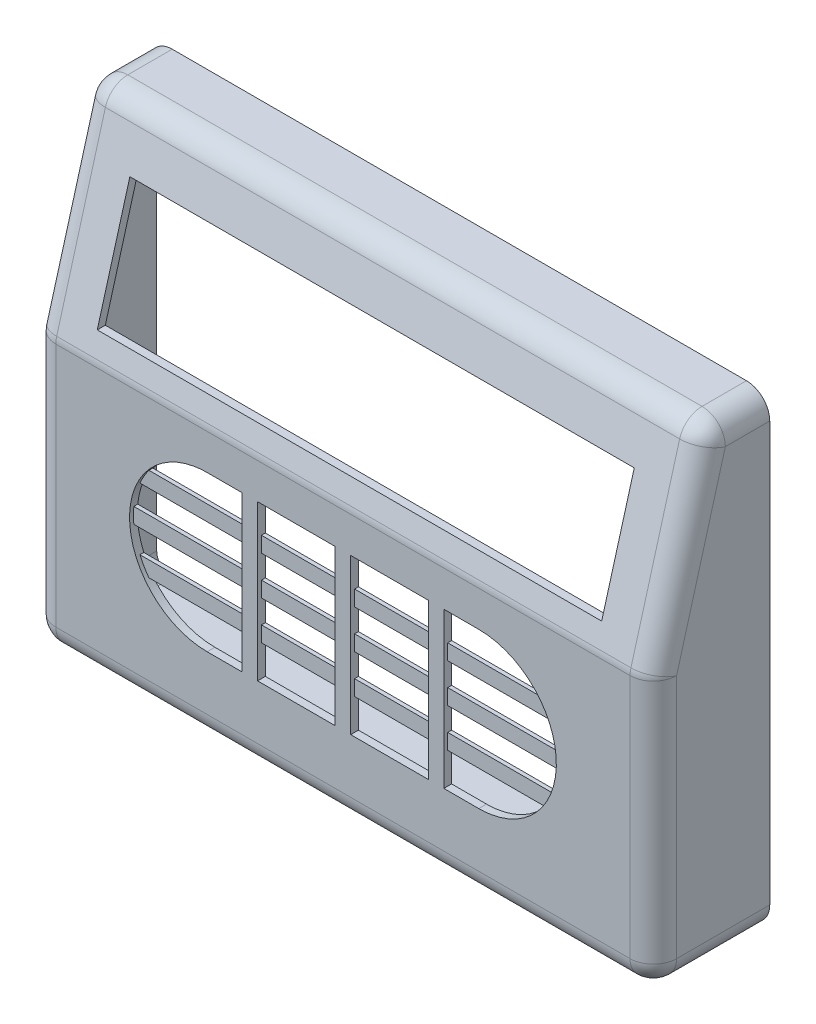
ISO-10303-21;
HEADER;
FILE_DESCRIPTION(('STEP AP214'),'2;1');
FILE_NAME('part.step','',(''),(''),'','','');
FILE_SCHEMA(('AUTOMOTIVE_DESIGN { 1 0 10303 214 1 1 1 1 }'));
ENDSEC;
DATA;
#1=APPLICATION_CONTEXT('core data for automotive mechanical design processes');
#2=APPLICATION_PROTOCOL_DEFINITION('international standard','automotive_design',2000,#1);
#3=PRODUCT_CONTEXT('',#1,'mechanical');
#4=PRODUCT('Part','Part','',(#3));
#5=PRODUCT_RELATED_PRODUCT_CATEGORY('part','',(#4));
#6=PRODUCT_DEFINITION_FORMATION('','',#4);
#7=PRODUCT_DEFINITION_CONTEXT('part definition',#1,'design');
#8=PRODUCT_DEFINITION('design','',#6,#7);
#9=PRODUCT_DEFINITION_SHAPE('','',#8);
#10=(LENGTH_UNIT() NAMED_UNIT(*) SI_UNIT(.MILLI.,.METRE.));
#11=(NAMED_UNIT(*) PLANE_ANGLE_UNIT() SI_UNIT($,.RADIAN.));
#12=(NAMED_UNIT(*) SI_UNIT($,.STERADIAN.) SOLID_ANGLE_UNIT());
#13=UNCERTAINTY_MEASURE_WITH_UNIT(LENGTH_MEASURE(1.E-05),#10,'distance_accuracy_value','');
#14=(GEOMETRIC_REPRESENTATION_CONTEXT(3) GLOBAL_UNCERTAINTY_ASSIGNED_CONTEXT((#13)) GLOBAL_UNIT_ASSIGNED_CONTEXT((#10,
#11,#12)) REPRESENTATION_CONTEXT('',''));
#15=CARTESIAN_POINT('',(0.,0.,0.));
#16=DIRECTION('',(0.,0.,1.));
#17=DIRECTION('',(1.,0.,0.));
#18=AXIS2_PLACEMENT_3D('',#15,#16,#17);
#19=CARTESIAN_POINT('',(40.,35.,15.));
#20=DIRECTION('',(0.,-0.269629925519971,-0.962964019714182));
#21=DIRECTION('',(0.,0.962964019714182,-0.269629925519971));
#22=AXIS2_PLACEMENT_3D('',#19,#20,#21);
#23=PLANE('',#22);
#24=DIRECTION('',(0.,-0.962964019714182,0.269629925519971));
#25=VECTOR('',#24,1.);
#26=CARTESIAN_POINT('',(-37.,35.,15.));
#27=LINE('',#26,#25);
#28=CARTESIAN_POINT('',(-37.,57.8088897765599,8.61351086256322));
#29=VERTEX_POINT('',#28);
#30=CARTESIAN_POINT('',(-37.,35.3968140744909,14.8888920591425));
#31=VERTEX_POINT('',#30);
#32=EDGE_CURVE('E2030',#29,#31,#27,.T.);
#33=ORIENTED_EDGE('',*,*,#32,.T.);
#34=DIRECTION('',(-1.,0.,0.));
#35=VECTOR('',#34,1.);
#36=CARTESIAN_POINT('',(40.,35.3968140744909,14.8888920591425));
#37=LINE('',#36,#35);
#38=CARTESIAN_POINT('',(37.,35.3968140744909,14.8888920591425));
#39=VERTEX_POINT('',#38);
#40=EDGE_CURVE('E2032',#31,#39,#37,.F.);
#41=ORIENTED_EDGE('',*,*,#40,.T.);
#42=DIRECTION('',(0.,-0.962964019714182,0.269629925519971));
#43=VECTOR('',#42,1.);
#44=CARTESIAN_POINT('',(37.,35.,15.));
#45=LINE('',#44,#43);
#46=CARTESIAN_POINT('',(37.,57.8088897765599,8.61351086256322));
#47=VERTEX_POINT('',#46);
#48=EDGE_CURVE('E2028',#39,#47,#45,.F.);
#49=ORIENTED_EDGE('',*,*,#48,.T.);
#50=DIRECTION('',(-1.,0.,0.));
#51=VECTOR('',#50,1.);
#52=CARTESIAN_POINT('',(40.,57.8088897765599,8.61351086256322));
#53=LINE('',#52,#51);
#54=EDGE_CURVE('E2026',#47,#29,#53,.T.);
#55=ORIENTED_EDGE('',*,*,#54,.T.);
#56=EDGE_LOOP('',(#33,#41,#49,#55));
#57=FACE_BOUND('',#56,.T.);
#58=DIRECTION('',(-1.,0.,0.));
#59=VECTOR('',#58,1.);
#60=CARTESIAN_POINT('',(0.,38.,14.1600000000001));
#61=LINE('',#60,#59);
#62=CARTESIAN_POINT('',(32.5,38.,14.1600000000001));
#63=VERTEX_POINT('',#62);
#64=CARTESIAN_POINT('',(-32.5,38.,14.1600000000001));
#65=VERTEX_POINT('',#64);
#66=EDGE_CURVE('E849',#63,#65,#61,.T.);
#67=ORIENTED_EDGE('',*,*,#66,.T.);
#68=DIRECTION('',(0.,0.962964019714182,-0.269629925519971));
#69=VECTOR('',#68,1.);
#70=CARTESIAN_POINT('',(-32.5,254.399109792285,-46.4317507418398));
#71=LINE('',#70,#69);
#72=CARTESIAN_POINT('',(-32.5,53.,9.96));
#73=VERTEX_POINT('',#72);
#74=EDGE_CURVE('E861',#65,#73,#71,.T.);
#75=ORIENTED_EDGE('',*,*,#74,.T.);
#76=DIRECTION('',(1.,0.,0.));
#77=VECTOR('',#76,1.);
#78=CARTESIAN_POINT('',(0.,53.,9.96000000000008));
#79=LINE('',#78,#77);
#80=CARTESIAN_POINT('',(32.5,53.,9.96000000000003));
#81=VERTEX_POINT('',#80);
#82=EDGE_CURVE('E281',#73,#81,#79,.T.);
#83=ORIENTED_EDGE('',*,*,#82,.T.);
#84=DIRECTION('',(0.,-0.962964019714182,0.269629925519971));
#85=VECTOR('',#84,1.);
#86=CARTESIAN_POINT('',(32.5,254.399109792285,-46.4317507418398));
#87=LINE('',#86,#85);
#88=EDGE_CURVE('E879',#81,#63,#87,.T.);
#89=ORIENTED_EDGE('',*,*,#88,.T.);
#90=EDGE_LOOP('',(#67,#75,#83,#89));
#91=FACE_BOUND('',#90,.T.);
#92=ADVANCED_FACE('F262',(#57,#91),#23,.F.);
#93=CARTESIAN_POINT('',(40.,34.73037007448,14.0370359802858));
#94=DIRECTION('',(0.,-0.269629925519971,-0.962964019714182));
#95=DIRECTION('',(0.,0.962964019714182,-0.269629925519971));
#96=AXIS2_PLACEMENT_3D('',#93,#94,#95);
#97=PLANE('',#96);
#98=DIRECTION('',(0.,0.962964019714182,-0.269629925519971));
#99=VECTOR('',#98,1.);
#100=CARTESIAN_POINT('',(-37.,34.73037007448,14.0370359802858));
#101=LINE('',#100,#99);
#102=CARTESIAN_POINT('',(-37.,57.5392598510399,7.65054684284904));
#103=VERTEX_POINT('',#102);
#104=CARTESIAN_POINT('',(-37.,35.1271841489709,13.9259280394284));
#105=VERTEX_POINT('',#104);
#106=EDGE_CURVE('E2216',#103,#105,#101,.F.);
#107=ORIENTED_EDGE('',*,*,#106,.F.);
#108=DIRECTION('',(1.,0.,0.));
#109=VECTOR('',#108,1.);
#110=CARTESIAN_POINT('',(40.,57.5392598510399,7.65054684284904));
#111=LINE('',#110,#109);
#112=CARTESIAN_POINT('',(37.,57.5392598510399,7.65054684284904));
#113=VERTEX_POINT('',#112);
#114=EDGE_CURVE('E2209',#113,#103,#111,.F.);
#115=ORIENTED_EDGE('',*,*,#114,.F.);
#116=DIRECTION('',(0.,0.962964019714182,-0.269629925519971));
#117=VECTOR('',#116,1.);
#118=CARTESIAN_POINT('',(37.,34.73037007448,14.0370359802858));
#119=LINE('',#118,#117);
#120=CARTESIAN_POINT('',(37.,35.1271841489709,13.9259280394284));
#121=VERTEX_POINT('',#120);
#122=EDGE_CURVE('E2210',#121,#113,#119,.T.);
#123=ORIENTED_EDGE('',*,*,#122,.F.);
#124=DIRECTION('',(1.,0.,0.));
#125=VECTOR('',#124,1.);
#126=CARTESIAN_POINT('',(40.,35.1271841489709,13.9259280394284));
#127=LINE('',#126,#125);
#128=EDGE_CURVE('E2306',#105,#121,#127,.T.);
#129=ORIENTED_EDGE('',*,*,#128,.F.);
#130=EDGE_LOOP('',(#107,#115,#123,#129));
#131=FACE_BOUND('',#130,.T.);
#132=DIRECTION('',(0.,0.962964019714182,-0.269629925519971));
#133=VECTOR('',#132,1.);
#134=CARTESIAN_POINT('',(-32.5,254.129479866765,-47.394714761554));
#135=LINE('',#134,#133);
#136=CARTESIAN_POINT('',(-32.5,38.,13.1215396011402));
#137=VERTEX_POINT('',#136);
#138=CARTESIAN_POINT('',(-32.5,53.,8.92153960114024));
#139=VERTEX_POINT('',#138);
#140=EDGE_CURVE('E866',#137,#139,#135,.T.);
#141=ORIENTED_EDGE('',*,*,#140,.F.);
#142=DIRECTION('',(-1.,0.,0.));
#143=VECTOR('',#142,1.);
#144=CARTESIAN_POINT('',(0.,38.,13.1215396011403));
#145=LINE('',#144,#143);
#146=CARTESIAN_POINT('',(32.5,38.,13.1215396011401));
#147=VERTEX_POINT('',#146);
#148=EDGE_CURVE('E289',#147,#137,#145,.T.);
#149=ORIENTED_EDGE('',*,*,#148,.F.);
#150=DIRECTION('',(0.,-0.962964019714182,0.269629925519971));
#151=VECTOR('',#150,1.);
#152=CARTESIAN_POINT('',(32.5,254.129479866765,-47.394714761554));
#153=LINE('',#152,#151);
#154=CARTESIAN_POINT('',(32.5,53.,8.92153960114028));
#155=VERTEX_POINT('',#154);
#156=EDGE_CURVE('E855',#155,#147,#153,.T.);
#157=ORIENTED_EDGE('',*,*,#156,.F.);
#158=DIRECTION('',(1.,0.,0.));
#159=VECTOR('',#158,1.);
#160=CARTESIAN_POINT('',(0.,53.,8.92153960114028));
#161=LINE('',#160,#159);
#162=EDGE_CURVE('E868',#139,#155,#161,.T.);
#163=ORIENTED_EDGE('',*,*,#162,.F.);
#164=EDGE_LOOP('',(#141,#149,#157,#163));
#165=FACE_BOUND('',#164,.T.);
#166=ADVANCED_FACE('F864',(#131,#165),#97,.T.);
#167=CARTESIAN_POINT('',(0.,10.,-955.));
#168=DIRECTION('',(0.,-1.,0.));
#169=DIRECTION('',(0.,0.,-1.));
#170=AXIS2_PLACEMENT_3D('',#167,#168,#169);
#171=PLANE('',#170);
#172=DIRECTION('',(1.,0.,0.));
#173=VECTOR('',#172,1.);
#174=CARTESIAN_POINT('',(0.,10.,14.));
#175=LINE('',#174,#173);
#176=CARTESIAN_POINT('',(-11.,10.,14.));
#177=VERTEX_POINT('',#176);
#178=CARTESIAN_POINT('',(-1.,10.,14.));
#179=VERTEX_POINT('',#178);
#180=EDGE_CURVE('E1485',#177,#179,#175,.T.);
#181=ORIENTED_EDGE('',*,*,#180,.F.);
#182=DIRECTION('',(0.,0.,-1.));
#183=VECTOR('',#182,1.);
#184=CARTESIAN_POINT('',(-11.,10.,-955.));
#185=LINE('',#184,#183);
#186=CARTESIAN_POINT('',(-11.,10.,15.));
#187=VERTEX_POINT('',#186);
#188=EDGE_CURVE('E1230',#177,#187,#185,.F.);
#189=ORIENTED_EDGE('',*,*,#188,.T.);
#190=DIRECTION('',(1.,0.,0.));
#191=VECTOR('',#190,1.);
#192=CARTESIAN_POINT('',(0.,10.,15.));
#193=LINE('',#192,#191);
#194=CARTESIAN_POINT('',(-1.,10.,15.));
#195=VERTEX_POINT('',#194);
#196=EDGE_CURVE('E2251',#187,#195,#193,.T.);
#197=ORIENTED_EDGE('',*,*,#196,.T.);
#198=DIRECTION('',(0.,0.,1.));
#199=VECTOR('',#198,1.);
#200=CARTESIAN_POINT('',(-1.,10.,-965.));
#201=LINE('',#200,#199);
#202=EDGE_CURVE('E1261',#179,#195,#201,.T.);
#203=ORIENTED_EDGE('',*,*,#202,.F.);
#204=EDGE_LOOP('',(#181,#189,#197,#203));
#205=FACE_BOUND('',#204,.T.);
#206=ADVANCED_FACE('F1827',(#205),#171,.F.);
#207=CARTESIAN_POINT('',(0.,30.,-955.));
#208=DIRECTION('',(0.,1.,0.));
#209=DIRECTION('',(0.,0.,1.));
#210=AXIS2_PLACEMENT_3D('',#207,#208,#209);
#211=PLANE('',#210);
#212=DIRECTION('',(-1.,0.,0.));
#213=VECTOR('',#212,1.);
#214=CARTESIAN_POINT('',(0.,30.,15.));
#215=LINE('',#214,#213);
#216=CARTESIAN_POINT('',(-1.,30.,15.));
#217=VERTEX_POINT('',#216);
#218=CARTESIAN_POINT('',(-11.,30.,15.));
#219=VERTEX_POINT('',#218);
#220=EDGE_CURVE('E1507',#217,#219,#215,.T.);
#221=ORIENTED_EDGE('',*,*,#220,.T.);
#222=DIRECTION('',(0.,0.,1.));
#223=VECTOR('',#222,1.);
#224=CARTESIAN_POINT('',(-11.,30.,-965.));
#225=LINE('',#224,#223);
#226=CARTESIAN_POINT('',(-11.,30.,14.));
#227=VERTEX_POINT('',#226);
#228=EDGE_CURVE('E1239',#227,#219,#225,.T.);
#229=ORIENTED_EDGE('',*,*,#228,.F.);
#230=DIRECTION('',(-1.,0.,0.));
#231=VECTOR('',#230,1.);
#232=CARTESIAN_POINT('',(0.,30.,14.));
#233=LINE('',#232,#231);
#234=CARTESIAN_POINT('',(-1.,30.,14.));
#235=VERTEX_POINT('',#234);
#236=EDGE_CURVE('E1502',#235,#227,#233,.T.);
#237=ORIENTED_EDGE('',*,*,#236,.F.);
#238=DIRECTION('',(0.,0.,1.));
#239=VECTOR('',#238,1.);
#240=CARTESIAN_POINT('',(-1.,30.,-965.));
#241=LINE('',#240,#239);
#242=EDGE_CURVE('E1257',#235,#217,#241,.T.);
#243=ORIENTED_EDGE('',*,*,#242,.T.);
#244=EDGE_LOOP('',(#221,#229,#237,#243));
#245=FACE_BOUND('',#244,.T.);
#246=ADVANCED_FACE('F2271',(#245),#211,.F.);
#247=CARTESIAN_POINT('',(1.,10.,14.));
#248=VERTEX_POINT('',#247);
#249=CARTESIAN_POINT('',(11.,10.,14.));
#250=VERTEX_POINT('',#249);
#251=EDGE_CURVE('E1477',#248,#250,#175,.T.);
#252=ORIENTED_EDGE('',*,*,#251,.F.);
#253=DIRECTION('',(0.,0.,-1.));
#254=VECTOR('',#253,1.);
#255=CARTESIAN_POINT('',(1.,10.,-955.));
#256=LINE('',#255,#254);
#257=CARTESIAN_POINT('',(1.,10.,15.));
#258=VERTEX_POINT('',#257);
#259=EDGE_CURVE('E1233',#248,#258,#256,.F.);
#260=ORIENTED_EDGE('',*,*,#259,.T.);
#261=CARTESIAN_POINT('',(11.,10.,15.));
#262=VERTEX_POINT('',#261);
#263=EDGE_CURVE('E1553',#258,#262,#193,.T.);
#264=ORIENTED_EDGE('',*,*,#263,.T.);
#265=DIRECTION('',(0.,0.,1.));
#266=VECTOR('',#265,1.);
#267=CARTESIAN_POINT('',(11.,10.,-965.));
#268=LINE('',#267,#266);
#269=EDGE_CURVE('E1282',#250,#262,#268,.T.);
#270=ORIENTED_EDGE('',*,*,#269,.F.);
#271=EDGE_LOOP('',(#252,#260,#264,#270));
#272=FACE_BOUND('',#271,.T.);
#273=ADVANCED_FACE('F2491',(#272),#171,.F.);
#274=CARTESIAN_POINT('',(11.,30.,15.));
#275=VERTEX_POINT('',#274);
#276=CARTESIAN_POINT('',(1.,30.,15.));
#277=VERTEX_POINT('',#276);
#278=EDGE_CURVE('E1511',#275,#277,#215,.T.);
#279=ORIENTED_EDGE('',*,*,#278,.T.);
#280=DIRECTION('',(0.,0.,1.));
#281=VECTOR('',#280,1.);
#282=CARTESIAN_POINT('',(1.,30.,-965.));
#283=LINE('',#282,#281);
#284=CARTESIAN_POINT('',(1.,30.,14.));
#285=VERTEX_POINT('',#284);
#286=EDGE_CURVE('E1260',#285,#277,#283,.T.);
#287=ORIENTED_EDGE('',*,*,#286,.F.);
#288=CARTESIAN_POINT('',(11.,30.,14.));
#289=VERTEX_POINT('',#288);
#290=EDGE_CURVE('E1505',#289,#285,#233,.T.);
#291=ORIENTED_EDGE('',*,*,#290,.F.);
#292=DIRECTION('',(0.,0.,1.));
#293=VECTOR('',#292,1.);
#294=CARTESIAN_POINT('',(11.,30.,-965.));
#295=LINE('',#294,#293);
#296=EDGE_CURVE('E1278',#289,#275,#295,.T.);
#297=ORIENTED_EDGE('',*,*,#296,.T.);
#298=EDGE_LOOP('',(#279,#287,#291,#297));
#299=FACE_BOUND('',#298,.T.);
#300=ADVANCED_FACE('F2495',(#299),#211,.F.);
#301=CARTESIAN_POINT('',(13.,10.,14.));
#302=VERTEX_POINT('',#301);
#303=CARTESIAN_POINT('',(17.5,10.,14.));
#304=VERTEX_POINT('',#303);
#305=EDGE_CURVE('E1486',#302,#304,#175,.T.);
#306=ORIENTED_EDGE('',*,*,#305,.F.);
#307=DIRECTION('',(0.,0.,-1.));
#308=VECTOR('',#307,1.);
#309=CARTESIAN_POINT('',(13.,10.,-955.));
#310=LINE('',#309,#308);
#311=CARTESIAN_POINT('',(13.,10.,15.));
#312=VERTEX_POINT('',#311);
#313=EDGE_CURVE('E1254',#302,#312,#310,.F.);
#314=ORIENTED_EDGE('',*,*,#313,.T.);
#315=CARTESIAN_POINT('',(17.5,10.,15.));
#316=VERTEX_POINT('',#315);
#317=EDGE_CURVE('E1495',#312,#316,#193,.T.);
#318=ORIENTED_EDGE('',*,*,#317,.T.);
#319=CARTESIAN_POINT('',(17.5,10.,14.));
#320=DIRECTION('',(0.,0.,1.));
#321=VECTOR('',#320,1.);
#322=LINE('',#319,#321);
#323=EDGE_CURVE('E1463',#304,#316,#322,.T.);
#324=ORIENTED_EDGE('',*,*,#323,.F.);
#325=EDGE_LOOP('',(#306,#314,#318,#324));
#326=FACE_BOUND('',#325,.T.);
#327=ADVANCED_FACE('F1568',(#326),#171,.F.);
#328=CARTESIAN_POINT('',(17.5,30.,15.));
#329=VERTEX_POINT('',#328);
#330=CARTESIAN_POINT('',(13.,30.,15.));
#331=VERTEX_POINT('',#330);
#332=EDGE_CURVE('E1526',#329,#331,#215,.T.);
#333=ORIENTED_EDGE('',*,*,#332,.T.);
#334=DIRECTION('',(0.,0.,1.));
#335=VECTOR('',#334,1.);
#336=CARTESIAN_POINT('',(13.,30.,-965.));
#337=LINE('',#336,#335);
#338=CARTESIAN_POINT('',(13.,30.,14.));
#339=VERTEX_POINT('',#338);
#340=EDGE_CURVE('E1281',#339,#331,#337,.T.);
#341=ORIENTED_EDGE('',*,*,#340,.F.);
#342=CARTESIAN_POINT('',(17.5,30.,14.));
#343=VERTEX_POINT('',#342);
#344=EDGE_CURVE('E1537',#343,#339,#233,.T.);
#345=ORIENTED_EDGE('',*,*,#344,.F.);
#346=CARTESIAN_POINT('',(17.5,30.,15.));
#347=DIRECTION('',(0.,0.,-1.));
#348=VECTOR('',#347,1.);
#349=LINE('',#346,#348);
#350=EDGE_CURVE('E1560',#343,#329,#349,.F.);
#351=ORIENTED_EDGE('',*,*,#350,.T.);
#352=EDGE_LOOP('',(#333,#341,#345,#351));
#353=FACE_BOUND('',#352,.T.);
#354=ADVANCED_FACE('F1558',(#353),#211,.F.);
#355=CARTESIAN_POINT('',(40.,60.,0.));
#356=DIRECTION('',(0.,0.,1.));
#357=DIRECTION('',(0.,-1.,0.));
#358=AXIS2_PLACEMENT_3D('',#355,#356,#357);
#359=PLANE('',#358);
#360=DIRECTION('',(0.,1.,0.));
#361=VECTOR('',#360,1.);
#362=CARTESIAN_POINT('',(-40.,60.,0.));
#363=LINE('',#362,#361);
#364=CARTESIAN_POINT('',(-40.,3.,0.));
#365=VERTEX_POINT('',#364);
#366=CARTESIAN_POINT('',(-40.,57.,0.));
#367=VERTEX_POINT('',#366);
#368=EDGE_CURVE('E1987',#365,#367,#363,.T.);
#369=ORIENTED_EDGE('',*,*,#368,.T.);
#370=CARTESIAN_POINT('',(-37.,57.,0.));
#371=DIRECTION('',(0.,0.,1.));
#372=DIRECTION('',(0.,-1.,0.));
#373=AXIS2_PLACEMENT_3D('',#370,#371,#372);
#374=CIRCLE('',#373,3.);
#375=CARTESIAN_POINT('',(-37.,60.,0.));
#376=VERTEX_POINT('',#375);
#377=EDGE_CURVE('E2024',#367,#376,#374,.F.);
#378=ORIENTED_EDGE('',*,*,#377,.T.);
#379=DIRECTION('',(-1.,0.,0.));
#380=VECTOR('',#379,1.);
#381=CARTESIAN_POINT('',(40.,60.,0.));
#382=LINE('',#381,#380);
#383=CARTESIAN_POINT('',(37.,60.,0.));
#384=VERTEX_POINT('',#383);
#385=EDGE_CURVE('E2000',#384,#376,#382,.T.);
#386=ORIENTED_EDGE('',*,*,#385,.F.);
#387=CARTESIAN_POINT('',(37.,57.,0.));
#388=DIRECTION('',(0.,0.,1.));
#389=DIRECTION('',(0.,-1.,0.));
#390=AXIS2_PLACEMENT_3D('',#387,#388,#389);
#391=CIRCLE('',#390,3.);
#392=CARTESIAN_POINT('',(40.,57.,0.));
#393=VERTEX_POINT('',#392);
#394=EDGE_CURVE('E2018',#384,#393,#391,.F.);
#395=ORIENTED_EDGE('',*,*,#394,.T.);
#396=DIRECTION('',(0.,1.,0.));
#397=VECTOR('',#396,1.);
#398=CARTESIAN_POINT('',(40.,60.,0.));
#399=LINE('',#398,#397);
#400=CARTESIAN_POINT('',(40.,3.,0.));
#401=VERTEX_POINT('',#400);
#402=EDGE_CURVE('E1989',#401,#393,#399,.T.);
#403=ORIENTED_EDGE('',*,*,#402,.F.);
#404=CARTESIAN_POINT('',(37.,3.,0.));
#405=DIRECTION('',(0.,0.,1.));
#406=DIRECTION('',(0.,-1.,0.));
#407=AXIS2_PLACEMENT_3D('',#404,#405,#406);
#408=CIRCLE('',#407,3.);
#409=CARTESIAN_POINT('',(37.,0.,0.));
#410=VERTEX_POINT('',#409);
#411=EDGE_CURVE('E2020',#401,#410,#408,.F.);
#412=ORIENTED_EDGE('',*,*,#411,.T.);
#413=DIRECTION('',(-1.,0.,0.));
#414=VECTOR('',#413,1.);
#415=CARTESIAN_POINT('',(40.,0.,0.));
#416=LINE('',#415,#414);
#417=CARTESIAN_POINT('',(-37.,0.,0.));
#418=VERTEX_POINT('',#417);
#419=EDGE_CURVE('E1994',#410,#418,#416,.T.);
#420=ORIENTED_EDGE('',*,*,#419,.T.);
#421=CARTESIAN_POINT('',(-37.,3.,0.));
#422=DIRECTION('',(0.,0.,1.));
#423=DIRECTION('',(0.,-1.,0.));
#424=AXIS2_PLACEMENT_3D('',#421,#422,#423);
#425=CIRCLE('',#424,3.);
#426=EDGE_CURVE('E2022',#418,#365,#425,.F.);
#427=ORIENTED_EDGE('',*,*,#426,.T.);
#428=EDGE_LOOP('',(#369,#378,#386,#395,#403,#412,#420,#427));
#429=FACE_BOUND('',#428,.T.);
#430=DIRECTION('',(0.,1.,0.));
#431=VECTOR('',#430,1.);
#432=CARTESIAN_POINT('',(-39.,0.,0.));
#433=LINE('',#432,#431);
#434=CARTESIAN_POINT('',(-39.,3.,0.));
#435=VERTEX_POINT('',#434);
#436=CARTESIAN_POINT('',(-39.,57.,0.));
#437=VERTEX_POINT('',#436);
#438=EDGE_CURVE('E2202',#435,#437,#433,.T.);
#439=ORIENTED_EDGE('',*,*,#438,.F.);
#440=CARTESIAN_POINT('',(-37.,3.,0.));
#441=DIRECTION('',(0.,0.,1.));
#442=DIRECTION('',(0.,-1.,0.));
#443=AXIS2_PLACEMENT_3D('',#440,#441,#442);
#444=CIRCLE('',#443,2.);
#445=CARTESIAN_POINT('',(-37.,1.,0.));
#446=VERTEX_POINT('',#445);
#447=EDGE_CURVE('E2196',#446,#435,#444,.F.);
#448=ORIENTED_EDGE('',*,*,#447,.F.);
#449=DIRECTION('',(-1.,0.,0.));
#450=VECTOR('',#449,1.);
#451=CARTESIAN_POINT('',(40.,1.,0.));
#452=LINE('',#451,#450);
#453=CARTESIAN_POINT('',(37.,1.,0.));
#454=VERTEX_POINT('',#453);
#455=EDGE_CURVE('E2184',#454,#446,#452,.T.);
#456=ORIENTED_EDGE('',*,*,#455,.F.);
#457=CARTESIAN_POINT('',(37.,3.,0.));
#458=DIRECTION('',(0.,0.,1.));
#459=DIRECTION('',(0.,-1.,0.));
#460=AXIS2_PLACEMENT_3D('',#457,#458,#459);
#461=CIRCLE('',#460,2.);
#462=CARTESIAN_POINT('',(39.,3.,0.));
#463=VERTEX_POINT('',#462);
#464=EDGE_CURVE('E2193',#463,#454,#461,.F.);
#465=ORIENTED_EDGE('',*,*,#464,.F.);
#466=DIRECTION('',(0.,1.,0.));
#467=VECTOR('',#466,1.);
#468=CARTESIAN_POINT('',(39.,0.,0.));
#469=LINE('',#468,#467);
#470=CARTESIAN_POINT('',(39.,57.,0.));
#471=VERTEX_POINT('',#470);
#472=EDGE_CURVE('E2191',#463,#471,#469,.T.);
#473=ORIENTED_EDGE('',*,*,#472,.T.);
#474=CARTESIAN_POINT('',(37.,57.,0.));
#475=DIRECTION('',(0.,0.,1.));
#476=DIRECTION('',(0.,-1.,0.));
#477=AXIS2_PLACEMENT_3D('',#474,#475,#476);
#478=CIRCLE('',#477,2.);
#479=CARTESIAN_POINT('',(37.,59.,0.));
#480=VERTEX_POINT('',#479);
#481=EDGE_CURVE('E2187',#480,#471,#478,.F.);
#482=ORIENTED_EDGE('',*,*,#481,.F.);
#483=DIRECTION('',(-1.,0.,0.));
#484=VECTOR('',#483,1.);
#485=CARTESIAN_POINT('',(40.,59.,0.));
#486=LINE('',#485,#484);
#487=CARTESIAN_POINT('',(-37.,59.,0.));
#488=VERTEX_POINT('',#487);
#489=EDGE_CURVE('E2177',#480,#488,#486,.T.);
#490=ORIENTED_EDGE('',*,*,#489,.T.);
#491=CARTESIAN_POINT('',(-37.,57.,0.));
#492=DIRECTION('',(0.,0.,1.));
#493=DIRECTION('',(0.,-1.,0.));
#494=AXIS2_PLACEMENT_3D('',#491,#492,#493);
#495=CIRCLE('',#494,2.);
#496=EDGE_CURVE('E2206',#437,#488,#495,.F.);
#497=ORIENTED_EDGE('',*,*,#496,.F.);
#498=EDGE_LOOP('',(#439,#448,#456,#465,#473,#482,#490,#497));
#499=FACE_BOUND('',#498,.T.);
#500=ADVANCED_FACE('F1838',(#429,#499),#359,.F.);
#501=CARTESIAN_POINT('',(40.,60.,8.));
#502=DIRECTION('',(0.,-1.,0.));
#503=DIRECTION('',(0.,0.,-1.));
#504=AXIS2_PLACEMENT_3D('',#501,#502,#503);
#505=PLANE('',#504);
#506=ORIENTED_EDGE('',*,*,#385,.T.);
#507=DIRECTION('',(0.,0.,1.));
#508=VECTOR('',#507,1.);
#509=CARTESIAN_POINT('',(-37.,60.,8.));
#510=LINE('',#509,#508);
#511=CARTESIAN_POINT('',(-37.,60.,5.72461880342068));
#512=VERTEX_POINT('',#511);
#513=EDGE_CURVE('E2007',#376,#512,#510,.T.);
#514=ORIENTED_EDGE('',*,*,#513,.T.);
#515=DIRECTION('',(-1.,0.,0.));
#516=VECTOR('',#515,1.);
#517=CARTESIAN_POINT('',(40.,60.,5.72461880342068));
#518=LINE('',#517,#516);
#519=CARTESIAN_POINT('',(37.,60.,5.72461880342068));
#520=VERTEX_POINT('',#519);
#521=EDGE_CURVE('E2005',#512,#520,#518,.F.);
#522=ORIENTED_EDGE('',*,*,#521,.T.);
#523=DIRECTION('',(0.,0.,1.));
#524=VECTOR('',#523,1.);
#525=CARTESIAN_POINT('',(37.,60.,8.));
#526=LINE('',#525,#524);
#527=EDGE_CURVE('E2003',#520,#384,#526,.F.);
#528=ORIENTED_EDGE('',*,*,#527,.T.);
#529=EDGE_LOOP('',(#506,#514,#522,#528));
#530=FACE_BOUND('',#529,.T.);
#531=ADVANCED_FACE('F1835',(#530),#505,.F.);
#532=CARTESIAN_POINT('',(40.,0.,15.));
#533=DIRECTION('',(0.,0.,-1.));
#534=DIRECTION('',(-1.,0.,0.));
#535=AXIS2_PLACEMENT_3D('',#532,#533,#534);
#536=PLANE('',#535);
#537=DIRECTION('',(0.,-1.,0.));
#538=VECTOR('',#537,1.);
#539=CARTESIAN_POINT('',(-13.,0.,15.));
#540=LINE('',#539,#538);
#541=CARTESIAN_POINT('',(-13.,30.,15.));
#542=VERTEX_POINT('',#541);
#543=CARTESIAN_POINT('',(-13.,10.,15.));
#544=VERTEX_POINT('',#543);
#545=EDGE_CURVE('E1243',#542,#544,#540,.T.);
#546=ORIENTED_EDGE('',*,*,#545,.T.);
#547=CARTESIAN_POINT('',(-17.5,10.,15.));
#548=VERTEX_POINT('',#547);
#549=EDGE_CURVE('E2248',#548,#544,#193,.T.);
#550=ORIENTED_EDGE('',*,*,#549,.F.);
#551=CARTESIAN_POINT('',(-17.5,9.99999999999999,15.));
#552=CARTESIAN_POINT('',(-18.4851812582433,10.0001083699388,15.));
#553=CARTESIAN_POINT('',(-19.4509032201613,10.1921471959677,15.));
#554=CARTESIAN_POINT('',(-20.4163635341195,10.3841339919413,15.));
#555=CARTESIAN_POINT('',(-21.3268343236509,10.7612046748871,15.));
#556=CARTESIAN_POINT('',(-22.2362888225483,11.1378544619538,15.));
#557=CARTESIAN_POINT('',(-23.055702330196,11.6853038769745,15.));
#558=CARTESIAN_POINT('',(-23.8742011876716,12.2321422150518,15.));
#559=CARTESIAN_POINT('',(-24.5710678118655,12.9289321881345,15.));
#560=CARTESIAN_POINT('',(-25.2671565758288,13.6249443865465,15.));
#561=CARTESIAN_POINT('',(-25.8146961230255,14.444297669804,15.));
#562=CARTESIAN_POINT('',(-26.361624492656,15.262736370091,15.));
#563=CARTESIAN_POINT('',(-26.7387953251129,16.1731656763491,15.));
#564=CARTESIAN_POINT('',(-27.1155451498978,17.0825787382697,15.));
#565=CARTESIAN_POINT('',(-27.3078528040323,18.0490967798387,15.));
#566=CARTESIAN_POINT('',(-27.4999457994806,19.0145359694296,15.));
#567=CARTESIAN_POINT('',(-27.5,20.,15.));
#568=CARTESIAN_POINT('',(-27.5000541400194,20.9843640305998,15.));
#569=CARTESIAN_POINT('',(-27.3078528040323,21.9509032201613,15.));
#570=CARTESIAN_POINT('',(-27.1158660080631,22.9163635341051,15.));
#571=CARTESIAN_POINT('',(-26.7387953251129,23.8268343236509,15.));
#572=CARTESIAN_POINT('',(-26.3621455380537,24.736288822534,15.));
#573=CARTESIAN_POINT('',(-25.8146961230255,25.555702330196,15.));
#574=CARTESIAN_POINT('',(-25.2678577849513,26.37420118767,15.));
#575=CARTESIAN_POINT('',(-24.5710678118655,27.0710678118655,15.));
#576=CARTESIAN_POINT('',(-23.8750556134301,27.7671565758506,15.));
#577=CARTESIAN_POINT('',(-23.055702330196,28.3146961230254,15.));
#578=CARTESIAN_POINT('',(-22.2372636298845,28.8616244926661,15.));
#579=CARTESIAN_POINT('',(-21.3268343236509,29.2387953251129,15.));
#580=CARTESIAN_POINT('',(-20.4174212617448,29.6155451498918,15.));
#581=CARTESIAN_POINT('',(-19.4509032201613,29.8078528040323,15.));
#582=CARTESIAN_POINT('',(-18.4857365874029,29.999891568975,15.));
#583=CARTESIAN_POINT('',(-17.5,30.,15.));
#584=B_SPLINE_CURVE_WITH_KNOTS('',2,(#551,#552,#553,#554,#555,#556,#557,#558,#559,#560,#561,
#562,#563,#564,#565,#566,#567,#568,#569,#570,#571,#572,#573,#574,#575,#576,#577,#578,#579,#580,
#581,#582,#583),.UNSPECIFIED.,.F.,.F.,(3,2,2,2,2,2,2,2,2,2,2,2,2,2,2,2,3),(0.,0.0625,0.125,
0.1875,0.25,0.3125,0.375,0.4375,0.5,0.5625,0.625,0.6875,0.75,0.8125,0.875,0.9375,1.),.UNSPECIFIED.);
#585=CARTESIAN_POINT('',(-17.5,30.,15.));
#586=VERTEX_POINT('',#585);
#587=EDGE_CURVE('E1550',#586,#548,#584,.F.);
#588=ORIENTED_EDGE('',*,*,#587,.F.);
#589=EDGE_CURVE('E1275',#542,#586,#215,.T.);
#590=ORIENTED_EDGE('',*,*,#589,.F.);
#591=EDGE_LOOP('',(#546,#550,#588,#590));
#592=FACE_BOUND('',#591,.T.);
#593=DIRECTION('',(0.,-1.,0.));
#594=VECTOR('',#593,1.);
#595=CARTESIAN_POINT('',(-1.,0.,15.));
#596=LINE('',#595,#594);
#597=EDGE_CURVE('E1264',#217,#195,#596,.T.);
#598=ORIENTED_EDGE('',*,*,#597,.T.);
#599=ORIENTED_EDGE('',*,*,#196,.F.);
#600=DIRECTION('',(0.,1.,0.));
#601=VECTOR('',#600,1.);
#602=CARTESIAN_POINT('',(-11.,0.,15.));
#603=LINE('',#602,#601);
#604=EDGE_CURVE('E1242',#187,#219,#603,.T.);
#605=ORIENTED_EDGE('',*,*,#604,.T.);
#606=ORIENTED_EDGE('',*,*,#220,.F.);
#607=EDGE_LOOP('',(#598,#599,#605,#606));
#608=FACE_BOUND('',#607,.T.);
#609=DIRECTION('',(0.,-1.,0.));
#610=VECTOR('',#609,1.);
#611=CARTESIAN_POINT('',(11.,0.,15.));
#612=LINE('',#611,#610);
#613=EDGE_CURVE('E1285',#275,#262,#612,.T.);
#614=ORIENTED_EDGE('',*,*,#613,.T.);
#615=ORIENTED_EDGE('',*,*,#263,.F.);
#616=DIRECTION('',(0.,1.,0.));
#617=VECTOR('',#616,1.);
#618=CARTESIAN_POINT('',(1.,0.,15.));
#619=LINE('',#618,#617);
#620=EDGE_CURVE('E1263',#258,#277,#619,.T.);
#621=ORIENTED_EDGE('',*,*,#620,.T.);
#622=ORIENTED_EDGE('',*,*,#278,.F.);
#623=EDGE_LOOP('',(#614,#615,#621,#622));
#624=FACE_BOUND('',#623,.T.);
#625=CARTESIAN_POINT('',(17.5,30.,15.));
#626=CARTESIAN_POINT('',(18.4851812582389,29.9998916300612,15.));
#627=CARTESIAN_POINT('',(19.4509032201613,29.8078528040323,15.));
#628=CARTESIAN_POINT('',(20.4163635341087,29.6158660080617,15.));
#629=CARTESIAN_POINT('',(21.3268343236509,29.2387953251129,15.));
#630=CARTESIAN_POINT('',(22.236288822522,28.8621455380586,15.));
#631=CARTESIAN_POINT('',(23.055702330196,28.3146961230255,15.));
#632=CARTESIAN_POINT('',(23.8742011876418,27.7678577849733,15.));
#633=CARTESIAN_POINT('',(24.5710678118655,27.0710678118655,15.));
#634=CARTESIAN_POINT('',(25.2671565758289,26.375055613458,15.));
#635=CARTESIAN_POINT('',(25.8146961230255,25.555702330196,15.));
#636=CARTESIAN_POINT('',(26.3616244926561,24.737263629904,15.));
#637=CARTESIAN_POINT('',(26.7387953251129,23.8268343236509,15.));
#638=CARTESIAN_POINT('',(27.1155451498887,22.9174212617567,15.));
#639=CARTESIAN_POINT('',(27.3078528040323,21.9509032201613,15.));
#640=CARTESIAN_POINT('',(27.4999457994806,20.9854640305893,15.));
#641=CARTESIAN_POINT('',(27.5,20.,15.));
#642=CARTESIAN_POINT('',(27.5000541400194,19.0156359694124,15.));
#643=CARTESIAN_POINT('',(27.3078528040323,18.0490967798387,15.));
#644=CARTESIAN_POINT('',(27.1158660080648,17.0836364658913,15.));
#645=CARTESIAN_POINT('',(26.7387953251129,16.1731656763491,15.));
#646=CARTESIAN_POINT('',(26.3621455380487,15.2637111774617,15.));
#647=CARTESIAN_POINT('',(25.8146961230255,14.444297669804,15.));
#648=CARTESIAN_POINT('',(25.2678577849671,13.6257988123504,15.));
#649=CARTESIAN_POINT('',(24.5710678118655,12.9289321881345,15.));
#650=CARTESIAN_POINT('',(23.8750556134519,12.2328434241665,15.));
#651=CARTESIAN_POINT('',(23.055702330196,11.6853038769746,15.));
#652=CARTESIAN_POINT('',(22.2372636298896,11.1383755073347,15.));
#653=CARTESIAN_POINT('',(21.3268343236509,10.7612046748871,15.));
#654=CARTESIAN_POINT('',(20.4174212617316,10.384454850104,15.));
#655=CARTESIAN_POINT('',(19.4509032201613,10.1921471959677,15.));
#656=CARTESIAN_POINT('',(18.4857365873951,10.000108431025,15.));
#657=CARTESIAN_POINT('',(17.5,10.,15.));
#658=B_SPLINE_CURVE_WITH_KNOTS('',2,(#625,#626,#627,#628,#629,#630,#631,#632,#633,#634,#635,
#636,#637,#638,#639,#640,#641,#642,#643,#644,#645,#646,#647,#648,#649,#650,#651,#652,#653,#654,
#655,#656,#657),.UNSPECIFIED.,.F.,.F.,(3,2,2,2,2,2,2,2,2,2,2,2,2,2,2,2,3),(0.,0.0625,0.125,
0.1875,0.25,0.3125,0.375,0.4375,0.5,0.5625,0.625,0.6875,0.75,0.8125,0.875,0.9375,1.),.UNSPECIFIED.);
#659=EDGE_CURVE('E1494',#316,#329,#658,.F.);
#660=ORIENTED_EDGE('',*,*,#659,.F.);
#661=ORIENTED_EDGE('',*,*,#317,.F.);
#662=DIRECTION('',(0.,1.,0.));
#663=VECTOR('',#662,1.);
#664=CARTESIAN_POINT('',(13.,0.,15.));
#665=LINE('',#664,#663);
#666=EDGE_CURVE('E1284',#312,#331,#665,.T.);
#667=ORIENTED_EDGE('',*,*,#666,.T.);
#668=ORIENTED_EDGE('',*,*,#332,.F.);
#669=EDGE_LOOP('',(#660,#661,#667,#668));
#670=FACE_BOUND('',#669,.T.);
#671=DIRECTION('',(0.,-1.,0.));
#672=VECTOR('',#671,1.);
#673=CARTESIAN_POINT('',(-37.,0.,15.));
#674=LINE('',#673,#672);
#675=CARTESIAN_POINT('',(-37.,34.587924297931,15.));
#676=VERTEX_POINT('',#675);
#677=CARTESIAN_POINT('',(-37.,3.,15.));
#678=VERTEX_POINT('',#677);
#679=EDGE_CURVE('E1936',#676,#678,#674,.T.);
#680=ORIENTED_EDGE('',*,*,#679,.T.);
#681=DIRECTION('',(-1.,0.,0.));
#682=VECTOR('',#681,1.);
#683=CARTESIAN_POINT('',(40.,3.,15.));
#684=LINE('',#683,#682);
#685=CARTESIAN_POINT('',(37.,3.,15.));
#686=VERTEX_POINT('',#685);
#687=EDGE_CURVE('E1932',#678,#686,#684,.F.);
#688=ORIENTED_EDGE('',*,*,#687,.T.);
#689=DIRECTION('',(0.,-1.,0.));
#690=VECTOR('',#689,1.);
#691=CARTESIAN_POINT('',(37.,0.,15.));
#692=LINE('',#691,#690);
#693=CARTESIAN_POINT('',(37.,34.587924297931,15.));
#694=VERTEX_POINT('',#693);
#695=EDGE_CURVE('E2036',#686,#694,#692,.F.);
#696=ORIENTED_EDGE('',*,*,#695,.T.);
#697=DIRECTION('',(-1.,0.,0.));
#698=VECTOR('',#697,1.);
#699=CARTESIAN_POINT('',(40.,34.587924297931,15.));
#700=LINE('',#699,#698);
#701=EDGE_CURVE('E2034',#694,#676,#700,.T.);
#702=ORIENTED_EDGE('',*,*,#701,.T.);
#703=EDGE_LOOP('',(#680,#688,#696,#702));
#704=FACE_BOUND('',#703,.T.);
#705=ADVANCED_FACE('F1562',(#592,#608,#624,#670,#704),#536,.F.);
#706=CARTESIAN_POINT('',(40.,0.,0.));
#707=DIRECTION('',(0.,1.,0.));
#708=DIRECTION('',(0.,0.,1.));
#709=AXIS2_PLACEMENT_3D('',#706,#707,#708);
#710=PLANE('',#709);
#711=DIRECTION('',(-1.,0.,0.));
#712=VECTOR('',#711,1.);
#713=CARTESIAN_POINT('',(40.,0.,12.));
#714=LINE('',#713,#712);
#715=CARTESIAN_POINT('',(37.,0.,12.));
#716=VERTEX_POINT('',#715);
#717=CARTESIAN_POINT('',(-37.,0.,12.));
#718=VERTEX_POINT('',#717);
#719=EDGE_CURVE('E1925',#716,#718,#714,.T.);
#720=ORIENTED_EDGE('',*,*,#719,.T.);
#721=DIRECTION('',(0.,0.,-1.));
#722=VECTOR('',#721,1.);
#723=CARTESIAN_POINT('',(-37.,0.,0.));
#724=LINE('',#723,#722);
#725=EDGE_CURVE('E1934',#718,#418,#724,.T.);
#726=ORIENTED_EDGE('',*,*,#725,.T.);
#727=ORIENTED_EDGE('',*,*,#419,.F.);
#728=DIRECTION('',(0.,0.,-1.));
#729=VECTOR('',#728,1.);
#730=CARTESIAN_POINT('',(37.,0.,0.));
#731=LINE('',#730,#729);
#732=EDGE_CURVE('E1931',#410,#716,#731,.F.);
#733=ORIENTED_EDGE('',*,*,#732,.T.);
#734=EDGE_LOOP('',(#720,#726,#727,#733));
#735=FACE_BOUND('',#734,.T.);
#736=ADVANCED_FACE('F2055',(#735),#710,.F.);
#737=CARTESIAN_POINT('',(40.,0.,0.));
#738=DIRECTION('',(-1.,0.,0.));
#739=DIRECTION('',(0.,0.,1.));
#740=AXIS2_PLACEMENT_3D('',#737,#738,#739);
#741=PLANE('',#740);
#742=DIRECTION('',(0.,-1.,0.));
#743=VECTOR('',#742,1.);
#744=CARTESIAN_POINT('',(40.,0.,12.));
#745=LINE('',#744,#743);
#746=CARTESIAN_POINT('',(40.,34.587924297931,12.));
#747=VERTEX_POINT('',#746);
#748=CARTESIAN_POINT('',(40.,3.,12.));
#749=VERTEX_POINT('',#748);
#750=EDGE_CURVE('E1945',#747,#749,#745,.T.);
#751=ORIENTED_EDGE('',*,*,#750,.T.);
#752=DIRECTION('',(0.,0.,-1.));
#753=VECTOR('',#752,1.);
#754=CARTESIAN_POINT('',(40.,3.,0.));
#755=LINE('',#754,#753);
#756=EDGE_CURVE('E1589',#749,#401,#755,.T.);
#757=ORIENTED_EDGE('',*,*,#756,.T.);
#758=ORIENTED_EDGE('',*,*,#402,.T.);
#759=DIRECTION('',(0.,0.,1.));
#760=VECTOR('',#759,1.);
#761=CARTESIAN_POINT('',(40.,57.,0.));
#762=LINE('',#761,#760);
#763=CARTESIAN_POINT('',(40.,57.,5.72461880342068));
#764=VERTEX_POINT('',#763);
#765=EDGE_CURVE('E1941',#393,#764,#762,.T.);
#766=ORIENTED_EDGE('',*,*,#765,.T.);
#767=DIRECTION('',(0.,-0.962964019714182,0.269629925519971));
#768=VECTOR('',#767,1.);
#769=CARTESIAN_POINT('',(40.,5.63027936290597,20.108140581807));
#770=LINE('',#769,#768);
#771=EDGE_CURVE('E1943',#764,#747,#770,.T.);
#772=ORIENTED_EDGE('',*,*,#771,.T.);
#773=EDGE_LOOP('',(#751,#757,#758,#766,#772));
#774=FACE_BOUND('',#773,.T.);
#775=ADVANCED_FACE('F2062',(#774),#741,.F.);
#776=CARTESIAN_POINT('',(-40.,0.,0.));
#777=DIRECTION('',(-1.,0.,0.));
#778=DIRECTION('',(0.,0.,1.));
#779=AXIS2_PLACEMENT_3D('',#776,#777,#778);
#780=PLANE('',#779);
#781=DIRECTION('',(0.,-0.962964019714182,0.269629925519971));
#782=VECTOR('',#781,1.);
#783=CARTESIAN_POINT('',(-40.,59.1911102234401,5.11110794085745));
#784=LINE('',#783,#782);
#785=CARTESIAN_POINT('',(-40.,34.587924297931,12.));
#786=VERTEX_POINT('',#785);
#787=CARTESIAN_POINT('',(-40.,57.,5.72461880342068));
#788=VERTEX_POINT('',#787);
#789=EDGE_CURVE('E2014',#786,#788,#784,.F.);
#790=ORIENTED_EDGE('',*,*,#789,.T.);
#791=DIRECTION('',(0.,0.,1.));
#792=VECTOR('',#791,1.);
#793=CARTESIAN_POINT('',(-40.,57.,0.));
#794=LINE('',#793,#792);
#795=EDGE_CURVE('E2016',#788,#367,#794,.F.);
#796=ORIENTED_EDGE('',*,*,#795,.T.);
#797=ORIENTED_EDGE('',*,*,#368,.F.);
#798=DIRECTION('',(0.,0.,-1.));
#799=VECTOR('',#798,1.);
#800=CARTESIAN_POINT('',(-40.,3.,15.));
#801=LINE('',#800,#799);
#802=CARTESIAN_POINT('',(-40.,3.,12.));
#803=VERTEX_POINT('',#802);
#804=EDGE_CURVE('E2010',#365,#803,#801,.F.);
#805=ORIENTED_EDGE('',*,*,#804,.T.);
#806=DIRECTION('',(0.,-1.,0.));
#807=VECTOR('',#806,1.);
#808=CARTESIAN_POINT('',(-40.,35.,12.));
#809=LINE('',#808,#807);
#810=EDGE_CURVE('E2012',#803,#786,#809,.F.);
#811=ORIENTED_EDGE('',*,*,#810,.T.);
#812=EDGE_LOOP('',(#790,#796,#797,#805,#811));
#813=FACE_BOUND('',#812,.T.);
#814=ADVANCED_FACE('F1909',(#813),#780,.T.);
#815=CARTESIAN_POINT('',(37.,3.,0.));
#816=DIRECTION('',(0.,0.,-1.));
#817=DIRECTION('',(0.,1.,0.));
#818=AXIS2_PLACEMENT_3D('',#815,#816,#817);
#819=CYLINDRICAL_SURFACE('',#818,3.);
#820=CARTESIAN_POINT('',(37.,3.,12.));
#821=DIRECTION('',(0.,0.,1.));
#822=DIRECTION('',(1.,0.,0.));
#823=AXIS2_PLACEMENT_3D('',#820,#821,#822);
#824=CIRCLE('',#823,3.);
#825=EDGE_CURVE('E1534',#716,#749,#824,.T.);
#826=ORIENTED_EDGE('',*,*,#825,.F.);
#827=ORIENTED_EDGE('',*,*,#732,.F.);
#828=ORIENTED_EDGE('',*,*,#411,.F.);
#829=ORIENTED_EDGE('',*,*,#756,.F.);
#830=EDGE_LOOP('',(#826,#827,#828,#829));
#831=FACE_BOUND('',#830,.T.);
#832=ADVANCED_FACE('F264',(#831),#819,.T.);
#833=CARTESIAN_POINT('',(37.,3.,12.));
#834=DIRECTION('',(0.,0.,1.));
#835=DIRECTION('',(1.,0.,0.));
#836=AXIS2_PLACEMENT_3D('',#833,#834,#835);
#837=SPHERICAL_SURFACE('',#836,3.);
#838=CARTESIAN_POINT('',(37.,3.,12.));
#839=DIRECTION('',(1.,0.,0.));
#840=DIRECTION('',(0.,0.,-1.));
#841=AXIS2_PLACEMENT_3D('',#838,#839,#840);
#842=CIRCLE('',#841,3.);
#843=EDGE_CURVE('E1915',#716,#686,#842,.F.);
#844=ORIENTED_EDGE('',*,*,#843,.F.);
#845=ORIENTED_EDGE('',*,*,#825,.T.);
#846=CARTESIAN_POINT('',(37.,3.,12.));
#847=DIRECTION('',(0.,-1.,0.));
#848=DIRECTION('',(0.,0.,-1.));
#849=AXIS2_PLACEMENT_3D('',#846,#847,#848);
#850=CIRCLE('',#849,3.);
#851=EDGE_CURVE('E1919',#686,#749,#850,.F.);
#852=ORIENTED_EDGE('',*,*,#851,.F.);
#853=EDGE_LOOP('',(#844,#845,#852));
#854=FACE_BOUND('',#853,.T.);
#855=ADVANCED_FACE('F1902',(#854),#837,.T.);
#856=CARTESIAN_POINT('',(37.,0.,12.));
#857=DIRECTION('',(0.,-1.,0.));
#858=DIRECTION('',(0.,0.,-1.));
#859=AXIS2_PLACEMENT_3D('',#856,#857,#858);
#860=CYLINDRICAL_SURFACE('',#859,3.);
#861=ORIENTED_EDGE('',*,*,#851,.T.);
#862=ORIENTED_EDGE('',*,*,#750,.F.);
#863=CARTESIAN_POINT('',(37.,34.587924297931,12.));
#864=DIRECTION('',(0.,1.,0.));
#865=DIRECTION('',(-1.,0.,0.));
#866=AXIS2_PLACEMENT_3D('',#863,#864,#865);
#867=CIRCLE('',#866,3.);
#868=EDGE_CURVE('E1922',#694,#747,#867,.T.);
#869=ORIENTED_EDGE('',*,*,#868,.F.);
#870=ORIENTED_EDGE('',*,*,#695,.F.);
#871=EDGE_LOOP('',(#861,#862,#869,#870));
#872=FACE_BOUND('',#871,.T.);
#873=ADVANCED_FACE('F1899',(#872),#860,.T.);
#874=CARTESIAN_POINT('',(40.,3.,12.));
#875=DIRECTION('',(-1.,0.,0.));
#876=DIRECTION('',(0.,0.,1.));
#877=AXIS2_PLACEMENT_3D('',#874,#875,#876);
#878=CYLINDRICAL_SURFACE('',#877,3.);
#879=ORIENTED_EDGE('',*,*,#843,.T.);
#880=ORIENTED_EDGE('',*,*,#687,.F.);
#881=CARTESIAN_POINT('',(-37.,3.,12.));
#882=DIRECTION('',(-1.,0.,0.));
#883=DIRECTION('',(0.,0.,1.));
#884=AXIS2_PLACEMENT_3D('',#881,#882,#883);
#885=CIRCLE('',#884,3.);
#886=EDGE_CURVE('E1927',#718,#678,#885,.T.);
#887=ORIENTED_EDGE('',*,*,#886,.F.);
#888=ORIENTED_EDGE('',*,*,#719,.F.);
#889=EDGE_LOOP('',(#879,#880,#887,#888));
#890=FACE_BOUND('',#889,.T.);
#891=ADVANCED_FACE('F1895',(#890),#878,.T.);
#892=CARTESIAN_POINT('',(-37.,3.,0.));
#893=DIRECTION('',(0.,0.,1.));
#894=DIRECTION('',(0.,-1.,0.));
#895=AXIS2_PLACEMENT_3D('',#892,#893,#894);
#896=CYLINDRICAL_SURFACE('',#895,3.);
#897=ORIENTED_EDGE('',*,*,#426,.F.);
#898=ORIENTED_EDGE('',*,*,#725,.F.);
#899=CARTESIAN_POINT('',(-37.,3.,12.));
#900=DIRECTION('',(0.,0.,1.));
#901=DIRECTION('',(1.,0.,0.));
#902=AXIS2_PLACEMENT_3D('',#899,#900,#901);
#903=CIRCLE('',#902,3.);
#904=EDGE_CURVE('E1982',#803,#718,#903,.T.);
#905=ORIENTED_EDGE('',*,*,#904,.F.);
#906=ORIENTED_EDGE('',*,*,#804,.F.);
#907=EDGE_LOOP('',(#897,#898,#905,#906));
#908=FACE_BOUND('',#907,.T.);
#909=ADVANCED_FACE('F1891',(#908),#896,.T.);
#910=CARTESIAN_POINT('',(37.,34.587924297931,12.));
#911=DIRECTION('',(0.,0.,1.));
#912=DIRECTION('',(1.,0.,0.));
#913=AXIS2_PLACEMENT_3D('',#910,#911,#912);
#914=SPHERICAL_SURFACE('',#913,3.);
#915=CARTESIAN_POINT('',(37.,34.587924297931,12.));
#916=DIRECTION('',(1.,0.,0.));
#917=DIRECTION('',(0.,0.,-1.));
#918=AXIS2_PLACEMENT_3D('',#915,#916,#917);
#919=CIRCLE('',#918,3.);
#920=EDGE_CURVE('E1976',#694,#39,#919,.F.);
#921=ORIENTED_EDGE('',*,*,#920,.F.);
#922=ORIENTED_EDGE('',*,*,#868,.T.);
#923=CARTESIAN_POINT('',(37.,34.587924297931,12.));
#924=DIRECTION('',(0.,-0.962964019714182,0.269629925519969));
#925=DIRECTION('',(0.,-0.269629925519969,-0.962964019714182));
#926=AXIS2_PLACEMENT_3D('',#923,#924,#925);
#927=CIRCLE('',#926,3.);
#928=EDGE_CURVE('E1979',#39,#747,#927,.F.);
#929=ORIENTED_EDGE('',*,*,#928,.F.);
#930=EDGE_LOOP('',(#921,#922,#929));
#931=FACE_BOUND('',#930,.T.);
#932=ADVANCED_FACE('F1887',(#931),#914,.T.);
#933=CARTESIAN_POINT('',(-37.,3.,12.));
#934=DIRECTION('',(0.,0.,1.));
#935=DIRECTION('',(1.,0.,0.));
#936=AXIS2_PLACEMENT_3D('',#933,#934,#935);
#937=SPHERICAL_SURFACE('',#936,3.);
#938=ORIENTED_EDGE('',*,*,#904,.T.);
#939=ORIENTED_EDGE('',*,*,#886,.T.);
#940=CARTESIAN_POINT('',(-37.,3.,12.));
#941=DIRECTION('',(0.,-1.,0.));
#942=DIRECTION('',(0.,0.,-1.));
#943=AXIS2_PLACEMENT_3D('',#940,#941,#942);
#944=CIRCLE('',#943,3.);
#945=EDGE_CURVE('E1974',#803,#678,#944,.F.);
#946=ORIENTED_EDGE('',*,*,#945,.F.);
#947=EDGE_LOOP('',(#938,#939,#946));
#948=FACE_BOUND('',#947,.T.);
#949=ADVANCED_FACE('F1883',(#948),#937,.T.);
#950=CARTESIAN_POINT('',(37.,57.,0.));
#951=DIRECTION('',(0.,0.,1.));
#952=DIRECTION('',(1.,0.,0.));
#953=AXIS2_PLACEMENT_3D('',#950,#951,#952);
#954=CYLINDRICAL_SURFACE('',#953,3.);
#955=ORIENTED_EDGE('',*,*,#394,.F.);
#956=ORIENTED_EDGE('',*,*,#527,.F.);
#957=CARTESIAN_POINT('',(37.,57.,5.72461880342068));
#958=DIRECTION('',(0.,0.,1.));
#959=DIRECTION('',(1.,0.,0.));
#960=AXIS2_PLACEMENT_3D('',#957,#958,#959);
#961=CIRCLE('',#960,3.);
#962=EDGE_CURVE('E1971',#764,#520,#961,.T.);
#963=ORIENTED_EDGE('',*,*,#962,.F.);
#964=ORIENTED_EDGE('',*,*,#765,.F.);
#965=EDGE_LOOP('',(#955,#956,#963,#964));
#966=FACE_BOUND('',#965,.T.);
#967=ADVANCED_FACE('F1879',(#966),#954,.T.);
#968=CARTESIAN_POINT('',(37.,5.63027936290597,20.108140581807));
#969=DIRECTION('',(0.,-0.962964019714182,0.269629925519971));
#970=DIRECTION('',(0.,-0.269629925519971,-0.962964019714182));
#971=AXIS2_PLACEMENT_3D('',#968,#969,#970);
#972=CYLINDRICAL_SURFACE('',#971,3.);
#973=ORIENTED_EDGE('',*,*,#928,.T.);
#974=ORIENTED_EDGE('',*,*,#771,.F.);
#975=CARTESIAN_POINT('',(37.,57.,5.72461880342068));
#976=DIRECTION('',(0.,0.962964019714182,-0.269629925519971));
#977=DIRECTION('',(0.,0.269629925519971,0.962964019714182));
#978=AXIS2_PLACEMENT_3D('',#975,#976,#977);
#979=CIRCLE('',#978,3.);
#980=EDGE_CURVE('E1968',#47,#764,#979,.T.);
#981=ORIENTED_EDGE('',*,*,#980,.F.);
#982=ORIENTED_EDGE('',*,*,#48,.F.);
#983=EDGE_LOOP('',(#973,#974,#981,#982));
#984=FACE_BOUND('',#983,.T.);
#985=ADVANCED_FACE('F1875',(#984),#972,.T.);
#986=CARTESIAN_POINT('',(40.,34.587924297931,12.));
#987=DIRECTION('',(-1.,0.,0.));
#988=DIRECTION('',(0.,0.,1.));
#989=AXIS2_PLACEMENT_3D('',#986,#987,#988);
#990=CYLINDRICAL_SURFACE('',#989,3.);
#991=ORIENTED_EDGE('',*,*,#920,.T.);
#992=ORIENTED_EDGE('',*,*,#40,.F.);
#993=CARTESIAN_POINT('',(-37.,34.587924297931,12.));
#994=DIRECTION('',(-1.,0.,0.));
#995=DIRECTION('',(0.,0.,1.));
#996=AXIS2_PLACEMENT_3D('',#993,#994,#995);
#997=CIRCLE('',#996,3.);
#998=EDGE_CURVE('E1965',#676,#31,#997,.T.);
#999=ORIENTED_EDGE('',*,*,#998,.F.);
#1000=ORIENTED_EDGE('',*,*,#701,.F.);
#1001=EDGE_LOOP('',(#991,#992,#999,#1000));
#1002=FACE_BOUND('',#1001,.T.);
#1003=ADVANCED_FACE('F1871',(#1002),#990,.T.);
#1004=CARTESIAN_POINT('',(-37.,0.,12.));
#1005=DIRECTION('',(0.,1.,0.));
#1006=DIRECTION('',(0.,0.,1.));
#1007=AXIS2_PLACEMENT_3D('',#1004,#1005,#1006);
#1008=CYLINDRICAL_SURFACE('',#1007,3.);
#1009=ORIENTED_EDGE('',*,*,#945,.T.);
#1010=ORIENTED_EDGE('',*,*,#679,.F.);
#1011=CARTESIAN_POINT('',(-37.,34.587924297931,12.));
#1012=DIRECTION('',(0.,1.,0.));
#1013=DIRECTION('',(0.,0.,1.));
#1014=AXIS2_PLACEMENT_3D('',#1011,#1012,#1013);
#1015=CIRCLE('',#1014,3.);
#1016=EDGE_CURVE('E1962',#786,#676,#1015,.T.);
#1017=ORIENTED_EDGE('',*,*,#1016,.F.);
#1018=ORIENTED_EDGE('',*,*,#810,.F.);
#1019=EDGE_LOOP('',(#1009,#1010,#1017,#1018));
#1020=FACE_BOUND('',#1019,.T.);
#1021=ADVANCED_FACE('F1867',(#1020),#1008,.T.);
#1022=CARTESIAN_POINT('',(37.,57.,5.72461880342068));
#1023=DIRECTION('',(0.,0.,1.));
#1024=DIRECTION('',(1.,0.,0.));
#1025=AXIS2_PLACEMENT_3D('',#1022,#1023,#1024);
#1026=SPHERICAL_SURFACE('',#1025,3.);
#1027=ORIENTED_EDGE('',*,*,#980,.T.);
#1028=ORIENTED_EDGE('',*,*,#962,.T.);
#1029=CARTESIAN_POINT('',(37.,57.,5.72461880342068));
#1030=DIRECTION('',(1.,0.,0.));
#1031=DIRECTION('',(0.,0.,-1.));
#1032=AXIS2_PLACEMENT_3D('',#1029,#1030,#1031);
#1033=CIRCLE('',#1032,3.);
#1034=EDGE_CURVE('E1959',#47,#520,#1033,.F.);
#1035=ORIENTED_EDGE('',*,*,#1034,.F.);
#1036=EDGE_LOOP('',(#1027,#1028,#1035));
#1037=FACE_BOUND('',#1036,.T.);
#1038=ADVANCED_FACE('F1863',(#1037),#1026,.T.);
#1039=CARTESIAN_POINT('',(-37.,34.587924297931,12.));
#1040=DIRECTION('',(0.,0.,1.));
#1041=DIRECTION('',(1.,0.,0.));
#1042=AXIS2_PLACEMENT_3D('',#1039,#1040,#1041);
#1043=SPHERICAL_SURFACE('',#1042,3.);
#1044=ORIENTED_EDGE('',*,*,#1016,.T.);
#1045=ORIENTED_EDGE('',*,*,#998,.T.);
#1046=CARTESIAN_POINT('',(-37.,34.587924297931,12.));
#1047=DIRECTION('',(0.,-0.962964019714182,0.269629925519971));
#1048=DIRECTION('',(0.,-0.269629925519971,-0.962964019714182));
#1049=AXIS2_PLACEMENT_3D('',#1046,#1047,#1048);
#1050=CIRCLE('',#1049,3.);
#1051=EDGE_CURVE('E1957',#786,#31,#1050,.F.);
#1052=ORIENTED_EDGE('',*,*,#1051,.F.);
#1053=EDGE_LOOP('',(#1044,#1045,#1052));
#1054=FACE_BOUND('',#1053,.T.);
#1055=ADVANCED_FACE('F1859',(#1054),#1043,.T.);
#1056=CARTESIAN_POINT('',(40.,57.,5.72461880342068));
#1057=DIRECTION('',(-1.,0.,0.));
#1058=DIRECTION('',(0.,0.,1.));
#1059=AXIS2_PLACEMENT_3D('',#1056,#1057,#1058);
#1060=CYLINDRICAL_SURFACE('',#1059,3.);
#1061=ORIENTED_EDGE('',*,*,#1034,.T.);
#1062=ORIENTED_EDGE('',*,*,#521,.F.);
#1063=CARTESIAN_POINT('',(-37.,57.,5.72461880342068));
#1064=DIRECTION('',(-1.,0.,0.));
#1065=DIRECTION('',(0.,0.,1.));
#1066=AXIS2_PLACEMENT_3D('',#1063,#1064,#1065);
#1067=CIRCLE('',#1066,3.);
#1068=EDGE_CURVE('E1954',#29,#512,#1067,.T.);
#1069=ORIENTED_EDGE('',*,*,#1068,.F.);
#1070=ORIENTED_EDGE('',*,*,#54,.F.);
#1071=EDGE_LOOP('',(#1061,#1062,#1069,#1070));
#1072=FACE_BOUND('',#1071,.T.);
#1073=ADVANCED_FACE('F1855',(#1072),#1060,.T.);
#1074=CARTESIAN_POINT('',(-37.,34.1911102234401,12.1111079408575));
#1075=DIRECTION('',(0.,0.962964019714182,-0.269629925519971));
#1076=DIRECTION('',(0.,0.269629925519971,0.962964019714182));
#1077=AXIS2_PLACEMENT_3D('',#1074,#1075,#1076);
#1078=CYLINDRICAL_SURFACE('',#1077,3.);
#1079=ORIENTED_EDGE('',*,*,#1051,.T.);
#1080=ORIENTED_EDGE('',*,*,#32,.F.);
#1081=CARTESIAN_POINT('',(-37.,57.,5.72461880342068));
#1082=DIRECTION('',(0.,0.962964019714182,-0.269629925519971));
#1083=DIRECTION('',(0.,0.269629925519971,0.962964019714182));
#1084=AXIS2_PLACEMENT_3D('',#1081,#1082,#1083);
#1085=CIRCLE('',#1084,3.);
#1086=EDGE_CURVE('E1950',#788,#29,#1085,.T.);
#1087=ORIENTED_EDGE('',*,*,#1086,.F.);
#1088=ORIENTED_EDGE('',*,*,#789,.F.);
#1089=EDGE_LOOP('',(#1079,#1080,#1087,#1088));
#1090=FACE_BOUND('',#1089,.T.);
#1091=ADVANCED_FACE('F1851',(#1090),#1078,.T.);
#1092=CARTESIAN_POINT('',(-37.,57.,5.72461880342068));
#1093=DIRECTION('',(0.,0.,1.));
#1094=DIRECTION('',(1.,0.,0.));
#1095=AXIS2_PLACEMENT_3D('',#1092,#1093,#1094);
#1096=SPHERICAL_SURFACE('',#1095,3.);
#1097=ORIENTED_EDGE('',*,*,#1086,.T.);
#1098=ORIENTED_EDGE('',*,*,#1068,.T.);
#1099=CARTESIAN_POINT('',(-37.,57.,5.72461880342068));
#1100=DIRECTION('',(0.,0.,1.));
#1101=DIRECTION('',(1.,0.,0.));
#1102=AXIS2_PLACEMENT_3D('',#1099,#1100,#1101);
#1103=CIRCLE('',#1102,3.);
#1104=EDGE_CURVE('E1948',#788,#512,#1103,.F.);
#1105=ORIENTED_EDGE('',*,*,#1104,.F.);
#1106=EDGE_LOOP('',(#1097,#1098,#1105));
#1107=FACE_BOUND('',#1106,.T.);
#1108=ADVANCED_FACE('F1847',(#1107),#1096,.T.);
#1109=CARTESIAN_POINT('',(-37.,57.,8.));
#1110=DIRECTION('',(0.,0.,-1.));
#1111=DIRECTION('',(-1.,0.,0.));
#1112=AXIS2_PLACEMENT_3D('',#1109,#1110,#1111);
#1113=CYLINDRICAL_SURFACE('',#1112,3.);
#1114=ORIENTED_EDGE('',*,*,#377,.F.);
#1115=ORIENTED_EDGE('',*,*,#795,.F.);
#1116=ORIENTED_EDGE('',*,*,#1104,.T.);
#1117=ORIENTED_EDGE('',*,*,#513,.F.);
#1118=EDGE_LOOP('',(#1114,#1115,#1116,#1117));
#1119=FACE_BOUND('',#1118,.T.);
#1120=ADVANCED_FACE('F1843',(#1119),#1113,.T.);
#1121=CARTESIAN_POINT('',(40.,59.,8.));
#1122=DIRECTION('',(0.,-1.,0.));
#1123=DIRECTION('',(0.,0.,-1.));
#1124=AXIS2_PLACEMENT_3D('',#1121,#1122,#1123);
#1125=PLANE('',#1124);
#1126=ORIENTED_EDGE('',*,*,#489,.F.);
#1127=DIRECTION('',(0.,0.,-1.));
#1128=VECTOR('',#1127,1.);
#1129=CARTESIAN_POINT('',(37.,59.,8.));
#1130=LINE('',#1129,#1128);
#1131=CARTESIAN_POINT('',(37.,59.,5.72461880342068));
#1132=VERTEX_POINT('',#1131);
#1133=EDGE_CURVE('E2180',#1132,#480,#1130,.T.);
#1134=ORIENTED_EDGE('',*,*,#1133,.F.);
#1135=DIRECTION('',(1.,0.,0.));
#1136=VECTOR('',#1135,1.);
#1137=CARTESIAN_POINT('',(40.,59.,5.72461880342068));
#1138=LINE('',#1137,#1136);
#1139=CARTESIAN_POINT('',(-37.,59.,5.72461880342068));
#1140=VERTEX_POINT('',#1139);
#1141=EDGE_CURVE('E2311',#1140,#1132,#1138,.T.);
#1142=ORIENTED_EDGE('',*,*,#1141,.F.);
#1143=DIRECTION('',(0.,0.,-1.));
#1144=VECTOR('',#1143,1.);
#1145=CARTESIAN_POINT('',(-37.,59.,8.));
#1146=LINE('',#1145,#1144);
#1147=EDGE_CURVE('E1397',#488,#1140,#1146,.F.);
#1148=ORIENTED_EDGE('',*,*,#1147,.F.);
#1149=EDGE_LOOP('',(#1126,#1134,#1142,#1148));
#1150=FACE_BOUND('',#1149,.T.);
#1151=ADVANCED_FACE('F1846',(#1150),#1125,.T.);
#1152=CARTESIAN_POINT('',(40.,0.,14.));
#1153=DIRECTION('',(0.,0.,-1.));
#1154=DIRECTION('',(-1.,0.,0.));
#1155=AXIS2_PLACEMENT_3D('',#1152,#1153,#1154);
#1156=PLANE('',#1155);
#1157=DIRECTION('',(0.,1.,0.));
#1158=VECTOR('',#1157,1.);
#1159=CARTESIAN_POINT('',(-11.,0.,14.));
#1160=LINE('',#1159,#1158);
#1161=CARTESIAN_POINT('',(-11.,16.,14.));
#1162=VERTEX_POINT('',#1161);
#1163=CARTESIAN_POINT('',(-11.,19.,14.));
#1164=VERTEX_POINT('',#1163);
#1165=EDGE_CURVE('E1251',#1162,#1164,#1160,.T.);
#1166=ORIENTED_EDGE('',*,*,#1165,.F.);
#1167=DIRECTION('',(-1.,0.,0.));
#1168=VECTOR('',#1167,1.);
#1169=CARTESIAN_POINT('',(0.,16.,14.));
#1170=LINE('',#1169,#1168);
#1171=CARTESIAN_POINT('',(-1.,16.,14.));
#1172=VERTEX_POINT('',#1171);
#1173=EDGE_CURVE('E905',#1172,#1162,#1170,.T.);
#1174=ORIENTED_EDGE('',*,*,#1173,.F.);
#1175=DIRECTION('',(0.,-1.,0.));
#1176=VECTOR('',#1175,1.);
#1177=CARTESIAN_POINT('',(-1.,0.,14.));
#1178=LINE('',#1177,#1176);
#1179=CARTESIAN_POINT('',(-1.,19.,14.));
#1180=VERTEX_POINT('',#1179);
#1181=EDGE_CURVE('E1775',#1180,#1172,#1178,.T.);
#1182=ORIENTED_EDGE('',*,*,#1181,.F.);
#1183=DIRECTION('',(1.,0.,0.));
#1184=VECTOR('',#1183,1.);
#1185=CARTESIAN_POINT('',(0.,19.,14.));
#1186=LINE('',#1185,#1184);
#1187=EDGE_CURVE('E1010',#1164,#1180,#1186,.T.);
#1188=ORIENTED_EDGE('',*,*,#1187,.F.);
#1189=EDGE_LOOP('',(#1166,#1174,#1182,#1188));
#1190=FACE_BOUND('',#1189,.T.);
#1191=DIRECTION('',(0.,1.,0.));
#1192=VECTOR('',#1191,1.);
#1193=CARTESIAN_POINT('',(1.,0.,14.));
#1194=LINE('',#1193,#1192);
#1195=CARTESIAN_POINT('',(1.,16.,14.));
#1196=VERTEX_POINT('',#1195);
#1197=CARTESIAN_POINT('',(1.,19.,14.));
#1198=VERTEX_POINT('',#1197);
#1199=EDGE_CURVE('E1272',#1196,#1198,#1194,.T.);
#1200=ORIENTED_EDGE('',*,*,#1199,.F.);
#1201=CARTESIAN_POINT('',(11.,16.,14.));
#1202=VERTEX_POINT('',#1201);
#1203=EDGE_CURVE('E901',#1202,#1196,#1170,.T.);
#1204=ORIENTED_EDGE('',*,*,#1203,.F.);
#1205=DIRECTION('',(0.,-1.,0.));
#1206=VECTOR('',#1205,1.);
#1207=CARTESIAN_POINT('',(11.,0.,14.));
#1208=LINE('',#1207,#1206);
#1209=CARTESIAN_POINT('',(11.,19.,14.));
#1210=VERTEX_POINT('',#1209);
#1211=EDGE_CURVE('E2475',#1210,#1202,#1208,.T.);
#1212=ORIENTED_EDGE('',*,*,#1211,.F.);
#1213=EDGE_CURVE('E1012',#1198,#1210,#1186,.T.);
#1214=ORIENTED_EDGE('',*,*,#1213,.F.);
#1215=EDGE_LOOP('',(#1200,#1204,#1212,#1214));
#1216=FACE_BOUND('',#1215,.T.);
#1217=DIRECTION('',(0.,1.,0.));
#1218=VECTOR('',#1217,1.);
#1219=CARTESIAN_POINT('',(13.,0.,14.));
#1220=LINE('',#1219,#1218);
#1221=CARTESIAN_POINT('',(13.,16.,14.));
#1222=VERTEX_POINT('',#1221);
#1223=CARTESIAN_POINT('',(13.,19.,14.));
#1224=VERTEX_POINT('',#1223);
#1225=EDGE_CURVE('E1293',#1222,#1224,#1220,.T.);
#1226=ORIENTED_EDGE('',*,*,#1225,.F.);
#1227=CARTESIAN_POINT('',(26.6651748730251,16.,14.));
#1228=VERTEX_POINT('',#1227);
#1229=EDGE_CURVE('E900',#1228,#1222,#1170,.T.);
#1230=ORIENTED_EDGE('',*,*,#1229,.F.);
#1231=CARTESIAN_POINT('',(17.5,30.,14.));
#1232=CARTESIAN_POINT('',(18.4851812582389,29.9998916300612,14.));
#1233=CARTESIAN_POINT('',(19.4509032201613,29.8078528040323,14.));
#1234=CARTESIAN_POINT('',(20.4163635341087,29.6158660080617,14.));
#1235=CARTESIAN_POINT('',(21.3268343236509,29.2387953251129,14.));
#1236=CARTESIAN_POINT('',(22.236288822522,28.8621455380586,14.));
#1237=CARTESIAN_POINT('',(23.055702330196,28.3146961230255,14.));
#1238=CARTESIAN_POINT('',(23.8742011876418,27.7678577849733,14.));
#1239=CARTESIAN_POINT('',(24.5710678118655,27.0710678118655,14.));
#1240=CARTESIAN_POINT('',(25.2671565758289,26.375055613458,14.));
#1241=CARTESIAN_POINT('',(25.8146961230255,25.555702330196,14.));
#1242=CARTESIAN_POINT('',(26.3616244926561,24.737263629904,14.));
#1243=CARTESIAN_POINT('',(26.7387953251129,23.8268343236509,14.));
#1244=CARTESIAN_POINT('',(27.1155451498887,22.9174212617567,14.));
#1245=CARTESIAN_POINT('',(27.3078528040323,21.9509032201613,14.));
#1246=CARTESIAN_POINT('',(27.4999457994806,20.9854640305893,14.));
#1247=CARTESIAN_POINT('',(27.5,20.,14.));
#1248=CARTESIAN_POINT('',(27.5000541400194,19.0156359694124,14.));
#1249=CARTESIAN_POINT('',(27.3078528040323,18.0490967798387,14.));
#1250=CARTESIAN_POINT('',(27.1158660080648,17.0836364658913,14.));
#1251=CARTESIAN_POINT('',(26.7387953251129,16.1731656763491,14.));
#1252=CARTESIAN_POINT('',(26.3621455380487,15.2637111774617,14.));
#1253=CARTESIAN_POINT('',(25.8146961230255,14.444297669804,14.));
#1254=CARTESIAN_POINT('',(25.2678577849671,13.6257988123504,14.));
#1255=CARTESIAN_POINT('',(24.5710678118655,12.9289321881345,14.));
#1256=CARTESIAN_POINT('',(23.8750556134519,12.2328434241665,14.));
#1257=CARTESIAN_POINT('',(23.055702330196,11.6853038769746,14.));
#1258=CARTESIAN_POINT('',(22.2372636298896,11.1383755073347,14.));
#1259=CARTESIAN_POINT('',(21.3268343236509,10.7612046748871,14.));
#1260=CARTESIAN_POINT('',(20.4174212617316,10.384454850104,14.));
#1261=CARTESIAN_POINT('',(19.4509032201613,10.1921471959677,14.));
#1262=CARTESIAN_POINT('',(18.4857365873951,10.000108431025,14.));
#1263=CARTESIAN_POINT('',(17.5,10.,14.));
#1264=B_SPLINE_CURVE_WITH_KNOTS('',2,(#1231,#1232,#1233,#1234,#1235,#1236,#1237,#1238,#1239,
#1240,#1241,#1242,#1243,#1244,#1245,#1246,#1247,#1248,#1249,#1250,#1251,#1252,#1253,#1254,#1255,
#1256,#1257,#1258,#1259,#1260,#1261,#1262,#1263),.UNSPECIFIED.,.F.,.F.,(3,2,2,2,2,2,2,2,2,2,2,2,
2,2,2,2,3),(0.,0.0625,0.125,0.1875,0.25,0.3125,0.375,0.4375,0.5,0.5625,0.625,0.6875,0.75,0.8125,
0.875,0.9375,1.),.UNSPECIFIED.);
#1265=CARTESIAN_POINT('',(27.4499907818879,19.,14.));
#1266=VERTEX_POINT('',#1265);
#1267=EDGE_CURVE('E1378',#1228,#1266,#1264,.F.);
#1268=ORIENTED_EDGE('',*,*,#1267,.T.);
#1269=EDGE_CURVE('E1014',#1224,#1266,#1186,.T.);
#1270=ORIENTED_EDGE('',*,*,#1269,.F.);
#1271=EDGE_LOOP('',(#1226,#1230,#1268,#1270));
#1272=FACE_BOUND('',#1271,.T.);
#1273=CARTESIAN_POINT('',(11.,14.,14.));
#1274=VERTEX_POINT('',#1273);
#1275=EDGE_CURVE('E1277',#1274,#250,#1208,.T.);
#1276=ORIENTED_EDGE('',*,*,#1275,.F.);
#1277=DIRECTION('',(1.,0.,0.));
#1278=VECTOR('',#1277,1.);
#1279=CARTESIAN_POINT('',(0.,14.,14.));
#1280=LINE('',#1279,#1278);
#1281=CARTESIAN_POINT('',(1.,14.,14.));
#1282=VERTEX_POINT('',#1281);
#1283=EDGE_CURVE('E896',#1282,#1274,#1280,.T.);
#1284=ORIENTED_EDGE('',*,*,#1283,.F.);
#1285=EDGE_CURVE('E1270',#248,#1282,#1194,.T.);
#1286=ORIENTED_EDGE('',*,*,#1285,.F.);
#1287=ORIENTED_EDGE('',*,*,#251,.T.);
#1288=EDGE_LOOP('',(#1276,#1284,#1286,#1287));
#1289=FACE_BOUND('',#1288,.T.);
#1290=CARTESIAN_POINT('',(-1.,14.,14.));
#1291=VERTEX_POINT('',#1290);
#1292=EDGE_CURVE('E1256',#1291,#179,#1178,.T.);
#1293=ORIENTED_EDGE('',*,*,#1292,.F.);
#1294=CARTESIAN_POINT('',(-11.,14.,14.));
#1295=VERTEX_POINT('',#1294);
#1296=EDGE_CURVE('E894',#1295,#1291,#1280,.T.);
#1297=ORIENTED_EDGE('',*,*,#1296,.F.);
#1298=EDGE_CURVE('E1249',#177,#1295,#1160,.T.);
#1299=ORIENTED_EDGE('',*,*,#1298,.F.);
#1300=ORIENTED_EDGE('',*,*,#180,.T.);
#1301=EDGE_LOOP('',(#1293,#1297,#1299,#1300));
#1302=FACE_BOUND('',#1301,.T.);
#1303=DIRECTION('',(0.,-1.,0.));
#1304=VECTOR('',#1303,1.);
#1305=CARTESIAN_POINT('',(-13.,0.,14.));
#1306=LINE('',#1305,#1304);
#1307=CARTESIAN_POINT('',(-13.,14.,14.));
#1308=VERTEX_POINT('',#1307);
#1309=CARTESIAN_POINT('',(-13.,10.,14.));
#1310=VERTEX_POINT('',#1309);
#1311=EDGE_CURVE('E1235',#1308,#1310,#1306,.T.);
#1312=ORIENTED_EDGE('',*,*,#1311,.F.);
#1313=CARTESIAN_POINT('',(-25.5000812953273,14.,14.));
#1314=VERTEX_POINT('',#1313);
#1315=EDGE_CURVE('E889',#1314,#1308,#1280,.T.);
#1316=ORIENTED_EDGE('',*,*,#1315,.F.);
#1317=CARTESIAN_POINT('',(-17.5,9.99999999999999,14.));
#1318=CARTESIAN_POINT('',(-18.4851812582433,10.0001083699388,14.));
#1319=CARTESIAN_POINT('',(-19.4509032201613,10.1921471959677,14.));
#1320=CARTESIAN_POINT('',(-20.4163635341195,10.3841339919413,14.));
#1321=CARTESIAN_POINT('',(-21.3268343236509,10.7612046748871,14.));
#1322=CARTESIAN_POINT('',(-22.2362888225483,11.1378544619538,14.));
#1323=CARTESIAN_POINT('',(-23.055702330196,11.6853038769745,14.));
#1324=CARTESIAN_POINT('',(-23.8742011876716,12.2321422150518,14.));
#1325=CARTESIAN_POINT('',(-24.5710678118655,12.9289321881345,14.));
#1326=CARTESIAN_POINT('',(-25.2671565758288,13.6249443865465,14.));
#1327=CARTESIAN_POINT('',(-25.8146961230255,14.444297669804,14.));
#1328=CARTESIAN_POINT('',(-26.361624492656,15.262736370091,14.));
#1329=CARTESIAN_POINT('',(-26.7387953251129,16.1731656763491,14.));
#1330=CARTESIAN_POINT('',(-27.1155451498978,17.0825787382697,14.));
#1331=CARTESIAN_POINT('',(-27.3078528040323,18.0490967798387,14.));
#1332=CARTESIAN_POINT('',(-27.4999457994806,19.0145359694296,14.));
#1333=CARTESIAN_POINT('',(-27.5,20.,14.));
#1334=CARTESIAN_POINT('',(-27.5000541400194,20.9843640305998,14.));
#1335=CARTESIAN_POINT('',(-27.3078528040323,21.9509032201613,14.));
#1336=CARTESIAN_POINT('',(-27.1158660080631,22.9163635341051,14.));
#1337=CARTESIAN_POINT('',(-26.7387953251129,23.8268343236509,14.));
#1338=CARTESIAN_POINT('',(-26.3621455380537,24.736288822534,14.));
#1339=CARTESIAN_POINT('',(-25.8146961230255,25.555702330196,14.));
#1340=CARTESIAN_POINT('',(-25.2678577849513,26.37420118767,14.));
#1341=CARTESIAN_POINT('',(-24.5710678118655,27.0710678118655,14.));
#1342=CARTESIAN_POINT('',(-23.8750556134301,27.7671565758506,14.));
#1343=CARTESIAN_POINT('',(-23.055702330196,28.3146961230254,14.));
#1344=CARTESIAN_POINT('',(-22.2372636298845,28.8616244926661,14.));
#1345=CARTESIAN_POINT('',(-21.3268343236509,29.2387953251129,14.));
#1346=CARTESIAN_POINT('',(-20.4174212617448,29.6155451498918,14.));
#1347=CARTESIAN_POINT('',(-19.4509032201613,29.8078528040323,14.));
#1348=CARTESIAN_POINT('',(-18.4857365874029,29.999891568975,14.));
#1349=CARTESIAN_POINT('',(-17.5,30.,14.));
#1350=B_SPLINE_CURVE_WITH_KNOTS('',2,(#1317,#1318,#1319,#1320,#1321,#1322,#1323,#1324,#1325,
#1326,#1327,#1328,#1329,#1330,#1331,#1332,#1333,#1334,#1335,#1336,#1337,#1338,#1339,#1340,#1341,
#1342,#1343,#1344,#1345,#1346,#1347,#1348,#1349),.UNSPECIFIED.,.F.,.F.,(3,2,2,2,2,2,2,2,2,2,2,2,
2,2,2,2,3),(0.,0.0625,0.125,0.1875,0.25,0.3125,0.375,0.4375,0.5,0.5625,0.625,0.6875,0.75,0.8125,
0.875,0.9375,1.),.UNSPECIFIED.);
#1351=CARTESIAN_POINT('',(-17.5,9.99999999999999,14.));
#1352=VERTEX_POINT('',#1351);
#1353=EDGE_CURVE('E1544',#1314,#1352,#1350,.F.);
#1354=ORIENTED_EDGE('',*,*,#1353,.T.);
#1355=EDGE_CURVE('E1465',#1352,#1310,#175,.T.);
#1356=ORIENTED_EDGE('',*,*,#1355,.T.);
#1357=EDGE_LOOP('',(#1312,#1316,#1354,#1356));
#1358=FACE_BOUND('',#1357,.T.);
#1359=CARTESIAN_POINT('',(25.5001055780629,14.,14.));
#1360=VERTEX_POINT('',#1359);
#1361=EDGE_CURVE('E1386',#304,#1360,#1264,.F.);
#1362=ORIENTED_EDGE('',*,*,#1361,.T.);
#1363=CARTESIAN_POINT('',(13.,14.,14.));
#1364=VERTEX_POINT('',#1363);
#1365=EDGE_CURVE('E898',#1364,#1360,#1280,.T.);
#1366=ORIENTED_EDGE('',*,*,#1365,.F.);
#1367=EDGE_CURVE('E1291',#302,#1364,#1220,.T.);
#1368=ORIENTED_EDGE('',*,*,#1367,.F.);
#1369=ORIENTED_EDGE('',*,*,#305,.T.);
#1370=EDGE_LOOP('',(#1362,#1366,#1368,#1369));
#1371=FACE_BOUND('',#1370,.T.);
#1372=CARTESIAN_POINT('',(-13.,16.,14.));
#1373=VERTEX_POINT('',#1372);
#1374=CARTESIAN_POINT('',(-26.6651583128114,16.,14.));
#1375=VERTEX_POINT('',#1374);
#1376=EDGE_CURVE('E915',#1373,#1375,#1170,.T.);
#1377=ORIENTED_EDGE('',*,*,#1376,.F.);
#1378=CARTESIAN_POINT('',(-13.,19.,14.));
#1379=VERTEX_POINT('',#1378);
#1380=EDGE_CURVE('E1805',#1379,#1373,#1306,.T.);
#1381=ORIENTED_EDGE('',*,*,#1380,.F.);
#1382=CARTESIAN_POINT('',(-27.4499918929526,19.0000000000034,14.));
#1383=VERTEX_POINT('',#1382);
#1384=EDGE_CURVE('E1005',#1383,#1379,#1186,.T.);
#1385=ORIENTED_EDGE('',*,*,#1384,.F.);
#1386=EDGE_CURVE('E1596',#1383,#1375,#1350,.F.);
#1387=ORIENTED_EDGE('',*,*,#1386,.T.);
#1388=EDGE_LOOP('',(#1377,#1381,#1385,#1387));
#1389=FACE_BOUND('',#1388,.T.);
#1390=CARTESIAN_POINT('',(-11.,21.,14.));
#1391=VERTEX_POINT('',#1390);
#1392=CARTESIAN_POINT('',(-11.,24.,14.));
#1393=VERTEX_POINT('',#1392);
#1394=EDGE_CURVE('E1771',#1391,#1393,#1160,.T.);
#1395=ORIENTED_EDGE('',*,*,#1394,.F.);
#1396=DIRECTION('',(-1.,0.,0.));
#1397=VECTOR('',#1396,1.);
#1398=CARTESIAN_POINT('',(0.,21.,14.));
#1399=LINE('',#1398,#1397);
#1400=CARTESIAN_POINT('',(-1.,21.,14.));
#1401=VERTEX_POINT('',#1400);
#1402=EDGE_CURVE('E1022',#1401,#1391,#1399,.T.);
#1403=ORIENTED_EDGE('',*,*,#1402,.F.);
#1404=CARTESIAN_POINT('',(-1.,24.,14.));
#1405=VERTEX_POINT('',#1404);
#1406=EDGE_CURVE('E1255',#1405,#1401,#1178,.T.);
#1407=ORIENTED_EDGE('',*,*,#1406,.F.);
#1408=DIRECTION('',(1.,0.,0.));
#1409=VECTOR('',#1408,1.);
#1410=CARTESIAN_POINT('',(0.,24.,14.));
#1411=LINE('',#1410,#1409);
#1412=EDGE_CURVE('E1127',#1393,#1405,#1411,.T.);
#1413=ORIENTED_EDGE('',*,*,#1412,.F.);
#1414=EDGE_LOOP('',(#1395,#1403,#1407,#1413));
#1415=FACE_BOUND('',#1414,.T.);
#1416=CARTESIAN_POINT('',(1.,21.,14.));
#1417=VERTEX_POINT('',#1416);
#1418=CARTESIAN_POINT('',(1.,24.,14.));
#1419=VERTEX_POINT('',#1418);
#1420=EDGE_CURVE('E2476',#1417,#1419,#1194,.T.);
#1421=ORIENTED_EDGE('',*,*,#1420,.F.);
#1422=CARTESIAN_POINT('',(11.,21.,14.));
#1423=VERTEX_POINT('',#1422);
#1424=EDGE_CURVE('E1018',#1423,#1417,#1399,.T.);
#1425=ORIENTED_EDGE('',*,*,#1424,.F.);
#1426=CARTESIAN_POINT('',(11.,24.,14.));
#1427=VERTEX_POINT('',#1426);
#1428=EDGE_CURVE('E1276',#1427,#1423,#1208,.T.);
#1429=ORIENTED_EDGE('',*,*,#1428,.F.);
#1430=EDGE_CURVE('E1129',#1419,#1427,#1411,.T.);
#1431=ORIENTED_EDGE('',*,*,#1430,.F.);
#1432=EDGE_LOOP('',(#1421,#1425,#1429,#1431));
#1433=FACE_BOUND('',#1432,.T.);
#1434=CARTESIAN_POINT('',(13.,21.,14.));
#1435=VERTEX_POINT('',#1434);
#1436=CARTESIAN_POINT('',(13.,24.,14.));
#1437=VERTEX_POINT('',#1436);
#1438=EDGE_CURVE('E1661',#1435,#1437,#1220,.T.);
#1439=ORIENTED_EDGE('',*,*,#1438,.F.);
#1440=CARTESIAN_POINT('',(27.4499918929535,20.9999999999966,14.));
#1441=VERTEX_POINT('',#1440);
#1442=EDGE_CURVE('E1017',#1441,#1435,#1399,.T.);
#1443=ORIENTED_EDGE('',*,*,#1442,.F.);
#1444=CARTESIAN_POINT('',(26.6651583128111,24.,14.));
#1445=VERTEX_POINT('',#1444);
#1446=EDGE_CURVE('E1387',#1441,#1445,#1264,.F.);
#1447=ORIENTED_EDGE('',*,*,#1446,.T.);
#1448=EDGE_CURVE('E1131',#1437,#1445,#1411,.T.);
#1449=ORIENTED_EDGE('',*,*,#1448,.F.);
#1450=EDGE_LOOP('',(#1439,#1443,#1447,#1449));
#1451=FACE_BOUND('',#1450,.T.);
#1452=CARTESIAN_POINT('',(-13.,21.,14.));
#1453=VERTEX_POINT('',#1452);
#1454=CARTESIAN_POINT('',(-27.4499907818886,21.,14.));
#1455=VERTEX_POINT('',#1454);
#1456=EDGE_CURVE('E1032',#1453,#1455,#1399,.T.);
#1457=ORIENTED_EDGE('',*,*,#1456,.F.);
#1458=CARTESIAN_POINT('',(-13.,24.,14.));
#1459=VERTEX_POINT('',#1458);
#1460=EDGE_CURVE('E1234',#1459,#1453,#1306,.T.);
#1461=ORIENTED_EDGE('',*,*,#1460,.F.);
#1462=CARTESIAN_POINT('',(-26.6651748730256,24.,14.));
#1463=VERTEX_POINT('',#1462);
#1464=EDGE_CURVE('E1122',#1463,#1459,#1411,.T.);
#1465=ORIENTED_EDGE('',*,*,#1464,.F.);
#1466=EDGE_CURVE('E1549',#1463,#1455,#1350,.F.);
#1467=ORIENTED_EDGE('',*,*,#1466,.T.);
#1468=EDGE_LOOP('',(#1457,#1461,#1465,#1467));
#1469=FACE_BOUND('',#1468,.T.);
#1470=CARTESIAN_POINT('',(-11.,26.,14.));
#1471=VERTEX_POINT('',#1470);
#1472=EDGE_CURVE('E1246',#1471,#227,#1160,.T.);
#1473=ORIENTED_EDGE('',*,*,#1472,.F.);
#1474=DIRECTION('',(-1.,0.,0.));
#1475=VECTOR('',#1474,1.);
#1476=CARTESIAN_POINT('',(0.,26.,14.));
#1477=LINE('',#1476,#1475);
#1478=CARTESIAN_POINT('',(-1.,26.,14.));
#1479=VERTEX_POINT('',#1478);
#1480=EDGE_CURVE('E1139',#1479,#1471,#1477,.T.);
#1481=ORIENTED_EDGE('',*,*,#1480,.F.);
#1482=EDGE_CURVE('E1252',#235,#1479,#1178,.T.);
#1483=ORIENTED_EDGE('',*,*,#1482,.F.);
#1484=ORIENTED_EDGE('',*,*,#236,.T.);
#1485=EDGE_LOOP('',(#1473,#1481,#1483,#1484));
#1486=FACE_BOUND('',#1485,.T.);
#1487=CARTESIAN_POINT('',(1.,26.,14.));
#1488=VERTEX_POINT('',#1487);
#1489=EDGE_CURVE('E1267',#1488,#285,#1194,.T.);
#1490=ORIENTED_EDGE('',*,*,#1489,.F.);
#1491=CARTESIAN_POINT('',(11.,26.,14.));
#1492=VERTEX_POINT('',#1491);
#1493=EDGE_CURVE('E1135',#1492,#1488,#1477,.T.);
#1494=ORIENTED_EDGE('',*,*,#1493,.F.);
#1495=EDGE_CURVE('E1273',#289,#1492,#1208,.T.);
#1496=ORIENTED_EDGE('',*,*,#1495,.F.);
#1497=ORIENTED_EDGE('',*,*,#290,.T.);
#1498=EDGE_LOOP('',(#1490,#1494,#1496,#1497));
#1499=FACE_BOUND('',#1498,.T.);
#1500=CARTESIAN_POINT('',(13.,26.,14.));
#1501=VERTEX_POINT('',#1500);
#1502=EDGE_CURVE('E1288',#1501,#339,#1220,.T.);
#1503=ORIENTED_EDGE('',*,*,#1502,.F.);
#1504=CARTESIAN_POINT('',(25.5000812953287,26.,14.));
#1505=VERTEX_POINT('',#1504);
#1506=EDGE_CURVE('E1134',#1505,#1501,#1477,.T.);
#1507=ORIENTED_EDGE('',*,*,#1506,.F.);
#1508=EDGE_CURVE('E1406',#1505,#343,#1264,.F.);
#1509=ORIENTED_EDGE('',*,*,#1508,.T.);
#1510=ORIENTED_EDGE('',*,*,#344,.T.);
#1511=EDGE_LOOP('',(#1503,#1507,#1509,#1510));
#1512=FACE_BOUND('',#1511,.T.);
#1513=CARTESIAN_POINT('',(-13.,26.,14.));
#1514=VERTEX_POINT('',#1513);
#1515=CARTESIAN_POINT('',(-25.5001055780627,26.,14.));
#1516=VERTEX_POINT('',#1515);
#1517=EDGE_CURVE('E1149',#1514,#1516,#1477,.T.);
#1518=ORIENTED_EDGE('',*,*,#1517,.F.);
#1519=CARTESIAN_POINT('',(-13.,30.,14.));
#1520=VERTEX_POINT('',#1519);
#1521=EDGE_CURVE('E1231',#1520,#1514,#1306,.T.);
#1522=ORIENTED_EDGE('',*,*,#1521,.F.);
#1523=CARTESIAN_POINT('',(-17.5,30.,14.));
#1524=VERTEX_POINT('',#1523);
#1525=EDGE_CURVE('E1506',#1520,#1524,#233,.T.);
#1526=ORIENTED_EDGE('',*,*,#1525,.T.);
#1527=EDGE_CURVE('E1546',#1524,#1516,#1350,.F.);
#1528=ORIENTED_EDGE('',*,*,#1527,.T.);
#1529=EDGE_LOOP('',(#1518,#1522,#1526,#1528));
#1530=FACE_BOUND('',#1529,.T.);
#1531=DIRECTION('',(0.,1.,0.));
#1532=VECTOR('',#1531,1.);
#1533=CARTESIAN_POINT('',(-37.,0.,14.));
#1534=LINE('',#1533,#1532);
#1535=CARTESIAN_POINT('',(-37.,34.587924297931,14.));
#1536=VERTEX_POINT('',#1535);
#1537=CARTESIAN_POINT('',(-37.,3.,14.));
#1538=VERTEX_POINT('',#1537);
#1539=EDGE_CURVE('E2283',#1536,#1538,#1534,.F.);
#1540=ORIENTED_EDGE('',*,*,#1539,.F.);
#1541=DIRECTION('',(-1.,0.,0.));
#1542=VECTOR('',#1541,1.);
#1543=CARTESIAN_POINT('',(40.,34.587924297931,14.));
#1544=LINE('',#1543,#1542);
#1545=CARTESIAN_POINT('',(37.,34.587924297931,14.));
#1546=VERTEX_POINT('',#1545);
#1547=EDGE_CURVE('E2286',#1546,#1536,#1544,.T.);
#1548=ORIENTED_EDGE('',*,*,#1547,.F.);
#1549=DIRECTION('',(0.,1.,0.));
#1550=VECTOR('',#1549,1.);
#1551=CARTESIAN_POINT('',(37.,0.,14.));
#1552=LINE('',#1551,#1550);
#1553=CARTESIAN_POINT('',(37.,3.,14.));
#1554=VERTEX_POINT('',#1553);
#1555=EDGE_CURVE('E2290',#1554,#1546,#1552,.T.);
#1556=ORIENTED_EDGE('',*,*,#1555,.F.);
#1557=DIRECTION('',(-1.,0.,0.));
#1558=VECTOR('',#1557,1.);
#1559=CARTESIAN_POINT('',(40.,3.,14.));
#1560=LINE('',#1559,#1558);
#1561=EDGE_CURVE('E2287',#1538,#1554,#1560,.F.);
#1562=ORIENTED_EDGE('',*,*,#1561,.F.);
#1563=EDGE_LOOP('',(#1540,#1548,#1556,#1562));
#1564=FACE_BOUND('',#1563,.T.);
#1565=ADVANCED_FACE('F1571',(#1190,#1216,#1272,#1289,#1302,#1358,#1371,#1389,#1415,#1433,#1451,
#1469,#1486,#1499,#1512,#1530,#1564),#1156,.T.);
#1566=CARTESIAN_POINT('',(40.,1.,0.));
#1567=DIRECTION('',(0.,1.,0.));
#1568=DIRECTION('',(0.,0.,1.));
#1569=AXIS2_PLACEMENT_3D('',#1566,#1567,#1568);
#1570=PLANE('',#1569);
#1571=DIRECTION('',(1.,0.,0.));
#1572=VECTOR('',#1571,1.);
#1573=CARTESIAN_POINT('',(40.,0.999999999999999,12.));
#1574=LINE('',#1573,#1572);
#1575=CARTESIAN_POINT('',(37.,0.999999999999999,12.));
#1576=VERTEX_POINT('',#1575);
#1577=CARTESIAN_POINT('',(-37.,0.999999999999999,12.));
#1578=VERTEX_POINT('',#1577);
#1579=EDGE_CURVE('E2332',#1576,#1578,#1574,.F.);
#1580=ORIENTED_EDGE('',*,*,#1579,.F.);
#1581=DIRECTION('',(0.,0.,1.));
#1582=VECTOR('',#1581,1.);
#1583=CARTESIAN_POINT('',(37.,1.,0.));
#1584=LINE('',#1583,#1582);
#1585=EDGE_CURVE('E2328',#454,#1576,#1584,.T.);
#1586=ORIENTED_EDGE('',*,*,#1585,.F.);
#1587=ORIENTED_EDGE('',*,*,#455,.T.);
#1588=DIRECTION('',(0.,0.,1.));
#1589=VECTOR('',#1588,1.);
#1590=CARTESIAN_POINT('',(-37.,1.,0.));
#1591=LINE('',#1590,#1589);
#1592=EDGE_CURVE('E2324',#1578,#446,#1591,.F.);
#1593=ORIENTED_EDGE('',*,*,#1592,.F.);
#1594=EDGE_LOOP('',(#1580,#1586,#1587,#1593));
#1595=FACE_BOUND('',#1594,.T.);
#1596=ADVANCED_FACE('F2163',(#1595),#1570,.T.);
#1597=CARTESIAN_POINT('',(39.,0.,0.));
#1598=DIRECTION('',(-1.,0.,0.));
#1599=DIRECTION('',(0.,0.,1.));
#1600=AXIS2_PLACEMENT_3D('',#1597,#1598,#1599);
#1601=PLANE('',#1600);
#1602=DIRECTION('',(0.,1.,0.));
#1603=VECTOR('',#1602,1.);
#1604=CARTESIAN_POINT('',(39.,0.,12.));
#1605=LINE('',#1604,#1603);
#1606=CARTESIAN_POINT('',(39.,34.587924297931,12.));
#1607=VERTEX_POINT('',#1606);
#1608=CARTESIAN_POINT('',(39.,3.,12.));
#1609=VERTEX_POINT('',#1608);
#1610=EDGE_CURVE('E2354',#1607,#1609,#1605,.F.);
#1611=ORIENTED_EDGE('',*,*,#1610,.F.);
#1612=DIRECTION('',(0.,-0.962964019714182,0.269629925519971));
#1613=VECTOR('',#1612,1.);
#1614=CARTESIAN_POINT('',(39.,5.63027936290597,20.108140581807));
#1615=LINE('',#1614,#1613);
#1616=CARTESIAN_POINT('',(39.,57.,5.72461880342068));
#1617=VERTEX_POINT('',#1616);
#1618=EDGE_CURVE('E2330',#1617,#1607,#1615,.T.);
#1619=ORIENTED_EDGE('',*,*,#1618,.F.);
#1620=DIRECTION('',(0.,0.,1.));
#1621=VECTOR('',#1620,1.);
#1622=CARTESIAN_POINT('',(39.,57.,0.));
#1623=LINE('',#1622,#1621);
#1624=EDGE_CURVE('E2327',#471,#1617,#1623,.T.);
#1625=ORIENTED_EDGE('',*,*,#1624,.F.);
#1626=ORIENTED_EDGE('',*,*,#472,.F.);
#1627=DIRECTION('',(0.,0.,1.));
#1628=VECTOR('',#1627,1.);
#1629=CARTESIAN_POINT('',(39.,3.,0.));
#1630=LINE('',#1629,#1628);
#1631=EDGE_CURVE('E1951',#1609,#463,#1630,.F.);
#1632=ORIENTED_EDGE('',*,*,#1631,.F.);
#1633=EDGE_LOOP('',(#1611,#1619,#1625,#1626,#1632));
#1634=FACE_BOUND('',#1633,.T.);
#1635=ADVANCED_FACE('F2159',(#1634),#1601,.T.);
#1636=CARTESIAN_POINT('',(-39.,0.,0.));
#1637=DIRECTION('',(-1.,0.,0.));
#1638=DIRECTION('',(0.,0.,1.));
#1639=AXIS2_PLACEMENT_3D('',#1636,#1637,#1638);
#1640=PLANE('',#1639);
#1641=DIRECTION('',(0.,0.962964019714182,-0.269629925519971));
#1642=VECTOR('',#1641,1.);
#1643=CARTESIAN_POINT('',(-39.,34.1911102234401,12.1111079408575));
#1644=LINE('',#1643,#1642);
#1645=CARTESIAN_POINT('',(-39.,34.587924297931,12.));
#1646=VERTEX_POINT('',#1645);
#1647=CARTESIAN_POINT('',(-39.,57.,5.72461880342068));
#1648=VERTEX_POINT('',#1647);
#1649=EDGE_CURVE('E2198',#1646,#1648,#1644,.T.);
#1650=ORIENTED_EDGE('',*,*,#1649,.F.);
#1651=DIRECTION('',(0.,1.,0.));
#1652=VECTOR('',#1651,1.);
#1653=CARTESIAN_POINT('',(-39.,0.,12.));
#1654=LINE('',#1653,#1652);
#1655=CARTESIAN_POINT('',(-39.,3.,12.));
#1656=VERTEX_POINT('',#1655);
#1657=EDGE_CURVE('E2298',#1656,#1646,#1654,.T.);
#1658=ORIENTED_EDGE('',*,*,#1657,.F.);
#1659=DIRECTION('',(0.,0.,1.));
#1660=VECTOR('',#1659,1.);
#1661=CARTESIAN_POINT('',(-39.,3.,0.));
#1662=LINE('',#1661,#1660);
#1663=EDGE_CURVE('E2312',#435,#1656,#1662,.T.);
#1664=ORIENTED_EDGE('',*,*,#1663,.F.);
#1665=ORIENTED_EDGE('',*,*,#438,.T.);
#1666=DIRECTION('',(0.,0.,1.));
#1667=VECTOR('',#1666,1.);
#1668=CARTESIAN_POINT('',(-39.,57.,0.));
#1669=LINE('',#1668,#1667);
#1670=EDGE_CURVE('E2194',#1648,#437,#1669,.F.);
#1671=ORIENTED_EDGE('',*,*,#1670,.F.);
#1672=EDGE_LOOP('',(#1650,#1658,#1664,#1665,#1671));
#1673=FACE_BOUND('',#1672,.T.);
#1674=ADVANCED_FACE('F2155',(#1673),#1640,.F.);
#1675=CARTESIAN_POINT('',(37.,3.,0.));
#1676=DIRECTION('',(0.,0.,-1.));
#1677=DIRECTION('',(0.,1.,0.));
#1678=AXIS2_PLACEMENT_3D('',#1675,#1676,#1677);
#1679=CYLINDRICAL_SURFACE('',#1678,2.);
#1680=CARTESIAN_POINT('',(37.,3.,12.));
#1681=DIRECTION('',(0.,0.,1.));
#1682=DIRECTION('',(1.,0.,0.));
#1683=AXIS2_PLACEMENT_3D('',#1680,#1681,#1682);
#1684=CIRCLE('',#1683,2.);
#1685=EDGE_CURVE('E2208',#1576,#1609,#1684,.T.);
#1686=ORIENTED_EDGE('',*,*,#1685,.T.);
#1687=ORIENTED_EDGE('',*,*,#1631,.T.);
#1688=ORIENTED_EDGE('',*,*,#464,.T.);
#1689=ORIENTED_EDGE('',*,*,#1585,.T.);
#1690=EDGE_LOOP('',(#1686,#1687,#1688,#1689));
#1691=FACE_BOUND('',#1690,.T.);
#1692=ADVANCED_FACE('F2151',(#1691),#1679,.F.);
#1693=CARTESIAN_POINT('',(37.,3.,12.));
#1694=DIRECTION('',(0.,0.,1.));
#1695=DIRECTION('',(1.,0.,0.));
#1696=AXIS2_PLACEMENT_3D('',#1693,#1694,#1695);
#1697=SPHERICAL_SURFACE('',#1696,2.);
#1698=CARTESIAN_POINT('',(37.,3.,12.));
#1699=DIRECTION('',(-1.,0.,0.));
#1700=DIRECTION('',(0.,0.,1.));
#1701=AXIS2_PLACEMENT_3D('',#1698,#1699,#1700);
#1702=CIRCLE('',#1701,2.);
#1703=EDGE_CURVE('E2336',#1576,#1554,#1702,.T.);
#1704=ORIENTED_EDGE('',*,*,#1703,.T.);
#1705=CARTESIAN_POINT('',(37.,3.,12.));
#1706=DIRECTION('',(0.,-1.,0.));
#1707=DIRECTION('',(0.,0.,-1.));
#1708=AXIS2_PLACEMENT_3D('',#1705,#1706,#1707);
#1709=CIRCLE('',#1708,2.);
#1710=EDGE_CURVE('E2339',#1554,#1609,#1709,.F.);
#1711=ORIENTED_EDGE('',*,*,#1710,.T.);
#1712=ORIENTED_EDGE('',*,*,#1685,.F.);
#1713=EDGE_LOOP('',(#1704,#1711,#1712));
#1714=FACE_BOUND('',#1713,.T.);
#1715=ADVANCED_FACE('F2147',(#1714),#1697,.F.);
#1716=CARTESIAN_POINT('',(37.,0.,12.));
#1717=DIRECTION('',(0.,-1.,0.));
#1718=DIRECTION('',(0.,0.,-1.));
#1719=AXIS2_PLACEMENT_3D('',#1716,#1717,#1718);
#1720=CYLINDRICAL_SURFACE('',#1719,2.);
#1721=ORIENTED_EDGE('',*,*,#1710,.F.);
#1722=ORIENTED_EDGE('',*,*,#1555,.T.);
#1723=CARTESIAN_POINT('',(37.,34.587924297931,12.));
#1724=DIRECTION('',(0.,-1.,0.));
#1725=DIRECTION('',(0.,0.,-1.));
#1726=AXIS2_PLACEMENT_3D('',#1723,#1724,#1725);
#1727=CIRCLE('',#1726,2.);
#1728=EDGE_CURVE('E2340',#1546,#1607,#1727,.F.);
#1729=ORIENTED_EDGE('',*,*,#1728,.T.);
#1730=ORIENTED_EDGE('',*,*,#1610,.T.);
#1731=EDGE_LOOP('',(#1721,#1722,#1729,#1730));
#1732=FACE_BOUND('',#1731,.T.);
#1733=ADVANCED_FACE('F2143',(#1732),#1720,.F.);
#1734=CARTESIAN_POINT('',(40.,3.,12.));
#1735=DIRECTION('',(-1.,0.,0.));
#1736=DIRECTION('',(0.,0.,1.));
#1737=AXIS2_PLACEMENT_3D('',#1734,#1735,#1736);
#1738=CYLINDRICAL_SURFACE('',#1737,2.);
#1739=ORIENTED_EDGE('',*,*,#1703,.F.);
#1740=ORIENTED_EDGE('',*,*,#1579,.T.);
#1741=CARTESIAN_POINT('',(-37.,3.,12.));
#1742=DIRECTION('',(-1.,0.,0.));
#1743=DIRECTION('',(0.,-1.,0.));
#1744=AXIS2_PLACEMENT_3D('',#1741,#1742,#1743);
#1745=CIRCLE('',#1744,2.);
#1746=EDGE_CURVE('E2347',#1578,#1538,#1745,.T.);
#1747=ORIENTED_EDGE('',*,*,#1746,.T.);
#1748=ORIENTED_EDGE('',*,*,#1561,.T.);
#1749=EDGE_LOOP('',(#1739,#1740,#1747,#1748));
#1750=FACE_BOUND('',#1749,.T.);
#1751=ADVANCED_FACE('F2139',(#1750),#1738,.F.);
#1752=CARTESIAN_POINT('',(-37.,3.,0.));
#1753=DIRECTION('',(0.,0.,1.));
#1754=DIRECTION('',(0.,-1.,0.));
#1755=AXIS2_PLACEMENT_3D('',#1752,#1753,#1754);
#1756=CYLINDRICAL_SURFACE('',#1755,2.);
#1757=ORIENTED_EDGE('',*,*,#447,.T.);
#1758=ORIENTED_EDGE('',*,*,#1663,.T.);
#1759=CARTESIAN_POINT('',(-37.,3.,12.));
#1760=DIRECTION('',(0.,0.,1.));
#1761=DIRECTION('',(1.,0.,0.));
#1762=AXIS2_PLACEMENT_3D('',#1759,#1760,#1761);
#1763=CIRCLE('',#1762,2.);
#1764=EDGE_CURVE('E2223',#1656,#1578,#1763,.T.);
#1765=ORIENTED_EDGE('',*,*,#1764,.T.);
#1766=ORIENTED_EDGE('',*,*,#1592,.T.);
#1767=EDGE_LOOP('',(#1757,#1758,#1765,#1766));
#1768=FACE_BOUND('',#1767,.T.);
#1769=ADVANCED_FACE('F2135',(#1768),#1756,.F.);
#1770=CARTESIAN_POINT('',(37.,34.587924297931,12.));
#1771=DIRECTION('',(0.,0.,1.));
#1772=DIRECTION('',(1.,0.,0.));
#1773=AXIS2_PLACEMENT_3D('',#1770,#1771,#1772);
#1774=SPHERICAL_SURFACE('',#1773,2.);
#1775=CARTESIAN_POINT('',(37.,34.587924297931,12.));
#1776=DIRECTION('',(-1.,0.,0.));
#1777=DIRECTION('',(0.,0.,1.));
#1778=AXIS2_PLACEMENT_3D('',#1775,#1776,#1777);
#1779=CIRCLE('',#1778,2.);
#1780=EDGE_CURVE('E2224',#1546,#121,#1779,.T.);
#1781=ORIENTED_EDGE('',*,*,#1780,.T.);
#1782=CARTESIAN_POINT('',(37.,34.587924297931,12.));
#1783=DIRECTION('',(0.,-0.962964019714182,0.269629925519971));
#1784=DIRECTION('',(0.,-0.269629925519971,-0.962964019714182));
#1785=AXIS2_PLACEMENT_3D('',#1782,#1783,#1784);
#1786=CIRCLE('',#1785,2.);
#1787=EDGE_CURVE('E2220',#121,#1607,#1786,.F.);
#1788=ORIENTED_EDGE('',*,*,#1787,.T.);
#1789=ORIENTED_EDGE('',*,*,#1728,.F.);
#1790=EDGE_LOOP('',(#1781,#1788,#1789));
#1791=FACE_BOUND('',#1790,.T.);
#1792=ADVANCED_FACE('F2131',(#1791),#1774,.F.);
#1793=CARTESIAN_POINT('',(-37.,3.,12.));
#1794=DIRECTION('',(0.,0.,1.));
#1795=DIRECTION('',(1.,0.,0.));
#1796=AXIS2_PLACEMENT_3D('',#1793,#1794,#1795);
#1797=SPHERICAL_SURFACE('',#1796,2.);
#1798=ORIENTED_EDGE('',*,*,#1764,.F.);
#1799=CARTESIAN_POINT('',(-37.,3.,12.));
#1800=DIRECTION('',(0.,1.,0.));
#1801=DIRECTION('',(0.,0.,1.));
#1802=AXIS2_PLACEMENT_3D('',#1799,#1800,#1801);
#1803=CIRCLE('',#1802,2.);
#1804=EDGE_CURVE('E2302',#1656,#1538,#1803,.T.);
#1805=ORIENTED_EDGE('',*,*,#1804,.T.);
#1806=ORIENTED_EDGE('',*,*,#1746,.F.);
#1807=EDGE_LOOP('',(#1798,#1805,#1806));
#1808=FACE_BOUND('',#1807,.T.);
#1809=ADVANCED_FACE('F2127',(#1808),#1797,.F.);
#1810=CARTESIAN_POINT('',(37.,57.,0.));
#1811=DIRECTION('',(0.,0.,1.));
#1812=DIRECTION('',(1.,0.,0.));
#1813=AXIS2_PLACEMENT_3D('',#1810,#1811,#1812);
#1814=CYLINDRICAL_SURFACE('',#1813,2.);
#1815=ORIENTED_EDGE('',*,*,#481,.T.);
#1816=ORIENTED_EDGE('',*,*,#1624,.T.);
#1817=CARTESIAN_POINT('',(37.,57.,5.72461880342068));
#1818=DIRECTION('',(0.,0.,1.));
#1819=DIRECTION('',(1.,0.,0.));
#1820=AXIS2_PLACEMENT_3D('',#1817,#1818,#1819);
#1821=CIRCLE('',#1820,2.);
#1822=EDGE_CURVE('E2228',#1617,#1132,#1821,.T.);
#1823=ORIENTED_EDGE('',*,*,#1822,.T.);
#1824=ORIENTED_EDGE('',*,*,#1133,.T.);
#1825=EDGE_LOOP('',(#1815,#1816,#1823,#1824));
#1826=FACE_BOUND('',#1825,.T.);
#1827=ADVANCED_FACE('F2123',(#1826),#1814,.F.);
#1828=CARTESIAN_POINT('',(37.,5.63027936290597,20.108140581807));
#1829=DIRECTION('',(0.,-0.962964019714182,0.269629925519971));
#1830=DIRECTION('',(0.,-0.269629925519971,-0.962964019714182));
#1831=AXIS2_PLACEMENT_3D('',#1828,#1829,#1830);
#1832=CYLINDRICAL_SURFACE('',#1831,2.);
#1833=ORIENTED_EDGE('',*,*,#1787,.F.);
#1834=ORIENTED_EDGE('',*,*,#122,.T.);
#1835=CARTESIAN_POINT('',(37.,57.,5.72461880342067));
#1836=DIRECTION('',(0.,-0.962964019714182,0.269629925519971));
#1837=DIRECTION('',(0.,-0.269629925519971,-0.962964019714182));
#1838=AXIS2_PLACEMENT_3D('',#1835,#1836,#1837);
#1839=CIRCLE('',#1838,2.);
#1840=EDGE_CURVE('E2225',#113,#1617,#1839,.F.);
#1841=ORIENTED_EDGE('',*,*,#1840,.T.);
#1842=ORIENTED_EDGE('',*,*,#1618,.T.);
#1843=EDGE_LOOP('',(#1833,#1834,#1841,#1842));
#1844=FACE_BOUND('',#1843,.T.);
#1845=ADVANCED_FACE('F2119',(#1844),#1832,.F.);
#1846=CARTESIAN_POINT('',(40.,34.587924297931,12.));
#1847=DIRECTION('',(-1.,0.,0.));
#1848=DIRECTION('',(0.,0.,1.));
#1849=AXIS2_PLACEMENT_3D('',#1846,#1847,#1848);
#1850=CYLINDRICAL_SURFACE('',#1849,2.);
#1851=ORIENTED_EDGE('',*,*,#1780,.F.);
#1852=ORIENTED_EDGE('',*,*,#1547,.T.);
#1853=CARTESIAN_POINT('',(-37.,34.587924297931,12.));
#1854=DIRECTION('',(1.,0.,0.));
#1855=DIRECTION('',(0.,1.,0.));
#1856=AXIS2_PLACEMENT_3D('',#1853,#1854,#1855);
#1857=CIRCLE('',#1856,2.);
#1858=EDGE_CURVE('E2229',#1536,#105,#1857,.F.);
#1859=ORIENTED_EDGE('',*,*,#1858,.T.);
#1860=ORIENTED_EDGE('',*,*,#128,.T.);
#1861=EDGE_LOOP('',(#1851,#1852,#1859,#1860));
#1862=FACE_BOUND('',#1861,.T.);
#1863=ADVANCED_FACE('F2115',(#1862),#1850,.F.);
#1864=CARTESIAN_POINT('',(-37.,0.,12.));
#1865=DIRECTION('',(0.,1.,0.));
#1866=DIRECTION('',(0.,0.,1.));
#1867=AXIS2_PLACEMENT_3D('',#1864,#1865,#1866);
#1868=CYLINDRICAL_SURFACE('',#1867,2.);
#1869=ORIENTED_EDGE('',*,*,#1804,.F.);
#1870=ORIENTED_EDGE('',*,*,#1657,.T.);
#1871=CARTESIAN_POINT('',(-37.,34.587924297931,12.));
#1872=DIRECTION('',(0.,1.,0.));
#1873=DIRECTION('',(-1.,0.,0.));
#1874=AXIS2_PLACEMENT_3D('',#1871,#1872,#1873);
#1875=CIRCLE('',#1874,2.);
#1876=EDGE_CURVE('E2233',#1646,#1536,#1875,.T.);
#1877=ORIENTED_EDGE('',*,*,#1876,.T.);
#1878=ORIENTED_EDGE('',*,*,#1539,.T.);
#1879=EDGE_LOOP('',(#1869,#1870,#1877,#1878));
#1880=FACE_BOUND('',#1879,.T.);
#1881=ADVANCED_FACE('F2111',(#1880),#1868,.F.);
#1882=CARTESIAN_POINT('',(37.,57.,5.72461880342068));
#1883=DIRECTION('',(0.,0.,1.));
#1884=DIRECTION('',(1.,0.,0.));
#1885=AXIS2_PLACEMENT_3D('',#1882,#1883,#1884);
#1886=SPHERICAL_SURFACE('',#1885,2.);
#1887=ORIENTED_EDGE('',*,*,#1840,.F.);
#1888=CARTESIAN_POINT('',(37.,57.,5.72461880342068));
#1889=DIRECTION('',(-1.,0.,0.));
#1890=DIRECTION('',(0.,0.,1.));
#1891=AXIS2_PLACEMENT_3D('',#1888,#1889,#1890);
#1892=CIRCLE('',#1891,2.);
#1893=EDGE_CURVE('E2230',#113,#1132,#1892,.T.);
#1894=ORIENTED_EDGE('',*,*,#1893,.T.);
#1895=ORIENTED_EDGE('',*,*,#1822,.F.);
#1896=EDGE_LOOP('',(#1887,#1894,#1895));
#1897=FACE_BOUND('',#1896,.T.);
#1898=ADVANCED_FACE('F2107',(#1897),#1886,.F.);
#1899=CARTESIAN_POINT('',(-37.,34.587924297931,12.));
#1900=DIRECTION('',(0.,0.,1.));
#1901=DIRECTION('',(1.,0.,0.));
#1902=AXIS2_PLACEMENT_3D('',#1899,#1900,#1901);
#1903=SPHERICAL_SURFACE('',#1902,2.);
#1904=ORIENTED_EDGE('',*,*,#1876,.F.);
#1905=CARTESIAN_POINT('',(-37.,34.587924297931,12.));
#1906=DIRECTION('',(0.,0.962964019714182,-0.269629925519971));
#1907=DIRECTION('',(0.,0.269629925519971,0.962964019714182));
#1908=AXIS2_PLACEMENT_3D('',#1905,#1906,#1907);
#1909=CIRCLE('',#1908,2.);
#1910=EDGE_CURVE('E2234',#1646,#105,#1909,.T.);
#1911=ORIENTED_EDGE('',*,*,#1910,.T.);
#1912=ORIENTED_EDGE('',*,*,#1858,.F.);
#1913=EDGE_LOOP('',(#1904,#1911,#1912));
#1914=FACE_BOUND('',#1913,.T.);
#1915=ADVANCED_FACE('F2103',(#1914),#1903,.F.);
#1916=CARTESIAN_POINT('',(40.,57.,5.72461880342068));
#1917=DIRECTION('',(-1.,0.,0.));
#1918=DIRECTION('',(0.,0.,1.));
#1919=AXIS2_PLACEMENT_3D('',#1916,#1917,#1918);
#1920=CYLINDRICAL_SURFACE('',#1919,2.);
#1921=ORIENTED_EDGE('',*,*,#1893,.F.);
#1922=ORIENTED_EDGE('',*,*,#114,.T.);
#1923=CARTESIAN_POINT('',(-37.,57.,5.72461880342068));
#1924=DIRECTION('',(1.,0.,0.));
#1925=DIRECTION('',(0.,1.,0.));
#1926=AXIS2_PLACEMENT_3D('',#1923,#1924,#1925);
#1927=CIRCLE('',#1926,2.);
#1928=EDGE_CURVE('E2235',#103,#1140,#1927,.F.);
#1929=ORIENTED_EDGE('',*,*,#1928,.T.);
#1930=ORIENTED_EDGE('',*,*,#1141,.T.);
#1931=EDGE_LOOP('',(#1921,#1922,#1929,#1930));
#1932=FACE_BOUND('',#1931,.T.);
#1933=ADVANCED_FACE('F2099',(#1932),#1920,.F.);
#1934=CARTESIAN_POINT('',(-37.,34.1911102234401,12.1111079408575));
#1935=DIRECTION('',(0.,0.962964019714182,-0.269629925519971));
#1936=DIRECTION('',(0.,0.269629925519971,0.962964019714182));
#1937=AXIS2_PLACEMENT_3D('',#1934,#1935,#1936);
#1938=CYLINDRICAL_SURFACE('',#1937,2.);
#1939=ORIENTED_EDGE('',*,*,#1910,.F.);
#1940=ORIENTED_EDGE('',*,*,#1649,.T.);
#1941=CARTESIAN_POINT('',(-37.,57.,5.72461880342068));
#1942=DIRECTION('',(0.,0.962964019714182,-0.269629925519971));
#1943=DIRECTION('',(0.,0.269629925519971,0.962964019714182));
#1944=AXIS2_PLACEMENT_3D('',#1941,#1942,#1943);
#1945=CIRCLE('',#1944,2.);
#1946=EDGE_CURVE('E2237',#1648,#103,#1945,.T.);
#1947=ORIENTED_EDGE('',*,*,#1946,.T.);
#1948=ORIENTED_EDGE('',*,*,#106,.T.);
#1949=EDGE_LOOP('',(#1939,#1940,#1947,#1948));
#1950=FACE_BOUND('',#1949,.T.);
#1951=ADVANCED_FACE('F2095',(#1950),#1938,.F.);
#1952=CARTESIAN_POINT('',(-37.,57.,5.72461880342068));
#1953=DIRECTION('',(0.,0.,1.));
#1954=DIRECTION('',(1.,0.,0.));
#1955=AXIS2_PLACEMENT_3D('',#1952,#1953,#1954);
#1956=SPHERICAL_SURFACE('',#1955,2.);
#1957=ORIENTED_EDGE('',*,*,#1946,.F.);
#1958=CARTESIAN_POINT('',(-37.,57.,5.72461880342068));
#1959=DIRECTION('',(0.,0.,-1.));
#1960=DIRECTION('',(-1.,0.,0.));
#1961=AXIS2_PLACEMENT_3D('',#1958,#1959,#1960);
#1962=CIRCLE('',#1961,2.);
#1963=EDGE_CURVE('E2240',#1648,#1140,#1962,.T.);
#1964=ORIENTED_EDGE('',*,*,#1963,.T.);
#1965=ORIENTED_EDGE('',*,*,#1928,.F.);
#1966=EDGE_LOOP('',(#1957,#1964,#1965));
#1967=FACE_BOUND('',#1966,.T.);
#1968=ADVANCED_FACE('F2091',(#1967),#1956,.F.);
#1969=CARTESIAN_POINT('',(-37.,57.,8.));
#1970=DIRECTION('',(0.,0.,-1.));
#1971=DIRECTION('',(-1.,0.,0.));
#1972=AXIS2_PLACEMENT_3D('',#1969,#1970,#1971);
#1973=CYLINDRICAL_SURFACE('',#1972,2.);
#1974=ORIENTED_EDGE('',*,*,#496,.T.);
#1975=ORIENTED_EDGE('',*,*,#1147,.T.);
#1976=ORIENTED_EDGE('',*,*,#1963,.F.);
#1977=ORIENTED_EDGE('',*,*,#1670,.T.);
#1978=EDGE_LOOP('',(#1974,#1975,#1976,#1977));
#1979=FACE_BOUND('',#1978,.T.);
#1980=ADVANCED_FACE('F2088',(#1979),#1973,.F.);
#1981=ORIENTED_EDGE('',*,*,#549,.T.);
#1982=DIRECTION('',(0.,0.,1.));
#1983=VECTOR('',#1982,1.);
#1984=CARTESIAN_POINT('',(-13.,10.,-965.));
#1985=LINE('',#1984,#1983);
#1986=EDGE_CURVE('E1240',#1310,#544,#1985,.T.);
#1987=ORIENTED_EDGE('',*,*,#1986,.F.);
#1988=ORIENTED_EDGE('',*,*,#1355,.F.);
#1989=CARTESIAN_POINT('',(-17.5,9.99999999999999,15.));
#1990=DIRECTION('',(0.,0.,-1.));
#1991=VECTOR('',#1990,1.);
#1992=LINE('',#1989,#1991);
#1993=EDGE_CURVE('E1548',#1352,#548,#1992,.F.);
#1994=ORIENTED_EDGE('',*,*,#1993,.T.);
#1995=EDGE_LOOP('',(#1981,#1987,#1988,#1994));
#1996=FACE_BOUND('',#1995,.T.);
#1997=ADVANCED_FACE('F1431',(#1996),#171,.F.);
#1998=CARTESIAN_POINT('',(17.5,30.,-955.));
#1999=CARTESIAN_POINT('',(18.4851812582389,29.9998916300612,-955.));
#2000=CARTESIAN_POINT('',(19.4509032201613,29.8078528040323,-955.));
#2001=CARTESIAN_POINT('',(20.4163635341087,29.6158660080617,-955.));
#2002=CARTESIAN_POINT('',(21.3268343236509,29.2387953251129,-955.));
#2003=CARTESIAN_POINT('',(22.236288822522,28.8621455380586,-955.));
#2004=CARTESIAN_POINT('',(23.055702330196,28.3146961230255,-955.));
#2005=CARTESIAN_POINT('',(23.8742011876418,27.7678577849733,-955.));
#2006=CARTESIAN_POINT('',(24.5710678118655,27.0710678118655,-955.));
#2007=CARTESIAN_POINT('',(25.2671565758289,26.375055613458,-955.));
#2008=CARTESIAN_POINT('',(25.8146961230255,25.555702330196,-955.));
#2009=CARTESIAN_POINT('',(26.3616244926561,24.737263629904,-955.));
#2010=CARTESIAN_POINT('',(26.7387953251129,23.8268343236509,-955.));
#2011=CARTESIAN_POINT('',(27.1155451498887,22.9174212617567,-955.));
#2012=CARTESIAN_POINT('',(27.3078528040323,21.9509032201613,-955.));
#2013=CARTESIAN_POINT('',(27.4999457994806,20.9854640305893,-955.));
#2014=CARTESIAN_POINT('',(27.5,20.,-955.));
#2015=CARTESIAN_POINT('',(27.5000541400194,19.0156359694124,-955.));
#2016=CARTESIAN_POINT('',(27.3078528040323,18.0490967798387,-955.));
#2017=CARTESIAN_POINT('',(27.1158660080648,17.0836364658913,-955.));
#2018=CARTESIAN_POINT('',(26.7387953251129,16.1731656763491,-955.));
#2019=CARTESIAN_POINT('',(26.3621455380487,15.2637111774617,-955.));
#2020=CARTESIAN_POINT('',(25.8146961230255,14.444297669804,-955.));
#2021=CARTESIAN_POINT('',(25.2678577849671,13.6257988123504,-955.));
#2022=CARTESIAN_POINT('',(24.5710678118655,12.9289321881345,-955.));
#2023=CARTESIAN_POINT('',(23.8750556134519,12.2328434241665,-955.));
#2024=CARTESIAN_POINT('',(23.055702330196,11.6853038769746,-955.));
#2025=CARTESIAN_POINT('',(22.2372636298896,11.1383755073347,-955.));
#2026=CARTESIAN_POINT('',(21.3268343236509,10.7612046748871,-955.));
#2027=CARTESIAN_POINT('',(20.4174212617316,10.384454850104,-955.));
#2028=CARTESIAN_POINT('',(19.4509032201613,10.1921471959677,-955.));
#2029=CARTESIAN_POINT('',(18.4857365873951,10.000108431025,-955.));
#2030=CARTESIAN_POINT('',(17.5,10.,-955.));
#2031=B_SPLINE_CURVE_WITH_KNOTS('',2,(#1998,#1999,#2000,#2001,#2002,#2003,#2004,#2005,#2006,
#2007,#2008,#2009,#2010,#2011,#2012,#2013,#2014,#2015,#2016,#2017,#2018,#2019,#2020,#2021,#2022,
#2023,#2024,#2025,#2026,#2027,#2028,#2029,#2030),.UNSPECIFIED.,.F.,.F.,(3,2,2,2,2,2,2,2,2,2,2,2,
2,2,2,2,3),(0.,0.0625,0.125,0.1875,0.25,0.3125,0.375,0.4375,0.5,0.5625,0.625,0.6875,0.75,0.8125,
0.875,0.9375,1.),.UNSPECIFIED.);
#2032=DIRECTION('',(0.,0.,1.));
#2033=VECTOR('',#2032,1.);
#2034=SURFACE_OF_LINEAR_EXTRUSION('',#2031,#2033);
#2035=ORIENTED_EDGE('',*,*,#1267,.F.);
#2036=CARTESIAN_POINT('',(26.6651748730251,16.,14.));
#2037=DIRECTION('',(0.,0.,1.));
#2038=VECTOR('',#2037,1.);
#2039=LINE('',#2036,#2038);
#2040=CARTESIAN_POINT('',(26.6651748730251,16.,14.5));
#2041=VERTEX_POINT('',#2040);
#2042=EDGE_CURVE('E873',#1228,#2041,#2039,.T.);
#2043=ORIENTED_EDGE('',*,*,#2042,.T.);
#2044=CARTESIAN_POINT('',(26.6651748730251,16.,14.5));
#2045=CARTESIAN_POINT('',(26.3097787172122,15.1853293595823,14.5));
#2046=CARTESIAN_POINT('',(25.8146961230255,14.444297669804,14.5));
#2047=CARTESIAN_POINT('',(25.6631584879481,14.2174785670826,14.5));
#2048=CARTESIAN_POINT('',(25.5001055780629,14.,14.5));
#2049=B_SPLINE_CURVE_WITH_KNOTS('',2,(#2044,#2045,#2046,#2047,#2048),.UNSPECIFIED.,.F.,.F.,(3,2,
3),(0.630978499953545,0.6875,0.704819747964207),.UNSPECIFIED.);
#2050=CARTESIAN_POINT('',(25.5001055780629,14.,14.5));
#2051=VERTEX_POINT('',#2050);
#2052=EDGE_CURVE('E883',#2041,#2051,#2049,.T.);
#2053=ORIENTED_EDGE('',*,*,#2052,.T.);
#2054=CARTESIAN_POINT('',(25.5001055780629,14.,14.5));
#2055=DIRECTION('',(0.,0.,-1.));
#2056=VECTOR('',#2055,1.);
#2057=LINE('',#2054,#2056);
#2058=EDGE_CURVE('E1576',#1360,#2051,#2057,.F.);
#2059=ORIENTED_EDGE('',*,*,#2058,.F.);
#2060=ORIENTED_EDGE('',*,*,#1361,.F.);
#2061=ORIENTED_EDGE('',*,*,#323,.T.);
#2062=ORIENTED_EDGE('',*,*,#659,.T.);
#2063=ORIENTED_EDGE('',*,*,#350,.F.);
#2064=ORIENTED_EDGE('',*,*,#1508,.F.);
#2065=CARTESIAN_POINT('',(25.5000812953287,26.,14.));
#2066=DIRECTION('',(0.,0.,1.));
#2067=VECTOR('',#2066,1.);
#2068=LINE('',#2065,#2067);
#2069=CARTESIAN_POINT('',(25.5000812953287,26.,14.5));
#2070=VERTEX_POINT('',#2069);
#2071=EDGE_CURVE('E1113',#1505,#2070,#2068,.T.);
#2072=ORIENTED_EDGE('',*,*,#2071,.T.);
#2073=CARTESIAN_POINT('',(25.5000812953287,26.,14.5));
#2074=CARTESIAN_POINT('',(25.6630835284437,25.782579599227,14.5));
#2075=CARTESIAN_POINT('',(25.8146961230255,25.555702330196,14.5));
#2076=CARTESIAN_POINT('',(26.309358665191,24.8154756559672,14.5));
#2077=CARTESIAN_POINT('',(26.6651583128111,24.,14.5));
#2078=B_SPLINE_CURVE_WITH_KNOTS('',2,(#2073,#2074,#2075,#2076,#2077),.UNSPECIFIED.,.F.,.F.,(3,2,
3),(0.295193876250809,0.3125,0.369027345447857),.UNSPECIFIED.);
#2079=CARTESIAN_POINT('',(26.6651583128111,24.,14.5));
#2080=VERTEX_POINT('',#2079);
#2081=EDGE_CURVE('E1116',#2070,#2080,#2078,.T.);
#2082=ORIENTED_EDGE('',*,*,#2081,.T.);
#2083=CARTESIAN_POINT('',(26.6651583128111,24.,14.5));
#2084=DIRECTION('',(0.,0.,-1.));
#2085=VECTOR('',#2084,1.);
#2086=LINE('',#2083,#2085);
#2087=EDGE_CURVE('E1608',#1445,#2080,#2086,.F.);
#2088=ORIENTED_EDGE('',*,*,#2087,.F.);
#2089=ORIENTED_EDGE('',*,*,#1446,.F.);
#2090=CARTESIAN_POINT('',(27.4499918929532,21.,14.));
#2091=DIRECTION('',(0.,0.,1.));
#2092=VECTOR('',#2091,1.);
#2093=LINE('',#2090,#2092);
#2094=CARTESIAN_POINT('',(27.4499918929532,21.,14.5));
#2095=VERTEX_POINT('',#2094);
#2096=EDGE_CURVE('E996',#1441,#2095,#2093,.T.);
#2097=ORIENTED_EDGE('',*,*,#2096,.T.);
#2098=CARTESIAN_POINT('',(27.4499918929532,21.,14.5));
#2099=CARTESIAN_POINT('',(27.4999723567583,20.5026044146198,14.5));
#2100=CARTESIAN_POINT('',(27.5,20.,14.5));
#2101=CARTESIAN_POINT('',(27.5000276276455,19.4976791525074,14.5));
#2102=CARTESIAN_POINT('',(27.4499907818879,19.,14.5));
#2103=B_SPLINE_CURVE_WITH_KNOTS('',2,(#2098,#2099,#2100,#2101,#2102),.UNSPECIFIED.,.F.,.F.,(3,2,
3),(0.468123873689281,0.5,0.531893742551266),.UNSPECIFIED.);
#2104=CARTESIAN_POINT('',(27.4499907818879,19.,14.5));
#2105=VERTEX_POINT('',#2104);
#2106=EDGE_CURVE('E999',#2095,#2105,#2103,.T.);
#2107=ORIENTED_EDGE('',*,*,#2106,.T.);
#2108=CARTESIAN_POINT('',(27.4499907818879,19.,14.5));
#2109=DIRECTION('',(0.,0.,-1.));
#2110=VECTOR('',#2109,1.);
#2111=LINE('',#2108,#2110);
#2112=EDGE_CURVE('E1415',#1266,#2105,#2111,.F.);
#2113=ORIENTED_EDGE('',*,*,#2112,.F.);
#2114=EDGE_LOOP('',(#2035,#2043,#2053,#2059,#2060,#2061,#2062,#2063,#2064,#2072,#2082,#2088,
#2089,#2097,#2107,#2113));
#2115=FACE_BOUND('',#2114,.T.);
#2116=ADVANCED_FACE('F1421',(#2115),#2034,.T.);
#2117=ORIENTED_EDGE('',*,*,#1525,.F.);
#2118=DIRECTION('',(0.,0.,1.));
#2119=VECTOR('',#2118,1.);
#2120=CARTESIAN_POINT('',(-13.,30.,-965.));
#2121=LINE('',#2120,#2119);
#2122=EDGE_CURVE('E1236',#1520,#542,#2121,.T.);
#2123=ORIENTED_EDGE('',*,*,#2122,.T.);
#2124=ORIENTED_EDGE('',*,*,#589,.T.);
#2125=CARTESIAN_POINT('',(-17.5,30.,14.));
#2126=DIRECTION('',(0.,0.,1.));
#2127=VECTOR('',#2126,1.);
#2128=LINE('',#2125,#2127);
#2129=EDGE_CURVE('E1301',#1524,#586,#2128,.T.);
#2130=ORIENTED_EDGE('',*,*,#2129,.F.);
#2131=EDGE_LOOP('',(#2117,#2123,#2124,#2130));
#2132=FACE_BOUND('',#2131,.T.);
#2133=ADVANCED_FACE('F1328',(#2132),#211,.F.);
#2134=CARTESIAN_POINT('',(-17.5,9.99999999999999,-955.));
#2135=CARTESIAN_POINT('',(-18.4851812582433,10.0001083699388,-955.));
#2136=CARTESIAN_POINT('',(-19.4509032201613,10.1921471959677,-955.));
#2137=CARTESIAN_POINT('',(-20.4163635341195,10.3841339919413,-955.));
#2138=CARTESIAN_POINT('',(-21.3268343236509,10.7612046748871,-955.));
#2139=CARTESIAN_POINT('',(-22.2362888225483,11.1378544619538,-955.));
#2140=CARTESIAN_POINT('',(-23.055702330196,11.6853038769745,-955.));
#2141=CARTESIAN_POINT('',(-23.8742011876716,12.2321422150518,-955.));
#2142=CARTESIAN_POINT('',(-24.5710678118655,12.9289321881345,-955.));
#2143=CARTESIAN_POINT('',(-25.2671565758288,13.6249443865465,-955.));
#2144=CARTESIAN_POINT('',(-25.8146961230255,14.444297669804,-955.));
#2145=CARTESIAN_POINT('',(-26.361624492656,15.262736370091,-955.));
#2146=CARTESIAN_POINT('',(-26.7387953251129,16.1731656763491,-955.));
#2147=CARTESIAN_POINT('',(-27.1155451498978,17.0825787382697,-955.));
#2148=CARTESIAN_POINT('',(-27.3078528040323,18.0490967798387,-955.));
#2149=CARTESIAN_POINT('',(-27.4999457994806,19.0145359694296,-955.));
#2150=CARTESIAN_POINT('',(-27.5,20.,-955.));
#2151=CARTESIAN_POINT('',(-27.5000541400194,20.9843640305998,-955.));
#2152=CARTESIAN_POINT('',(-27.3078528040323,21.9509032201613,-955.));
#2153=CARTESIAN_POINT('',(-27.1158660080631,22.9163635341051,-955.));
#2154=CARTESIAN_POINT('',(-26.7387953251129,23.8268343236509,-955.));
#2155=CARTESIAN_POINT('',(-26.3621455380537,24.736288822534,-955.));
#2156=CARTESIAN_POINT('',(-25.8146961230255,25.555702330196,-955.));
#2157=CARTESIAN_POINT('',(-25.2678577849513,26.37420118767,-955.));
#2158=CARTESIAN_POINT('',(-24.5710678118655,27.0710678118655,-955.));
#2159=CARTESIAN_POINT('',(-23.8750556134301,27.7671565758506,-955.));
#2160=CARTESIAN_POINT('',(-23.055702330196,28.3146961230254,-955.));
#2161=CARTESIAN_POINT('',(-22.2372636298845,28.8616244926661,-955.));
#2162=CARTESIAN_POINT('',(-21.3268343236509,29.2387953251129,-955.));
#2163=CARTESIAN_POINT('',(-20.4174212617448,29.6155451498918,-955.));
#2164=CARTESIAN_POINT('',(-19.4509032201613,29.8078528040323,-955.));
#2165=CARTESIAN_POINT('',(-18.4857365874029,29.999891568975,-955.));
#2166=CARTESIAN_POINT('',(-17.5,30.,-955.));
#2167=B_SPLINE_CURVE_WITH_KNOTS('',2,(#2134,#2135,#2136,#2137,#2138,#2139,#2140,#2141,#2142,
#2143,#2144,#2145,#2146,#2147,#2148,#2149,#2150,#2151,#2152,#2153,#2154,#2155,#2156,#2157,#2158,
#2159,#2160,#2161,#2162,#2163,#2164,#2165,#2166),.UNSPECIFIED.,.F.,.F.,(3,2,2,2,2,2,2,2,2,2,2,2,
2,2,2,2,3),(0.,0.0625,0.125,0.1875,0.25,0.3125,0.375,0.4375,0.5,0.5625,0.625,0.6875,0.75,0.8125,
0.875,0.9375,1.),.UNSPECIFIED.);
#2168=DIRECTION('',(0.,0.,1.));
#2169=VECTOR('',#2168,1.);
#2170=SURFACE_OF_LINEAR_EXTRUSION('',#2167,#2169);
#2171=CARTESIAN_POINT('',(-26.6651583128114,16.,14.5));
#2172=CARTESIAN_POINT('',(-26.3093586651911,15.1845243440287,14.5));
#2173=CARTESIAN_POINT('',(-25.8146961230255,14.444297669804,14.5));
#2174=CARTESIAN_POINT('',(-25.663083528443,14.2174204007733,14.5));
#2175=CARTESIAN_POINT('',(-25.5000812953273,14.,14.5));
#2176=B_SPLINE_CURVE_WITH_KNOTS('',2,(#2171,#2172,#2173,#2174,#2175),.UNSPECIFIED.,.F.,.F.,(3,2,
3),(0.295193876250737,0.351721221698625,0.369027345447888),.UNSPECIFIED.);
#2177=CARTESIAN_POINT('',(-25.5000812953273,14.,14.5));
#2178=VERTEX_POINT('',#2177);
#2179=CARTESIAN_POINT('',(-26.6651583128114,16.,14.5));
#2180=VERTEX_POINT('',#2179);
#2181=EDGE_CURVE('E1685',#2178,#2180,#2176,.F.);
#2182=ORIENTED_EDGE('',*,*,#2181,.T.);
#2183=CARTESIAN_POINT('',(-26.6651583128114,16.,14.5));
#2184=DIRECTION('',(0.,0.,-1.));
#2185=VECTOR('',#2184,1.);
#2186=LINE('',#2183,#2185);
#2187=EDGE_CURVE('E971',#1375,#2180,#2186,.F.);
#2188=ORIENTED_EDGE('',*,*,#2187,.F.);
#2189=ORIENTED_EDGE('',*,*,#1386,.F.);
#2190=CARTESIAN_POINT('',(-27.4499918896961,18.9999999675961,14.));
#2191=DIRECTION('',(0.,0.,1.));
#2192=VECTOR('',#2191,1.);
#2193=LINE('',#2190,#2192);
#2194=CARTESIAN_POINT('',(-27.4499918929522,19.,14.5));
#2195=VERTEX_POINT('',#2194);
#2196=EDGE_CURVE('E1643',#1383,#2195,#2193,.T.);
#2197=ORIENTED_EDGE('',*,*,#2196,.T.);
#2198=CARTESIAN_POINT('',(-27.4499907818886,21.,14.5));
#2199=CARTESIAN_POINT('',(-27.5000276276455,20.5023208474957,14.5));
#2200=CARTESIAN_POINT('',(-27.5,20.,14.5));
#2201=CARTESIAN_POINT('',(-27.4999723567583,19.4973955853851,14.5));
#2202=CARTESIAN_POINT('',(-27.4499918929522,19.,14.5));
#2203=B_SPLINE_CURVE_WITH_KNOTS('',2,(#2198,#2199,#2200,#2201,#2202),.UNSPECIFIED.,.F.,.F.,(3,2,
3),(0.468123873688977,0.500017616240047,0.53189374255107),.UNSPECIFIED.);
#2204=CARTESIAN_POINT('',(-27.4499907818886,21.,14.5));
#2205=VERTEX_POINT('',#2204);
#2206=EDGE_CURVE('E1645',#2195,#2205,#2203,.F.);
#2207=ORIENTED_EDGE('',*,*,#2206,.T.);
#2208=CARTESIAN_POINT('',(-27.4499907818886,21.,14.5));
#2209=DIRECTION('',(0.,0.,-1.));
#2210=VECTOR('',#2209,1.);
#2211=LINE('',#2208,#2210);
#2212=EDGE_CURVE('E1088',#1455,#2205,#2211,.F.);
#2213=ORIENTED_EDGE('',*,*,#2212,.F.);
#2214=ORIENTED_EDGE('',*,*,#1466,.F.);
#2215=CARTESIAN_POINT('',(-26.6651748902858,23.9999999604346,14.));
#2216=DIRECTION('',(0.,0.,1.));
#2217=VECTOR('',#2216,1.);
#2218=LINE('',#2215,#2217);
#2219=CARTESIAN_POINT('',(-26.6651748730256,24.,14.5));
#2220=VERTEX_POINT('',#2219);
#2221=EDGE_CURVE('E1600',#1463,#2220,#2218,.T.);
#2222=ORIENTED_EDGE('',*,*,#2221,.T.);
#2223=CARTESIAN_POINT('',(-25.5001055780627,26.,14.5));
#2224=CARTESIAN_POINT('',(-25.6631584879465,25.7825214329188,14.5));
#2225=CARTESIAN_POINT('',(-25.8146961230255,25.555702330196,14.5));
#2226=CARTESIAN_POINT('',(-26.3097787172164,24.8146706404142,14.5));
#2227=CARTESIAN_POINT('',(-26.6651748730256,24.,14.5));
#2228=B_SPLINE_CURVE_WITH_KNOTS('',2,(#2223,#2224,#2225,#2226,#2227),.UNSPECIFIED.,.F.,.F.,(3,2,
3),(0.63097849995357,0.648298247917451,0.704819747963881),.UNSPECIFIED.);
#2229=CARTESIAN_POINT('',(-25.5001055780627,26.,14.5));
#2230=VERTEX_POINT('',#2229);
#2231=EDGE_CURVE('E1603',#2220,#2230,#2228,.F.);
#2232=ORIENTED_EDGE('',*,*,#2231,.T.);
#2233=CARTESIAN_POINT('',(-25.5001055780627,26.,14.5));
#2234=DIRECTION('',(0.,0.,-1.));
#2235=VECTOR('',#2234,1.);
#2236=LINE('',#2233,#2235);
#2237=EDGE_CURVE('E1205',#1516,#2230,#2236,.F.);
#2238=ORIENTED_EDGE('',*,*,#2237,.F.);
#2239=ORIENTED_EDGE('',*,*,#1527,.F.);
#2240=ORIENTED_EDGE('',*,*,#2129,.T.);
#2241=ORIENTED_EDGE('',*,*,#587,.T.);
#2242=ORIENTED_EDGE('',*,*,#1993,.F.);
#2243=ORIENTED_EDGE('',*,*,#1353,.F.);
#2244=CARTESIAN_POINT('',(-25.5000812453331,13.9999999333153,14.));
#2245=DIRECTION('',(0.,0.,1.));
#2246=VECTOR('',#2245,1.);
#2247=LINE('',#2244,#2246);
#2248=EDGE_CURVE('E1682',#1314,#2178,#2247,.T.);
#2249=ORIENTED_EDGE('',*,*,#2248,.T.);
#2250=EDGE_LOOP('',(#2182,#2188,#2189,#2197,#2207,#2213,#2214,#2222,#2232,#2238,#2239,#2240,
#2241,#2242,#2243,#2249));
#2251=FACE_BOUND('',#2250,.T.);
#2252=ADVANCED_FACE('F1317',(#2251),#2170,.T.);
#2253=CARTESIAN_POINT('',(13.,0.,-965.));
#2254=DIRECTION('',(1.,0.,0.));
#2255=DIRECTION('',(0.,0.,-1.));
#2256=AXIS2_PLACEMENT_3D('',#2253,#2254,#2255);
#2257=PLANE('',#2256);
#2258=DIRECTION('',(0.,0.,1.));
#2259=VECTOR('',#2258,1.);
#2260=CARTESIAN_POINT('',(13.,16.,-965.));
#2261=LINE('',#2260,#2259);
#2262=CARTESIAN_POINT('',(13.,16.,14.5));
#2263=VERTEX_POINT('',#2262);
#2264=EDGE_CURVE('E983',#1222,#2263,#2261,.T.);
#2265=ORIENTED_EDGE('',*,*,#2264,.F.);
#2266=ORIENTED_EDGE('',*,*,#1225,.T.);
#2267=DIRECTION('',(0.,0.,-1.));
#2268=VECTOR('',#2267,1.);
#2269=CARTESIAN_POINT('',(13.,19.,-965.));
#2270=LINE('',#2269,#2268);
#2271=CARTESIAN_POINT('',(13.,19.,14.5));
#2272=VERTEX_POINT('',#2271);
#2273=EDGE_CURVE('E1070',#2272,#1224,#2270,.T.);
#2274=ORIENTED_EDGE('',*,*,#2273,.F.);
#2275=DIRECTION('',(0.,1.,0.));
#2276=VECTOR('',#2275,1.);
#2277=CARTESIAN_POINT('',(13.,0.,14.5));
#2278=LINE('',#2277,#2276);
#2279=CARTESIAN_POINT('',(13.,21.,14.5));
#2280=VERTEX_POINT('',#2279);
#2281=EDGE_CURVE('E1111',#2272,#2280,#2278,.T.);
#2282=ORIENTED_EDGE('',*,*,#2281,.T.);
#2283=DIRECTION('',(0.,0.,1.));
#2284=VECTOR('',#2283,1.);
#2285=CARTESIAN_POINT('',(13.,21.,-965.));
#2286=LINE('',#2285,#2284);
#2287=EDGE_CURVE('E1100',#1435,#2280,#2286,.T.);
#2288=ORIENTED_EDGE('',*,*,#2287,.F.);
#2289=ORIENTED_EDGE('',*,*,#1438,.T.);
#2290=DIRECTION('',(0.,0.,-1.));
#2291=VECTOR('',#2290,1.);
#2292=CARTESIAN_POINT('',(13.,24.,-965.));
#2293=LINE('',#2292,#2291);
#2294=CARTESIAN_POINT('',(13.,24.,14.5));
#2295=VERTEX_POINT('',#2294);
#2296=EDGE_CURVE('E1187',#2295,#1437,#2293,.T.);
#2297=ORIENTED_EDGE('',*,*,#2296,.F.);
#2298=DIRECTION('',(0.,1.,0.));
#2299=VECTOR('',#2298,1.);
#2300=CARTESIAN_POINT('',(13.,0.,14.5));
#2301=LINE('',#2300,#2299);
#2302=CARTESIAN_POINT('',(13.,26.,14.5));
#2303=VERTEX_POINT('',#2302);
#2304=EDGE_CURVE('E1228',#2295,#2303,#2301,.T.);
#2305=ORIENTED_EDGE('',*,*,#2304,.T.);
#2306=DIRECTION('',(0.,0.,1.));
#2307=VECTOR('',#2306,1.);
#2308=CARTESIAN_POINT('',(13.,26.,-965.));
#2309=LINE('',#2308,#2307);
#2310=EDGE_CURVE('E1217',#1501,#2303,#2309,.T.);
#2311=ORIENTED_EDGE('',*,*,#2310,.F.);
#2312=ORIENTED_EDGE('',*,*,#1502,.T.);
#2313=ORIENTED_EDGE('',*,*,#340,.T.);
#2314=ORIENTED_EDGE('',*,*,#666,.F.);
#2315=ORIENTED_EDGE('',*,*,#313,.F.);
#2316=ORIENTED_EDGE('',*,*,#1367,.T.);
#2317=DIRECTION('',(0.,0.,-1.));
#2318=VECTOR('',#2317,1.);
#2319=CARTESIAN_POINT('',(13.,14.,-965.));
#2320=LINE('',#2319,#2318);
#2321=CARTESIAN_POINT('',(13.,14.,14.5));
#2322=VERTEX_POINT('',#2321);
#2323=EDGE_CURVE('E953',#2322,#1364,#2320,.T.);
#2324=ORIENTED_EDGE('',*,*,#2323,.F.);
#2325=DIRECTION('',(0.,1.,0.));
#2326=VECTOR('',#2325,1.);
#2327=CARTESIAN_POINT('',(13.,0.,14.5));
#2328=LINE('',#2327,#2326);
#2329=EDGE_CURVE('E994',#2322,#2263,#2328,.T.);
#2330=ORIENTED_EDGE('',*,*,#2329,.T.);
#2331=EDGE_LOOP('',(#2265,#2266,#2274,#2282,#2288,#2289,#2297,#2305,#2311,#2312,#2313,#2314,
#2315,#2316,#2324,#2330));
#2332=FACE_BOUND('',#2331,.T.);
#2333=ADVANCED_FACE('F1327',(#2332),#2257,.T.);
#2334=CARTESIAN_POINT('',(11.,0.,-965.));
#2335=DIRECTION('',(-1.,0.,0.));
#2336=DIRECTION('',(0.,0.,1.));
#2337=AXIS2_PLACEMENT_3D('',#2334,#2335,#2336);
#2338=PLANE('',#2337);
#2339=DIRECTION('',(0.,0.,-1.));
#2340=VECTOR('',#2339,1.);
#2341=CARTESIAN_POINT('',(11.,16.,-965.));
#2342=LINE('',#2341,#2340);
#2343=CARTESIAN_POINT('',(11.,16.,14.5));
#2344=VERTEX_POINT('',#2343);
#2345=EDGE_CURVE('E980',#2344,#1202,#2342,.T.);
#2346=ORIENTED_EDGE('',*,*,#2345,.F.);
#2347=DIRECTION('',(0.,-1.,0.));
#2348=VECTOR('',#2347,1.);
#2349=CARTESIAN_POINT('',(11.,0.,14.5));
#2350=LINE('',#2349,#2348);
#2351=CARTESIAN_POINT('',(11.,14.,14.5));
#2352=VERTEX_POINT('',#2351);
#2353=EDGE_CURVE('E992',#2344,#2352,#2350,.T.);
#2354=ORIENTED_EDGE('',*,*,#2353,.T.);
#2355=DIRECTION('',(0.,0.,1.));
#2356=VECTOR('',#2355,1.);
#2357=CARTESIAN_POINT('',(11.,14.,-965.));
#2358=LINE('',#2357,#2356);
#2359=EDGE_CURVE('E950',#1274,#2352,#2358,.T.);
#2360=ORIENTED_EDGE('',*,*,#2359,.F.);
#2361=ORIENTED_EDGE('',*,*,#1275,.T.);
#2362=ORIENTED_EDGE('',*,*,#269,.T.);
#2363=ORIENTED_EDGE('',*,*,#613,.F.);
#2364=ORIENTED_EDGE('',*,*,#296,.F.);
#2365=ORIENTED_EDGE('',*,*,#1495,.T.);
#2366=DIRECTION('',(0.,0.,-1.));
#2367=VECTOR('',#2366,1.);
#2368=CARTESIAN_POINT('',(11.,26.,-965.));
#2369=LINE('',#2368,#2367);
#2370=CARTESIAN_POINT('',(11.,26.,14.5));
#2371=VERTEX_POINT('',#2370);
#2372=EDGE_CURVE('E1214',#2371,#1492,#2369,.T.);
#2373=ORIENTED_EDGE('',*,*,#2372,.F.);
#2374=DIRECTION('',(0.,-1.,0.));
#2375=VECTOR('',#2374,1.);
#2376=CARTESIAN_POINT('',(11.,0.,14.5));
#2377=LINE('',#2376,#2375);
#2378=CARTESIAN_POINT('',(11.,24.,14.5));
#2379=VERTEX_POINT('',#2378);
#2380=EDGE_CURVE('E1226',#2371,#2379,#2377,.T.);
#2381=ORIENTED_EDGE('',*,*,#2380,.T.);
#2382=DIRECTION('',(0.,0.,1.));
#2383=VECTOR('',#2382,1.);
#2384=CARTESIAN_POINT('',(11.,24.,-965.));
#2385=LINE('',#2384,#2383);
#2386=EDGE_CURVE('E1184',#1427,#2379,#2385,.T.);
#2387=ORIENTED_EDGE('',*,*,#2386,.F.);
#2388=ORIENTED_EDGE('',*,*,#1428,.T.);
#2389=DIRECTION('',(0.,0.,-1.));
#2390=VECTOR('',#2389,1.);
#2391=CARTESIAN_POINT('',(11.,21.,-965.));
#2392=LINE('',#2391,#2390);
#2393=CARTESIAN_POINT('',(11.,21.,14.5));
#2394=VERTEX_POINT('',#2393);
#2395=EDGE_CURVE('E1097',#2394,#1423,#2392,.T.);
#2396=ORIENTED_EDGE('',*,*,#2395,.F.);
#2397=DIRECTION('',(0.,-1.,0.));
#2398=VECTOR('',#2397,1.);
#2399=CARTESIAN_POINT('',(11.,0.,14.5));
#2400=LINE('',#2399,#2398);
#2401=CARTESIAN_POINT('',(11.,19.,14.5));
#2402=VERTEX_POINT('',#2401);
#2403=EDGE_CURVE('E1109',#2394,#2402,#2400,.T.);
#2404=ORIENTED_EDGE('',*,*,#2403,.T.);
#2405=DIRECTION('',(0.,0.,1.));
#2406=VECTOR('',#2405,1.);
#2407=CARTESIAN_POINT('',(11.,19.,-965.));
#2408=LINE('',#2407,#2406);
#2409=EDGE_CURVE('E1067',#1210,#2402,#2408,.T.);
#2410=ORIENTED_EDGE('',*,*,#2409,.F.);
#2411=ORIENTED_EDGE('',*,*,#1211,.T.);
#2412=EDGE_LOOP('',(#2346,#2354,#2360,#2361,#2362,#2363,#2364,#2365,#2373,#2381,#2387,#2388,
#2396,#2404,#2410,#2411));
#2413=FACE_BOUND('',#2412,.T.);
#2414=ADVANCED_FACE('F1329',(#2413),#2338,.T.);
#2415=CARTESIAN_POINT('',(1.,0.,-965.));
#2416=DIRECTION('',(1.,0.,0.));
#2417=DIRECTION('',(0.,0.,-1.));
#2418=AXIS2_PLACEMENT_3D('',#2415,#2416,#2417);
#2419=PLANE('',#2418);
#2420=DIRECTION('',(0.,0.,1.));
#2421=VECTOR('',#2420,1.);
#2422=CARTESIAN_POINT('',(1.,16.,-965.));
#2423=LINE('',#2422,#2421);
#2424=CARTESIAN_POINT('',(1.,16.,14.5));
#2425=VERTEX_POINT('',#2424);
#2426=EDGE_CURVE('E977',#1196,#2425,#2423,.T.);
#2427=ORIENTED_EDGE('',*,*,#2426,.F.);
#2428=ORIENTED_EDGE('',*,*,#1199,.T.);
#2429=DIRECTION('',(0.,0.,-1.));
#2430=VECTOR('',#2429,1.);
#2431=CARTESIAN_POINT('',(1.,19.,-965.));
#2432=LINE('',#2431,#2430);
#2433=CARTESIAN_POINT('',(1.,19.,14.5));
#2434=VERTEX_POINT('',#2433);
#2435=EDGE_CURVE('E1064',#2434,#1198,#2432,.T.);
#2436=ORIENTED_EDGE('',*,*,#2435,.F.);
#2437=DIRECTION('',(0.,1.,0.));
#2438=VECTOR('',#2437,1.);
#2439=CARTESIAN_POINT('',(1.,0.,14.5));
#2440=LINE('',#2439,#2438);
#2441=CARTESIAN_POINT('',(1.,21.,14.5));
#2442=VERTEX_POINT('',#2441);
#2443=EDGE_CURVE('E1107',#2434,#2442,#2440,.T.);
#2444=ORIENTED_EDGE('',*,*,#2443,.T.);
#2445=DIRECTION('',(0.,0.,1.));
#2446=VECTOR('',#2445,1.);
#2447=CARTESIAN_POINT('',(1.,21.,-965.));
#2448=LINE('',#2447,#2446);
#2449=EDGE_CURVE('E1094',#1417,#2442,#2448,.T.);
#2450=ORIENTED_EDGE('',*,*,#2449,.F.);
#2451=ORIENTED_EDGE('',*,*,#1420,.T.);
#2452=DIRECTION('',(0.,0.,-1.));
#2453=VECTOR('',#2452,1.);
#2454=CARTESIAN_POINT('',(1.,24.,-965.));
#2455=LINE('',#2454,#2453);
#2456=CARTESIAN_POINT('',(1.,24.,14.5));
#2457=VERTEX_POINT('',#2456);
#2458=EDGE_CURVE('E1181',#2457,#1419,#2455,.T.);
#2459=ORIENTED_EDGE('',*,*,#2458,.F.);
#2460=DIRECTION('',(0.,1.,0.));
#2461=VECTOR('',#2460,1.);
#2462=CARTESIAN_POINT('',(1.,0.,14.5));
#2463=LINE('',#2462,#2461);
#2464=CARTESIAN_POINT('',(1.,26.,14.5));
#2465=VERTEX_POINT('',#2464);
#2466=EDGE_CURVE('E1224',#2457,#2465,#2463,.T.);
#2467=ORIENTED_EDGE('',*,*,#2466,.T.);
#2468=DIRECTION('',(0.,0.,1.));
#2469=VECTOR('',#2468,1.);
#2470=CARTESIAN_POINT('',(1.,26.,-965.));
#2471=LINE('',#2470,#2469);
#2472=EDGE_CURVE('E1211',#1488,#2465,#2471,.T.);
#2473=ORIENTED_EDGE('',*,*,#2472,.F.);
#2474=ORIENTED_EDGE('',*,*,#1489,.T.);
#2475=ORIENTED_EDGE('',*,*,#286,.T.);
#2476=ORIENTED_EDGE('',*,*,#620,.F.);
#2477=ORIENTED_EDGE('',*,*,#259,.F.);
#2478=ORIENTED_EDGE('',*,*,#1285,.T.);
#2479=DIRECTION('',(0.,0.,-1.));
#2480=VECTOR('',#2479,1.);
#2481=CARTESIAN_POINT('',(1.,14.,-965.));
#2482=LINE('',#2481,#2480);
#2483=CARTESIAN_POINT('',(1.,14.,14.5));
#2484=VERTEX_POINT('',#2483);
#2485=EDGE_CURVE('E947',#2484,#1282,#2482,.T.);
#2486=ORIENTED_EDGE('',*,*,#2485,.F.);
#2487=DIRECTION('',(0.,1.,0.));
#2488=VECTOR('',#2487,1.);
#2489=CARTESIAN_POINT('',(1.,0.,14.5));
#2490=LINE('',#2489,#2488);
#2491=EDGE_CURVE('E990',#2484,#2425,#2490,.T.);
#2492=ORIENTED_EDGE('',*,*,#2491,.T.);
#2493=EDGE_LOOP('',(#2427,#2428,#2436,#2444,#2450,#2451,#2459,#2467,#2473,#2474,#2475,#2476,
#2477,#2478,#2486,#2492));
#2494=FACE_BOUND('',#2493,.T.);
#2495=ADVANCED_FACE('F2470',(#2494),#2419,.T.);
#2496=CARTESIAN_POINT('',(-1.,0.,-965.));
#2497=DIRECTION('',(-1.,0.,0.));
#2498=DIRECTION('',(0.,0.,1.));
#2499=AXIS2_PLACEMENT_3D('',#2496,#2497,#2498);
#2500=PLANE('',#2499);
#2501=DIRECTION('',(0.,0.,-1.));
#2502=VECTOR('',#2501,1.);
#2503=CARTESIAN_POINT('',(-1.,16.,-965.));
#2504=LINE('',#2503,#2502);
#2505=CARTESIAN_POINT('',(-1.,16.,14.5));
#2506=VERTEX_POINT('',#2505);
#2507=EDGE_CURVE('E974',#2506,#1172,#2504,.T.);
#2508=ORIENTED_EDGE('',*,*,#2507,.F.);
#2509=DIRECTION('',(0.,-1.,0.));
#2510=VECTOR('',#2509,1.);
#2511=CARTESIAN_POINT('',(-1.,0.,14.5));
#2512=LINE('',#2511,#2510);
#2513=CARTESIAN_POINT('',(-1.,14.,14.5));
#2514=VERTEX_POINT('',#2513);
#2515=EDGE_CURVE('E988',#2506,#2514,#2512,.T.);
#2516=ORIENTED_EDGE('',*,*,#2515,.T.);
#2517=DIRECTION('',(0.,0.,1.));
#2518=VECTOR('',#2517,1.);
#2519=CARTESIAN_POINT('',(-1.,14.,-965.));
#2520=LINE('',#2519,#2518);
#2521=EDGE_CURVE('E944',#1291,#2514,#2520,.T.);
#2522=ORIENTED_EDGE('',*,*,#2521,.F.);
#2523=ORIENTED_EDGE('',*,*,#1292,.T.);
#2524=ORIENTED_EDGE('',*,*,#202,.T.);
#2525=ORIENTED_EDGE('',*,*,#597,.F.);
#2526=ORIENTED_EDGE('',*,*,#242,.F.);
#2527=ORIENTED_EDGE('',*,*,#1482,.T.);
#2528=DIRECTION('',(0.,0.,-1.));
#2529=VECTOR('',#2528,1.);
#2530=CARTESIAN_POINT('',(-1.,26.,-965.));
#2531=LINE('',#2530,#2529);
#2532=CARTESIAN_POINT('',(-1.,26.,14.5));
#2533=VERTEX_POINT('',#2532);
#2534=EDGE_CURVE('E1208',#2533,#1479,#2531,.T.);
#2535=ORIENTED_EDGE('',*,*,#2534,.F.);
#2536=DIRECTION('',(0.,-1.,0.));
#2537=VECTOR('',#2536,1.);
#2538=CARTESIAN_POINT('',(-1.,0.,14.5));
#2539=LINE('',#2538,#2537);
#2540=CARTESIAN_POINT('',(-1.,24.,14.5));
#2541=VERTEX_POINT('',#2540);
#2542=EDGE_CURVE('E1222',#2533,#2541,#2539,.T.);
#2543=ORIENTED_EDGE('',*,*,#2542,.T.);
#2544=DIRECTION('',(0.,0.,1.));
#2545=VECTOR('',#2544,1.);
#2546=CARTESIAN_POINT('',(-1.,24.,-965.));
#2547=LINE('',#2546,#2545);
#2548=EDGE_CURVE('E1178',#1405,#2541,#2547,.T.);
#2549=ORIENTED_EDGE('',*,*,#2548,.F.);
#2550=ORIENTED_EDGE('',*,*,#1406,.T.);
#2551=DIRECTION('',(0.,0.,-1.));
#2552=VECTOR('',#2551,1.);
#2553=CARTESIAN_POINT('',(-1.,21.,-965.));
#2554=LINE('',#2553,#2552);
#2555=CARTESIAN_POINT('',(-1.,21.,14.5));
#2556=VERTEX_POINT('',#2555);
#2557=EDGE_CURVE('E1091',#2556,#1401,#2554,.T.);
#2558=ORIENTED_EDGE('',*,*,#2557,.F.);
#2559=DIRECTION('',(0.,-1.,0.));
#2560=VECTOR('',#2559,1.);
#2561=CARTESIAN_POINT('',(-1.,0.,14.5));
#2562=LINE('',#2561,#2560);
#2563=CARTESIAN_POINT('',(-1.,19.,14.5));
#2564=VERTEX_POINT('',#2563);
#2565=EDGE_CURVE('E1105',#2556,#2564,#2562,.T.);
#2566=ORIENTED_EDGE('',*,*,#2565,.T.);
#2567=DIRECTION('',(0.,0.,1.));
#2568=VECTOR('',#2567,1.);
#2569=CARTESIAN_POINT('',(-1.,19.,-965.));
#2570=LINE('',#2569,#2568);
#2571=EDGE_CURVE('E1061',#1180,#2564,#2570,.T.);
#2572=ORIENTED_EDGE('',*,*,#2571,.F.);
#2573=ORIENTED_EDGE('',*,*,#1181,.T.);
#2574=EDGE_LOOP('',(#2508,#2516,#2522,#2523,#2524,#2525,#2526,#2527,#2535,#2543,#2549,#2550,
#2558,#2566,#2572,#2573));
#2575=FACE_BOUND('',#2574,.T.);
#2576=ADVANCED_FACE('F1776',(#2575),#2500,.T.);
#2577=CARTESIAN_POINT('',(-11.,0.,-965.));
#2578=DIRECTION('',(1.,0.,0.));
#2579=DIRECTION('',(0.,0.,-1.));
#2580=AXIS2_PLACEMENT_3D('',#2577,#2578,#2579);
#2581=PLANE('',#2580);
#2582=DIRECTION('',(0.,0.,1.));
#2583=VECTOR('',#2582,1.);
#2584=CARTESIAN_POINT('',(-11.,16.,-965.));
#2585=LINE('',#2584,#2583);
#2586=CARTESIAN_POINT('',(-11.,16.,14.5));
#2587=VERTEX_POINT('',#2586);
#2588=EDGE_CURVE('E956',#1162,#2587,#2585,.T.);
#2589=ORIENTED_EDGE('',*,*,#2588,.F.);
#2590=ORIENTED_EDGE('',*,*,#1165,.T.);
#2591=DIRECTION('',(0.,0.,-1.));
#2592=VECTOR('',#2591,1.);
#2593=CARTESIAN_POINT('',(-11.,19.,-965.));
#2594=LINE('',#2593,#2592);
#2595=CARTESIAN_POINT('',(-11.,19.,14.5));
#2596=VERTEX_POINT('',#2595);
#2597=EDGE_CURVE('E1058',#2596,#1164,#2594,.T.);
#2598=ORIENTED_EDGE('',*,*,#2597,.F.);
#2599=DIRECTION('',(0.,1.,0.));
#2600=VECTOR('',#2599,1.);
#2601=CARTESIAN_POINT('',(-11.,0.,14.5));
#2602=LINE('',#2601,#2600);
#2603=CARTESIAN_POINT('',(-11.,21.,14.5));
#2604=VERTEX_POINT('',#2603);
#2605=EDGE_CURVE('E1103',#2596,#2604,#2602,.T.);
#2606=ORIENTED_EDGE('',*,*,#2605,.T.);
#2607=DIRECTION('',(0.,0.,1.));
#2608=VECTOR('',#2607,1.);
#2609=CARTESIAN_POINT('',(-11.,21.,-965.));
#2610=LINE('',#2609,#2608);
#2611=EDGE_CURVE('E1073',#1391,#2604,#2610,.T.);
#2612=ORIENTED_EDGE('',*,*,#2611,.F.);
#2613=ORIENTED_EDGE('',*,*,#1394,.T.);
#2614=DIRECTION('',(0.,0.,-1.));
#2615=VECTOR('',#2614,1.);
#2616=CARTESIAN_POINT('',(-11.,24.,-965.));
#2617=LINE('',#2616,#2615);
#2618=CARTESIAN_POINT('',(-11.,24.,14.5));
#2619=VERTEX_POINT('',#2618);
#2620=EDGE_CURVE('E1175',#2619,#1393,#2617,.T.);
#2621=ORIENTED_EDGE('',*,*,#2620,.F.);
#2622=DIRECTION('',(0.,1.,0.));
#2623=VECTOR('',#2622,1.);
#2624=CARTESIAN_POINT('',(-11.,0.,14.5));
#2625=LINE('',#2624,#2623);
#2626=CARTESIAN_POINT('',(-11.,26.,14.5));
#2627=VERTEX_POINT('',#2626);
#2628=EDGE_CURVE('E1220',#2619,#2627,#2625,.T.);
#2629=ORIENTED_EDGE('',*,*,#2628,.T.);
#2630=DIRECTION('',(0.,0.,1.));
#2631=VECTOR('',#2630,1.);
#2632=CARTESIAN_POINT('',(-11.,26.,-965.));
#2633=LINE('',#2632,#2631);
#2634=EDGE_CURVE('E1190',#1471,#2627,#2633,.T.);
#2635=ORIENTED_EDGE('',*,*,#2634,.F.);
#2636=ORIENTED_EDGE('',*,*,#1472,.T.);
#2637=ORIENTED_EDGE('',*,*,#228,.T.);
#2638=ORIENTED_EDGE('',*,*,#604,.F.);
#2639=ORIENTED_EDGE('',*,*,#188,.F.);
#2640=ORIENTED_EDGE('',*,*,#1298,.T.);
#2641=DIRECTION('',(0.,0.,-1.));
#2642=VECTOR('',#2641,1.);
#2643=CARTESIAN_POINT('',(-11.,14.,-965.));
#2644=LINE('',#2643,#2642);
#2645=CARTESIAN_POINT('',(-11.,14.,14.5));
#2646=VERTEX_POINT('',#2645);
#2647=EDGE_CURVE('E941',#2646,#1295,#2644,.T.);
#2648=ORIENTED_EDGE('',*,*,#2647,.F.);
#2649=DIRECTION('',(0.,1.,0.));
#2650=VECTOR('',#2649,1.);
#2651=CARTESIAN_POINT('',(-11.,0.,14.5));
#2652=LINE('',#2651,#2650);
#2653=EDGE_CURVE('E986',#2646,#2587,#2652,.T.);
#2654=ORIENTED_EDGE('',*,*,#2653,.T.);
#2655=EDGE_LOOP('',(#2589,#2590,#2598,#2606,#2612,#2613,#2621,#2629,#2635,#2636,#2637,#2638,
#2639,#2640,#2648,#2654));
#2656=FACE_BOUND('',#2655,.T.);
#2657=ADVANCED_FACE('F1790',(#2656),#2581,.T.);
#2658=CARTESIAN_POINT('',(-13.,0.,-965.));
#2659=DIRECTION('',(-1.,0.,0.));
#2660=DIRECTION('',(0.,0.,1.));
#2661=AXIS2_PLACEMENT_3D('',#2658,#2659,#2660);
#2662=PLANE('',#2661);
#2663=DIRECTION('',(0.,0.,-1.));
#2664=VECTOR('',#2663,1.);
#2665=CARTESIAN_POINT('',(-13.,16.,-965.));
#2666=LINE('',#2665,#2664);
#2667=CARTESIAN_POINT('',(-13.,16.,14.5));
#2668=VERTEX_POINT('',#2667);
#2669=EDGE_CURVE('E13',#2668,#1373,#2666,.T.);
#2670=ORIENTED_EDGE('',*,*,#2669,.F.);
#2671=DIRECTION('',(0.,-1.,0.));
#2672=VECTOR('',#2671,1.);
#2673=CARTESIAN_POINT('',(-13.,0.,14.5));
#2674=LINE('',#2673,#2672);
#2675=CARTESIAN_POINT('',(-13.,14.,14.5));
#2676=VERTEX_POINT('',#2675);
#2677=EDGE_CURVE('E273',#2668,#2676,#2674,.T.);
#2678=ORIENTED_EDGE('',*,*,#2677,.T.);
#2679=DIRECTION('',(0.,0.,1.));
#2680=VECTOR('',#2679,1.);
#2681=CARTESIAN_POINT('',(-13.,14.,-965.));
#2682=LINE('',#2681,#2680);
#2683=EDGE_CURVE('E1640',#1308,#2676,#2682,.T.);
#2684=ORIENTED_EDGE('',*,*,#2683,.F.);
#2685=ORIENTED_EDGE('',*,*,#1311,.T.);
#2686=ORIENTED_EDGE('',*,*,#1986,.T.);
#2687=ORIENTED_EDGE('',*,*,#545,.F.);
#2688=ORIENTED_EDGE('',*,*,#2122,.F.);
#2689=ORIENTED_EDGE('',*,*,#1521,.T.);
#2690=DIRECTION('',(0.,0.,-1.));
#2691=VECTOR('',#2690,1.);
#2692=CARTESIAN_POINT('',(-13.,26.,-965.));
#2693=LINE('',#2692,#2691);
#2694=CARTESIAN_POINT('',(-13.,26.,14.5));
#2695=VERTEX_POINT('',#2694);
#2696=EDGE_CURVE('E1591',#2695,#1514,#2693,.T.);
#2697=ORIENTED_EDGE('',*,*,#2696,.F.);
#2698=DIRECTION('',(0.,-1.,0.));
#2699=VECTOR('',#2698,1.);
#2700=CARTESIAN_POINT('',(-13.,0.,14.5));
#2701=LINE('',#2700,#2699);
#2702=CARTESIAN_POINT('',(-13.,24.,14.5));
#2703=VERTEX_POINT('',#2702);
#2704=EDGE_CURVE('E1588',#2695,#2703,#2701,.T.);
#2705=ORIENTED_EDGE('',*,*,#2704,.T.);
#2706=DIRECTION('',(0.,0.,1.));
#2707=VECTOR('',#2706,1.);
#2708=CARTESIAN_POINT('',(-13.,24.,-965.));
#2709=LINE('',#2708,#2707);
#2710=EDGE_CURVE('E1585',#1459,#2703,#2709,.T.);
#2711=ORIENTED_EDGE('',*,*,#2710,.F.);
#2712=ORIENTED_EDGE('',*,*,#1460,.T.);
#2713=DIRECTION('',(0.,0.,-1.));
#2714=VECTOR('',#2713,1.);
#2715=CARTESIAN_POINT('',(-13.,21.,-965.));
#2716=LINE('',#2715,#2714);
#2717=CARTESIAN_POINT('',(-13.,21.,14.5));
#2718=VERTEX_POINT('',#2717);
#2719=EDGE_CURVE('E1637',#2718,#1453,#2716,.T.);
#2720=ORIENTED_EDGE('',*,*,#2719,.F.);
#2721=DIRECTION('',(0.,-1.,0.));
#2722=VECTOR('',#2721,1.);
#2723=CARTESIAN_POINT('',(-13.,0.,14.5));
#2724=LINE('',#2723,#2722);
#2725=CARTESIAN_POINT('',(-13.,19.,14.5));
#2726=VERTEX_POINT('',#2725);
#2727=EDGE_CURVE('E1635',#2718,#2726,#2724,.T.);
#2728=ORIENTED_EDGE('',*,*,#2727,.T.);
#2729=DIRECTION('',(0.,0.,1.));
#2730=VECTOR('',#2729,1.);
#2731=CARTESIAN_POINT('',(-13.,19.,-965.));
#2732=LINE('',#2731,#2730);
#2733=EDGE_CURVE('E1594',#1379,#2726,#2732,.T.);
#2734=ORIENTED_EDGE('',*,*,#2733,.F.);
#2735=ORIENTED_EDGE('',*,*,#1380,.T.);
#2736=EDGE_LOOP('',(#2670,#2678,#2684,#2685,#2686,#2687,#2688,#2689,#2697,#2705,#2711,#2712,
#2720,#2728,#2734,#2735));
#2737=FACE_BOUND('',#2736,.T.);
#2738=ADVANCED_FACE('F1807',(#2737),#2662,.T.);
#2739=CARTESIAN_POINT('',(0.,24.,-964.45));
#2740=DIRECTION('',(0.,-1.,0.));
#2741=DIRECTION('',(0.,0.,-1.));
#2742=AXIS2_PLACEMENT_3D('',#2739,#2740,#2741);
#2743=PLANE('',#2742);
#2744=ORIENTED_EDGE('',*,*,#1464,.T.);
#2745=ORIENTED_EDGE('',*,*,#2710,.T.);
#2746=DIRECTION('',(1.,0.,0.));
#2747=VECTOR('',#2746,1.);
#2748=CARTESIAN_POINT('',(0.,24.,14.5));
#2749=LINE('',#2748,#2747);
#2750=EDGE_CURVE('E1151',#2220,#2703,#2749,.T.);
#2751=ORIENTED_EDGE('',*,*,#2750,.F.);
#2752=ORIENTED_EDGE('',*,*,#2221,.F.);
#2753=EDGE_LOOP('',(#2744,#2745,#2751,#2752));
#2754=FACE_BOUND('',#2753,.T.);
#2755=ADVANCED_FACE('F2422',(#2754),#2743,.T.);
#2756=CARTESIAN_POINT('',(0.,26.,-964.45));
#2757=DIRECTION('',(0.,1.,0.));
#2758=DIRECTION('',(0.,0.,1.));
#2759=AXIS2_PLACEMENT_3D('',#2756,#2757,#2758);
#2760=PLANE('',#2759);
#2761=DIRECTION('',(-1.,0.,0.));
#2762=VECTOR('',#2761,1.);
#2763=CARTESIAN_POINT('',(0.,26.,14.5));
#2764=LINE('',#2763,#2762);
#2765=EDGE_CURVE('E1203',#2695,#2230,#2764,.T.);
#2766=ORIENTED_EDGE('',*,*,#2765,.F.);
#2767=ORIENTED_EDGE('',*,*,#2696,.T.);
#2768=ORIENTED_EDGE('',*,*,#1517,.T.);
#2769=ORIENTED_EDGE('',*,*,#2237,.T.);
#2770=EDGE_LOOP('',(#2766,#2767,#2768,#2769));
#2771=FACE_BOUND('',#2770,.T.);
#2772=ADVANCED_FACE('F2372',(#2771),#2760,.T.);
#2773=CARTESIAN_POINT('',(40.,0.,14.5));
#2774=DIRECTION('',(0.,0.,-1.));
#2775=DIRECTION('',(-1.,0.,0.));
#2776=AXIS2_PLACEMENT_3D('',#2773,#2774,#2775);
#2777=PLANE('',#2776);
#2778=ORIENTED_EDGE('',*,*,#2704,.F.);
#2779=ORIENTED_EDGE('',*,*,#2765,.T.);
#2780=ORIENTED_EDGE('',*,*,#2231,.F.);
#2781=ORIENTED_EDGE('',*,*,#2750,.T.);
#2782=EDGE_LOOP('',(#2778,#2779,#2780,#2781));
#2783=FACE_BOUND('',#2782,.T.);
#2784=ADVANCED_FACE('F2437',(#2783),#2777,.F.);
#2785=ORIENTED_EDGE('',*,*,#1412,.T.);
#2786=ORIENTED_EDGE('',*,*,#2548,.T.);
#2787=EDGE_CURVE('E1152',#2619,#2541,#2749,.T.);
#2788=ORIENTED_EDGE('',*,*,#2787,.F.);
#2789=ORIENTED_EDGE('',*,*,#2620,.T.);
#2790=EDGE_LOOP('',(#2785,#2786,#2788,#2789));
#2791=FACE_BOUND('',#2790,.T.);
#2792=ADVANCED_FACE('F1765',(#2791),#2743,.T.);
#2793=EDGE_CURVE('E1194',#2533,#2627,#2764,.T.);
#2794=ORIENTED_EDGE('',*,*,#2793,.F.);
#2795=ORIENTED_EDGE('',*,*,#2534,.T.);
#2796=ORIENTED_EDGE('',*,*,#1480,.T.);
#2797=ORIENTED_EDGE('',*,*,#2634,.T.);
#2798=EDGE_LOOP('',(#2794,#2795,#2796,#2797));
#2799=FACE_BOUND('',#2798,.T.);
#2800=ADVANCED_FACE('F1784',(#2799),#2760,.T.);
#2801=ORIENTED_EDGE('',*,*,#2542,.F.);
#2802=ORIENTED_EDGE('',*,*,#2793,.T.);
#2803=ORIENTED_EDGE('',*,*,#2628,.F.);
#2804=ORIENTED_EDGE('',*,*,#2787,.T.);
#2805=EDGE_LOOP('',(#2801,#2802,#2803,#2804));
#2806=FACE_BOUND('',#2805,.T.);
#2807=ADVANCED_FACE('F1781',(#2806),#2777,.F.);
#2808=ORIENTED_EDGE('',*,*,#1430,.T.);
#2809=ORIENTED_EDGE('',*,*,#2386,.T.);
#2810=EDGE_CURVE('E1156',#2457,#2379,#2749,.T.);
#2811=ORIENTED_EDGE('',*,*,#2810,.F.);
#2812=ORIENTED_EDGE('',*,*,#2458,.T.);
#2813=EDGE_LOOP('',(#2808,#2809,#2811,#2812));
#2814=FACE_BOUND('',#2813,.T.);
#2815=ADVANCED_FACE('F2421',(#2814),#2743,.T.);
#2816=EDGE_CURVE('E1191',#2371,#2465,#2764,.T.);
#2817=ORIENTED_EDGE('',*,*,#2816,.F.);
#2818=ORIENTED_EDGE('',*,*,#2372,.T.);
#2819=ORIENTED_EDGE('',*,*,#1493,.T.);
#2820=ORIENTED_EDGE('',*,*,#2472,.T.);
#2821=EDGE_LOOP('',(#2817,#2818,#2819,#2820));
#2822=FACE_BOUND('',#2821,.T.);
#2823=ADVANCED_FACE('F2427',(#2822),#2760,.T.);
#2824=ORIENTED_EDGE('',*,*,#2380,.F.);
#2825=ORIENTED_EDGE('',*,*,#2816,.T.);
#2826=ORIENTED_EDGE('',*,*,#2466,.F.);
#2827=ORIENTED_EDGE('',*,*,#2810,.T.);
#2828=EDGE_LOOP('',(#2824,#2825,#2826,#2827));
#2829=FACE_BOUND('',#2828,.T.);
#2830=ADVANCED_FACE('F2450',(#2829),#2777,.F.);
#2831=ORIENTED_EDGE('',*,*,#2304,.F.);
#2832=EDGE_CURVE('E1172',#2295,#2080,#2749,.T.);
#2833=ORIENTED_EDGE('',*,*,#2832,.T.);
#2834=ORIENTED_EDGE('',*,*,#2081,.F.);
#2835=EDGE_CURVE('E1174',#2070,#2303,#2764,.T.);
#2836=ORIENTED_EDGE('',*,*,#2835,.T.);
#2837=EDGE_LOOP('',(#2831,#2833,#2834,#2836));
#2838=FACE_BOUND('',#2837,.T.);
#2839=ADVANCED_FACE('F2426',(#2838),#2777,.F.);
#2840=ORIENTED_EDGE('',*,*,#1506,.T.);
#2841=ORIENTED_EDGE('',*,*,#2310,.T.);
#2842=ORIENTED_EDGE('',*,*,#2835,.F.);
#2843=ORIENTED_EDGE('',*,*,#2071,.F.);
#2844=EDGE_LOOP('',(#2840,#2841,#2842,#2843));
#2845=FACE_BOUND('',#2844,.T.);
#2846=ADVANCED_FACE('F2419',(#2845),#2760,.T.);
#2847=ORIENTED_EDGE('',*,*,#2832,.F.);
#2848=ORIENTED_EDGE('',*,*,#2296,.T.);
#2849=ORIENTED_EDGE('',*,*,#1448,.T.);
#2850=ORIENTED_EDGE('',*,*,#2087,.T.);
#2851=EDGE_LOOP('',(#2847,#2848,#2849,#2850));
#2852=FACE_BOUND('',#2851,.T.);
#2853=ADVANCED_FACE('F2415',(#2852),#2743,.T.);
#2854=CARTESIAN_POINT('',(0.,19.,-964.45));
#2855=DIRECTION('',(0.,-1.,0.));
#2856=DIRECTION('',(0.,0.,-1.));
#2857=AXIS2_PLACEMENT_3D('',#2854,#2855,#2856);
#2858=PLANE('',#2857);
#2859=ORIENTED_EDGE('',*,*,#1384,.T.);
#2860=ORIENTED_EDGE('',*,*,#2733,.T.);
#2861=DIRECTION('',(1.,0.,0.));
#2862=VECTOR('',#2861,1.);
#2863=CARTESIAN_POINT('',(0.,19.,14.5));
#2864=LINE('',#2863,#2862);
#2865=EDGE_CURVE('E1034',#2195,#2726,#2864,.T.);
#2866=ORIENTED_EDGE('',*,*,#2865,.F.);
#2867=ORIENTED_EDGE('',*,*,#2196,.F.);
#2868=EDGE_LOOP('',(#2859,#2860,#2866,#2867));
#2869=FACE_BOUND('',#2868,.T.);
#2870=ADVANCED_FACE('F1739',(#2869),#2858,.T.);
#2871=CARTESIAN_POINT('',(0.,21.,-964.45));
#2872=DIRECTION('',(0.,1.,0.));
#2873=DIRECTION('',(0.,0.,1.));
#2874=AXIS2_PLACEMENT_3D('',#2871,#2872,#2873);
#2875=PLANE('',#2874);
#2876=DIRECTION('',(-1.,0.,0.));
#2877=VECTOR('',#2876,1.);
#2878=CARTESIAN_POINT('',(0.,21.,14.5));
#2879=LINE('',#2878,#2877);
#2880=EDGE_CURVE('E1086',#2718,#2205,#2879,.T.);
#2881=ORIENTED_EDGE('',*,*,#2880,.F.);
#2882=ORIENTED_EDGE('',*,*,#2719,.T.);
#2883=ORIENTED_EDGE('',*,*,#1456,.T.);
#2884=ORIENTED_EDGE('',*,*,#2212,.T.);
#2885=EDGE_LOOP('',(#2881,#2882,#2883,#2884));
#2886=FACE_BOUND('',#2885,.T.);
#2887=ADVANCED_FACE('F1734',(#2886),#2875,.T.);
#2888=CARTESIAN_POINT('',(40.,0.,14.5));
#2889=DIRECTION('',(0.,0.,-1.));
#2890=DIRECTION('',(-1.,0.,0.));
#2891=AXIS2_PLACEMENT_3D('',#2888,#2889,#2890);
#2892=PLANE('',#2891);
#2893=ORIENTED_EDGE('',*,*,#2727,.F.);
#2894=ORIENTED_EDGE('',*,*,#2880,.T.);
#2895=ORIENTED_EDGE('',*,*,#2206,.F.);
#2896=ORIENTED_EDGE('',*,*,#2865,.T.);
#2897=EDGE_LOOP('',(#2893,#2894,#2895,#2896));
#2898=FACE_BOUND('',#2897,.T.);
#2899=ADVANCED_FACE('F1738',(#2898),#2892,.F.);
#2900=ORIENTED_EDGE('',*,*,#1187,.T.);
#2901=ORIENTED_EDGE('',*,*,#2571,.T.);
#2902=EDGE_CURVE('E1035',#2596,#2564,#2864,.T.);
#2903=ORIENTED_EDGE('',*,*,#2902,.F.);
#2904=ORIENTED_EDGE('',*,*,#2597,.T.);
#2905=EDGE_LOOP('',(#2900,#2901,#2903,#2904));
#2906=FACE_BOUND('',#2905,.T.);
#2907=ADVANCED_FACE('F1800',(#2906),#2858,.T.);
#2908=EDGE_CURVE('E1077',#2556,#2604,#2879,.T.);
#2909=ORIENTED_EDGE('',*,*,#2908,.F.);
#2910=ORIENTED_EDGE('',*,*,#2557,.T.);
#2911=ORIENTED_EDGE('',*,*,#1402,.T.);
#2912=ORIENTED_EDGE('',*,*,#2611,.T.);
#2913=EDGE_LOOP('',(#2909,#2910,#2911,#2912));
#2914=FACE_BOUND('',#2913,.T.);
#2915=ADVANCED_FACE('F1741',(#2914),#2875,.T.);
#2916=ORIENTED_EDGE('',*,*,#2565,.F.);
#2917=ORIENTED_EDGE('',*,*,#2908,.T.);
#2918=ORIENTED_EDGE('',*,*,#2605,.F.);
#2919=ORIENTED_EDGE('',*,*,#2902,.T.);
#2920=EDGE_LOOP('',(#2916,#2917,#2918,#2919));
#2921=FACE_BOUND('',#2920,.T.);
#2922=ADVANCED_FACE('F1811',(#2921),#2892,.F.);
#2923=ORIENTED_EDGE('',*,*,#1213,.T.);
#2924=ORIENTED_EDGE('',*,*,#2409,.T.);
#2925=EDGE_CURVE('E1039',#2434,#2402,#2864,.T.);
#2926=ORIENTED_EDGE('',*,*,#2925,.F.);
#2927=ORIENTED_EDGE('',*,*,#2435,.T.);
#2928=EDGE_LOOP('',(#2923,#2924,#2926,#2927));
#2929=FACE_BOUND('',#2928,.T.);
#2930=ADVANCED_FACE('F1815',(#2929),#2858,.T.);
#2931=EDGE_CURVE('E1074',#2394,#2442,#2879,.T.);
#2932=ORIENTED_EDGE('',*,*,#2931,.F.);
#2933=ORIENTED_EDGE('',*,*,#2395,.T.);
#2934=ORIENTED_EDGE('',*,*,#1424,.T.);
#2935=ORIENTED_EDGE('',*,*,#2449,.T.);
#2936=EDGE_LOOP('',(#2932,#2933,#2934,#2935));
#2937=FACE_BOUND('',#2936,.T.);
#2938=ADVANCED_FACE('F2396',(#2937),#2875,.T.);
#2939=ORIENTED_EDGE('',*,*,#2403,.F.);
#2940=ORIENTED_EDGE('',*,*,#2931,.T.);
#2941=ORIENTED_EDGE('',*,*,#2443,.F.);
#2942=ORIENTED_EDGE('',*,*,#2925,.T.);
#2943=EDGE_LOOP('',(#2939,#2940,#2941,#2942));
#2944=FACE_BOUND('',#2943,.T.);
#2945=ADVANCED_FACE('F1818',(#2944),#2892,.F.);
#2946=ORIENTED_EDGE('',*,*,#2281,.F.);
#2947=EDGE_CURVE('E1055',#2272,#2105,#2864,.T.);
#2948=ORIENTED_EDGE('',*,*,#2947,.T.);
#2949=ORIENTED_EDGE('',*,*,#2106,.F.);
#2950=EDGE_CURVE('E1057',#2095,#2280,#2879,.T.);
#2951=ORIENTED_EDGE('',*,*,#2950,.T.);
#2952=EDGE_LOOP('',(#2946,#2948,#2949,#2951));
#2953=FACE_BOUND('',#2952,.T.);
#2954=ADVANCED_FACE('F1665',(#2953),#2892,.F.);
#2955=ORIENTED_EDGE('',*,*,#1442,.T.);
#2956=ORIENTED_EDGE('',*,*,#2287,.T.);
#2957=ORIENTED_EDGE('',*,*,#2950,.F.);
#2958=ORIENTED_EDGE('',*,*,#2096,.F.);
#2959=EDGE_LOOP('',(#2955,#2956,#2957,#2958));
#2960=FACE_BOUND('',#2959,.T.);
#2961=ADVANCED_FACE('F1656',(#2960),#2875,.T.);
#2962=ORIENTED_EDGE('',*,*,#2947,.F.);
#2963=ORIENTED_EDGE('',*,*,#2273,.T.);
#2964=ORIENTED_EDGE('',*,*,#1269,.T.);
#2965=ORIENTED_EDGE('',*,*,#2112,.T.);
#2966=EDGE_LOOP('',(#2962,#2963,#2964,#2965));
#2967=FACE_BOUND('',#2966,.T.);
#2968=ADVANCED_FACE('F1666',(#2967),#2858,.T.);
#2969=CARTESIAN_POINT('',(0.,14.,-964.45));
#2970=DIRECTION('',(0.,-1.,0.));
#2971=DIRECTION('',(0.,0.,-1.));
#2972=AXIS2_PLACEMENT_3D('',#2969,#2970,#2971);
#2973=PLANE('',#2972);
#2974=ORIENTED_EDGE('',*,*,#1315,.T.);
#2975=ORIENTED_EDGE('',*,*,#2683,.T.);
#2976=DIRECTION('',(1.,0.,0.));
#2977=VECTOR('',#2976,1.);
#2978=CARTESIAN_POINT('',(0.,14.,14.5));
#2979=LINE('',#2978,#2977);
#2980=EDGE_CURVE('E917',#2178,#2676,#2979,.T.);
#2981=ORIENTED_EDGE('',*,*,#2980,.F.);
#2982=ORIENTED_EDGE('',*,*,#2248,.F.);
#2983=EDGE_LOOP('',(#2974,#2975,#2981,#2982));
#2984=FACE_BOUND('',#2983,.T.);
#2985=ADVANCED_FACE('F1710',(#2984),#2973,.T.);
#2986=CARTESIAN_POINT('',(0.,16.,-964.45));
#2987=DIRECTION('',(0.,1.,0.));
#2988=DIRECTION('',(0.,0.,1.));
#2989=AXIS2_PLACEMENT_3D('',#2986,#2987,#2988);
#2990=PLANE('',#2989);
#2991=DIRECTION('',(-1.,0.,0.));
#2992=VECTOR('',#2991,1.);
#2993=CARTESIAN_POINT('',(0.,16.,14.5));
#2994=LINE('',#2993,#2992);
#2995=EDGE_CURVE('E969',#2668,#2180,#2994,.T.);
#2996=ORIENTED_EDGE('',*,*,#2995,.F.);
#2997=ORIENTED_EDGE('',*,*,#2669,.T.);
#2998=ORIENTED_EDGE('',*,*,#1376,.T.);
#2999=ORIENTED_EDGE('',*,*,#2187,.T.);
#3000=EDGE_LOOP('',(#2996,#2997,#2998,#2999));
#3001=FACE_BOUND('',#3000,.T.);
#3002=ADVANCED_FACE('F1690',(#3001),#2990,.T.);
#3003=CARTESIAN_POINT('',(40.,0.,14.5));
#3004=DIRECTION('',(0.,0.,-1.));
#3005=DIRECTION('',(-1.,0.,0.));
#3006=AXIS2_PLACEMENT_3D('',#3003,#3004,#3005);
#3007=PLANE('',#3006);
#3008=ORIENTED_EDGE('',*,*,#2677,.F.);
#3009=ORIENTED_EDGE('',*,*,#2995,.T.);
#3010=ORIENTED_EDGE('',*,*,#2181,.F.);
#3011=ORIENTED_EDGE('',*,*,#2980,.T.);
#3012=EDGE_LOOP('',(#3008,#3009,#3010,#3011));
#3013=FACE_BOUND('',#3012,.T.);
#3014=ADVANCED_FACE('F1709',(#3013),#3007,.F.);
#3015=ORIENTED_EDGE('',*,*,#1296,.T.);
#3016=ORIENTED_EDGE('',*,*,#2521,.T.);
#3017=EDGE_CURVE('E918',#2646,#2514,#2979,.T.);
#3018=ORIENTED_EDGE('',*,*,#3017,.F.);
#3019=ORIENTED_EDGE('',*,*,#2647,.T.);
#3020=EDGE_LOOP('',(#3015,#3016,#3018,#3019));
#3021=FACE_BOUND('',#3020,.T.);
#3022=ADVANCED_FACE('F1720',(#3021),#2973,.T.);
#3023=EDGE_CURVE('E960',#2506,#2587,#2994,.T.);
#3024=ORIENTED_EDGE('',*,*,#3023,.F.);
#3025=ORIENTED_EDGE('',*,*,#2507,.T.);
#3026=ORIENTED_EDGE('',*,*,#1173,.T.);
#3027=ORIENTED_EDGE('',*,*,#2588,.T.);
#3028=EDGE_LOOP('',(#3024,#3025,#3026,#3027));
#3029=FACE_BOUND('',#3028,.T.);
#3030=ADVANCED_FACE('F1712',(#3029),#2990,.T.);
#3031=ORIENTED_EDGE('',*,*,#2515,.F.);
#3032=ORIENTED_EDGE('',*,*,#3023,.T.);
#3033=ORIENTED_EDGE('',*,*,#2653,.F.);
#3034=ORIENTED_EDGE('',*,*,#3017,.T.);
#3035=EDGE_LOOP('',(#3031,#3032,#3033,#3034));
#3036=FACE_BOUND('',#3035,.T.);
#3037=ADVANCED_FACE('F1733',(#3036),#3007,.F.);
#3038=ORIENTED_EDGE('',*,*,#1283,.T.);
#3039=ORIENTED_EDGE('',*,*,#2359,.T.);
#3040=EDGE_CURVE('E922',#2484,#2352,#2979,.T.);
#3041=ORIENTED_EDGE('',*,*,#3040,.F.);
#3042=ORIENTED_EDGE('',*,*,#2485,.T.);
#3043=EDGE_LOOP('',(#3038,#3039,#3041,#3042));
#3044=FACE_BOUND('',#3043,.T.);
#3045=ADVANCED_FACE('F2499',(#3044),#2973,.T.);
#3046=EDGE_CURVE('E957',#2344,#2425,#2994,.T.);
#3047=ORIENTED_EDGE('',*,*,#3046,.F.);
#3048=ORIENTED_EDGE('',*,*,#2345,.T.);
#3049=ORIENTED_EDGE('',*,*,#1203,.T.);
#3050=ORIENTED_EDGE('',*,*,#2426,.T.);
#3051=EDGE_LOOP('',(#3047,#3048,#3049,#3050));
#3052=FACE_BOUND('',#3051,.T.);
#3053=ADVANCED_FACE('F2506',(#3052),#2990,.T.);
#3054=ORIENTED_EDGE('',*,*,#2353,.F.);
#3055=ORIENTED_EDGE('',*,*,#3046,.T.);
#3056=ORIENTED_EDGE('',*,*,#2491,.F.);
#3057=ORIENTED_EDGE('',*,*,#3040,.T.);
#3058=EDGE_LOOP('',(#3054,#3055,#3056,#3057));
#3059=FACE_BOUND('',#3058,.T.);
#3060=ADVANCED_FACE('F2503',(#3059),#3007,.F.);
#3061=ORIENTED_EDGE('',*,*,#2329,.F.);
#3062=EDGE_CURVE('E938',#2322,#2051,#2979,.T.);
#3063=ORIENTED_EDGE('',*,*,#3062,.T.);
#3064=ORIENTED_EDGE('',*,*,#2052,.F.);
#3065=EDGE_CURVE('E940',#2041,#2263,#2994,.T.);
#3066=ORIENTED_EDGE('',*,*,#3065,.T.);
#3067=EDGE_LOOP('',(#3061,#3063,#3064,#3066));
#3068=FACE_BOUND('',#3067,.T.);
#3069=ADVANCED_FACE('F1732',(#3068),#3007,.F.);
#3070=ORIENTED_EDGE('',*,*,#1229,.T.);
#3071=ORIENTED_EDGE('',*,*,#2264,.T.);
#3072=ORIENTED_EDGE('',*,*,#3065,.F.);
#3073=ORIENTED_EDGE('',*,*,#2042,.F.);
#3074=EDGE_LOOP('',(#3070,#3071,#3072,#3073));
#3075=FACE_BOUND('',#3074,.T.);
#3076=ADVANCED_FACE('F1711',(#3075),#2990,.T.);
#3077=ORIENTED_EDGE('',*,*,#3062,.F.);
#3078=ORIENTED_EDGE('',*,*,#2323,.T.);
#3079=ORIENTED_EDGE('',*,*,#1365,.T.);
#3080=ORIENTED_EDGE('',*,*,#2058,.T.);
#3081=EDGE_LOOP('',(#3077,#3078,#3079,#3080));
#3082=FACE_BOUND('',#3081,.T.);
#3083=ADVANCED_FACE('F1719',(#3082),#2973,.T.);
#3084=CARTESIAN_POINT('',(0.,38.,-955.));
#3085=DIRECTION('',(0.,1.,0.));
#3086=DIRECTION('',(0.,0.,1.));
#3087=AXIS2_PLACEMENT_3D('',#3084,#3085,#3086);
#3088=PLANE('',#3087);
#3089=ORIENTED_EDGE('',*,*,#148,.T.);
#3090=DIRECTION('',(0.,0.,1.));
#3091=VECTOR('',#3090,1.);
#3092=CARTESIAN_POINT('',(-32.5,38.,-955.));
#3093=LINE('',#3092,#3091);
#3094=EDGE_CURVE('E875',#137,#65,#3093,.T.);
#3095=ORIENTED_EDGE('',*,*,#3094,.T.);
#3096=ORIENTED_EDGE('',*,*,#66,.F.);
#3097=DIRECTION('',(0.,0.,1.));
#3098=VECTOR('',#3097,1.);
#3099=CARTESIAN_POINT('',(32.5,38.,-955.));
#3100=LINE('',#3099,#3098);
#3101=EDGE_CURVE('E845',#147,#63,#3100,.T.);
#3102=ORIENTED_EDGE('',*,*,#3101,.F.);
#3103=EDGE_LOOP('',(#3089,#3095,#3096,#3102));
#3104=FACE_BOUND('',#3103,.T.);
#3105=ADVANCED_FACE('F847',(#3104),#3088,.T.);
#3106=CARTESIAN_POINT('',(32.5,0.,-955.));
#3107=DIRECTION('',(-1.,0.,0.));
#3108=DIRECTION('',(0.,0.,1.));
#3109=AXIS2_PLACEMENT_3D('',#3106,#3107,#3108);
#3110=PLANE('',#3109);
#3111=ORIENTED_EDGE('',*,*,#156,.T.);
#3112=ORIENTED_EDGE('',*,*,#3101,.T.);
#3113=ORIENTED_EDGE('',*,*,#88,.F.);
#3114=DIRECTION('',(0.,0.,1.));
#3115=VECTOR('',#3114,1.);
#3116=CARTESIAN_POINT('',(32.5,53.,-955.));
#3117=LINE('',#3116,#3115);
#3118=EDGE_CURVE('E857',#155,#81,#3117,.T.);
#3119=ORIENTED_EDGE('',*,*,#3118,.F.);
#3120=EDGE_LOOP('',(#3111,#3112,#3113,#3119));
#3121=FACE_BOUND('',#3120,.T.);
#3122=ADVANCED_FACE('F856',(#3121),#3110,.T.);
#3123=CARTESIAN_POINT('',(0.,53.,-955.));
#3124=DIRECTION('',(0.,-1.,0.));
#3125=DIRECTION('',(0.,0.,-1.));
#3126=AXIS2_PLACEMENT_3D('',#3123,#3124,#3125);
#3127=PLANE('',#3126);
#3128=ORIENTED_EDGE('',*,*,#162,.T.);
#3129=ORIENTED_EDGE('',*,*,#3118,.T.);
#3130=ORIENTED_EDGE('',*,*,#82,.F.);
#3131=DIRECTION('',(0.,0.,1.));
#3132=VECTOR('',#3131,1.);
#3133=CARTESIAN_POINT('',(-32.5,53.,-955.));
#3134=LINE('',#3133,#3132);
#3135=EDGE_CURVE('E877',#139,#73,#3134,.T.);
#3136=ORIENTED_EDGE('',*,*,#3135,.F.);
#3137=EDGE_LOOP('',(#3128,#3129,#3130,#3136));
#3138=FACE_BOUND('',#3137,.T.);
#3139=ADVANCED_FACE('F3127',(#3138),#3127,.T.);
#3140=CARTESIAN_POINT('',(-32.5,0.,-955.));
#3141=DIRECTION('',(1.,0.,0.));
#3142=DIRECTION('',(0.,0.,-1.));
#3143=AXIS2_PLACEMENT_3D('',#3140,#3141,#3142);
#3144=PLANE('',#3143);
#3145=ORIENTED_EDGE('',*,*,#140,.T.);
#3146=ORIENTED_EDGE('',*,*,#3135,.T.);
#3147=ORIENTED_EDGE('',*,*,#74,.F.);
#3148=ORIENTED_EDGE('',*,*,#3094,.F.);
#3149=EDGE_LOOP('',(#3145,#3146,#3147,#3148));
#3150=FACE_BOUND('',#3149,.T.);
#3151=ADVANCED_FACE('F3135',(#3150),#3144,.T.);
#3152=CLOSED_SHELL('',(#92,#166,#206,#246,#273,#300,#327,#354,#500,#531,#705,#736,#775,#814,
#832,#855,#873,#891,#909,#932,#949,#967,#985,#1003,#1021,#1038,#1055,#1073,#1091,#1108,#1120,
#1151,#1565,#1596,#1635,#1674,#1692,#1715,#1733,#1751,#1769,#1792,#1809,#1827,#1845,#1863,#1881,
#1898,#1915,#1933,#1951,#1968,#1980,#1997,#2116,#2133,#2252,#2333,#2414,#2495,#2576,#2657,#2738,
#2755,#2772,#2784,#2792,#2800,#2807,#2815,#2823,#2830,#2839,#2846,#2853,#2870,#2887,#2899,#2907,
#2915,#2922,#2930,#2938,#2945,#2954,#2961,#2968,#2985,#3002,#3014,#3022,#3030,#3037,#3045,#3053,
#3060,#3069,#3076,#3083,#3105,#3122,#3139,#3151));
#3153=MANIFOLD_SOLID_BREP('B2',#3152);
#3154=ADVANCED_BREP_SHAPE_REPRESENTATION('',(#18,#3153),#14);
#3155=SHAPE_DEFINITION_REPRESENTATION(#9,#3154);
ENDSEC;
END-ISO-10303-21;
